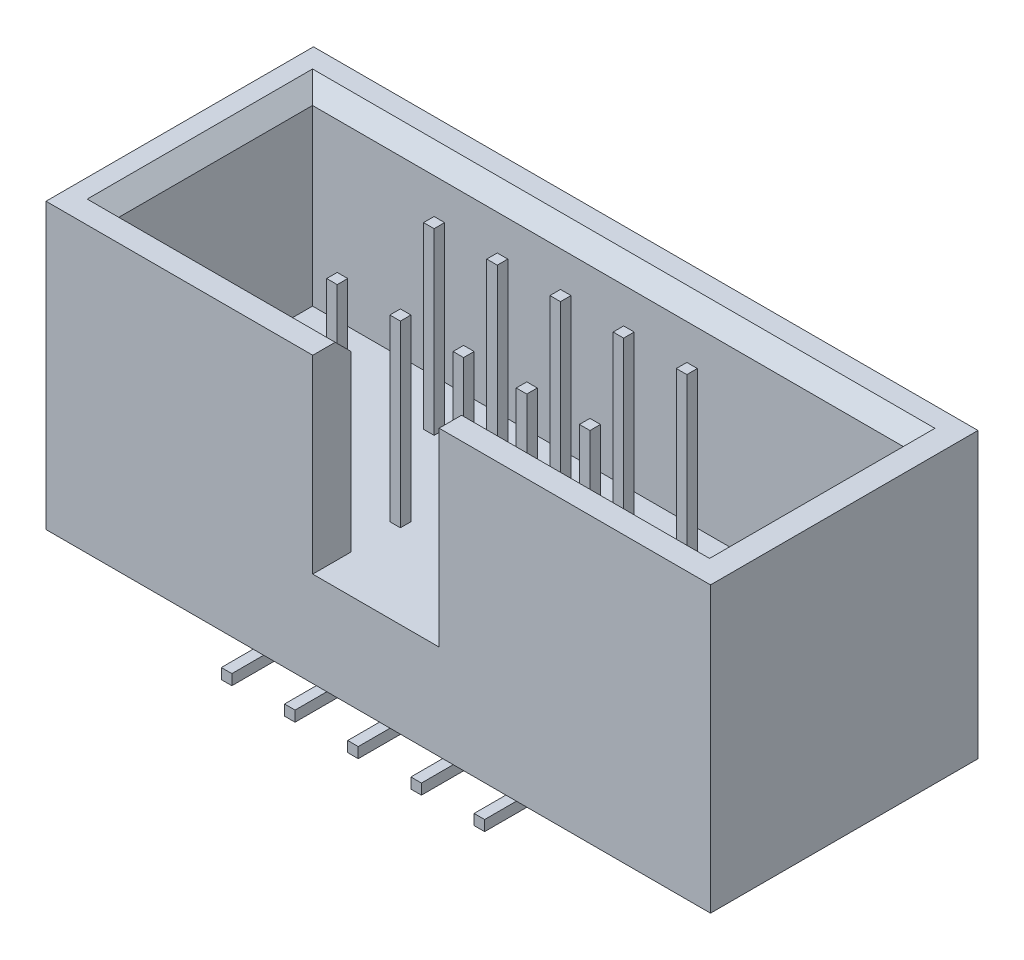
ISO-10303-21;
HEADER;
FILE_DESCRIPTION(('STEP AP214'),'2;1');
FILE_NAME('part.step','',(''),(''),'','','');
FILE_SCHEMA(('AUTOMOTIVE_DESIGN { 1 0 10303 214 1 1 1 1 }'));
ENDSEC;
DATA;
#1=APPLICATION_CONTEXT('core data for automotive mechanical design processes');
#2=APPLICATION_PROTOCOL_DEFINITION('international standard','automotive_design',2000,#1);
#3=PRODUCT_CONTEXT('',#1,'mechanical');
#4=PRODUCT('Part','Part','',(#3));
#5=PRODUCT_RELATED_PRODUCT_CATEGORY('part','',(#4));
#6=PRODUCT_DEFINITION_FORMATION('','',#4);
#7=PRODUCT_DEFINITION_CONTEXT('part definition',#1,'design');
#8=PRODUCT_DEFINITION('design','',#6,#7);
#9=PRODUCT_DEFINITION_SHAPE('','',#8);
#10=(LENGTH_UNIT() NAMED_UNIT(*) SI_UNIT(.MILLI.,.METRE.));
#11=(NAMED_UNIT(*) PLANE_ANGLE_UNIT() SI_UNIT($,.RADIAN.));
#12=(NAMED_UNIT(*) SI_UNIT($,.STERADIAN.) SOLID_ANGLE_UNIT());
#13=UNCERTAINTY_MEASURE_WITH_UNIT(LENGTH_MEASURE(1.E-05),#10,'distance_accuracy_value','');
#14=(GEOMETRIC_REPRESENTATION_CONTEXT(3) GLOBAL_UNCERTAINTY_ASSIGNED_CONTEXT((#13)) GLOBAL_UNIT_ASSIGNED_CONTEXT((#10,
#11,#12)) REPRESENTATION_CONTEXT('',''));
#15=CARTESIAN_POINT('',(0.,0.,0.));
#16=DIRECTION('',(0.,0.,1.));
#17=DIRECTION('',(1.,0.,0.));
#18=AXIS2_PLACEMENT_3D('',#15,#16,#17);
#19=CARTESIAN_POINT('',(-2.57364086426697,5.2,-1.09409593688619));
#20=DIRECTION('',(1.,0.,0.));
#21=DIRECTION('',(0.,0.,-1.));
#22=AXIS2_PLACEMENT_3D('',#19,#20,#21);
#23=PLANE('',#22);
#24=DIRECTION('',(0.,1.,0.));
#25=VECTOR('',#24,1.);
#26=CARTESIAN_POINT('',(-2.57364086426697,5.2,-0.894095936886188));
#27=LINE('',#26,#25);
#28=CARTESIAN_POINT('',(-2.57364086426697,1.8,-0.894095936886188));
#29=VERTEX_POINT('',#28);
#30=CARTESIAN_POINT('',(-2.57364086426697,5.2,-0.894095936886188));
#31=VERTEX_POINT('',#30);
#32=EDGE_CURVE('E1408',#29,#31,#27,.T.);
#33=ORIENTED_EDGE('',*,*,#32,.T.);
#34=DIRECTION('',(0.,0.,-1.));
#35=VECTOR('',#34,1.);
#36=CARTESIAN_POINT('',(-2.57364086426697,5.2,0.));
#37=LINE('',#36,#35);
#38=CARTESIAN_POINT('',(-2.57364086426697,5.2,-1.09409593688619));
#39=VERTEX_POINT('',#38);
#40=EDGE_CURVE('E1397',#31,#39,#37,.T.);
#41=ORIENTED_EDGE('',*,*,#40,.T.);
#42=DIRECTION('',(0.,1.,0.));
#43=VECTOR('',#42,1.);
#44=CARTESIAN_POINT('',(-2.57364086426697,5.2,-1.09409593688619));
#45=LINE('',#44,#43);
#46=CARTESIAN_POINT('',(-2.57364086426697,1.8,-1.09409593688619));
#47=VERTEX_POINT('',#46);
#48=EDGE_CURVE('E1389',#39,#47,#45,.F.);
#49=ORIENTED_EDGE('',*,*,#48,.T.);
#50=DIRECTION('',(0.,0.,-1.));
#51=VECTOR('',#50,1.);
#52=CARTESIAN_POINT('',(-2.57364086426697,1.8,-1.09409593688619));
#53=LINE('',#52,#51);
#54=EDGE_CURVE('E1505',#29,#47,#53,.T.);
#55=ORIENTED_EDGE('',*,*,#54,.F.);
#56=EDGE_LOOP('',(#33,#41,#49,#55));
#57=FACE_BOUND('',#56,.T.);
#58=ADVANCED_FACE('F19',(#57),#23,.F.);
#59=CARTESIAN_POINT('',(-0.173640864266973,5.2,-1.09409593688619));
#60=DIRECTION('',(1.,0.,0.));
#61=DIRECTION('',(0.,0.,-1.));
#62=AXIS2_PLACEMENT_3D('',#59,#60,#61);
#63=PLANE('',#62);
#64=DIRECTION('',(0.,1.,0.));
#65=VECTOR('',#64,1.);
#66=CARTESIAN_POINT('',(-0.173640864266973,5.2,-0.894095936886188));
#67=LINE('',#66,#65);
#68=CARTESIAN_POINT('',(-0.173640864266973,1.8,-0.894095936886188));
#69=VERTEX_POINT('',#68);
#70=CARTESIAN_POINT('',(-0.173640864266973,5.2,-0.894095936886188));
#71=VERTEX_POINT('',#70);
#72=EDGE_CURVE('E1383',#69,#71,#67,.T.);
#73=ORIENTED_EDGE('',*,*,#72,.T.);
#74=DIRECTION('',(0.,0.,-1.));
#75=VECTOR('',#74,1.);
#76=CARTESIAN_POINT('',(-0.173640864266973,5.2,0.));
#77=LINE('',#76,#75);
#78=CARTESIAN_POINT('',(-0.173640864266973,5.2,-1.09409593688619));
#79=VERTEX_POINT('',#78);
#80=EDGE_CURVE('E1372',#71,#79,#77,.T.);
#81=ORIENTED_EDGE('',*,*,#80,.T.);
#82=DIRECTION('',(0.,1.,0.));
#83=VECTOR('',#82,1.);
#84=CARTESIAN_POINT('',(-0.173640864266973,5.2,-1.09409593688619));
#85=LINE('',#84,#83);
#86=CARTESIAN_POINT('',(-0.173640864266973,1.8,-1.09409593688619));
#87=VERTEX_POINT('',#86);
#88=EDGE_CURVE('E1364',#79,#87,#85,.F.);
#89=ORIENTED_EDGE('',*,*,#88,.T.);
#90=DIRECTION('',(0.,0.,-1.));
#91=VECTOR('',#90,1.);
#92=CARTESIAN_POINT('',(-0.173640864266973,1.8,-1.09409593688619));
#93=LINE('',#92,#91);
#94=EDGE_CURVE('E1502',#69,#87,#93,.T.);
#95=ORIENTED_EDGE('',*,*,#94,.F.);
#96=EDGE_LOOP('',(#73,#81,#89,#95));
#97=FACE_BOUND('',#96,.T.);
#98=ADVANCED_FACE('F3496',(#97),#63,.F.);
#99=CARTESIAN_POINT('',(2.22635913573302,5.2,-1.09409593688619));
#100=DIRECTION('',(1.,0.,0.));
#101=DIRECTION('',(0.,0.,-1.));
#102=AXIS2_PLACEMENT_3D('',#99,#100,#101);
#103=PLANE('',#102);
#104=DIRECTION('',(0.,1.,0.));
#105=VECTOR('',#104,1.);
#106=CARTESIAN_POINT('',(2.22635913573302,5.2,-0.894095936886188));
#107=LINE('',#106,#105);
#108=CARTESIAN_POINT('',(2.22635913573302,1.8,-0.894095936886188));
#109=VERTEX_POINT('',#108);
#110=CARTESIAN_POINT('',(2.22635913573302,5.2,-0.894095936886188));
#111=VERTEX_POINT('',#110);
#112=EDGE_CURVE('E1358',#109,#111,#107,.T.);
#113=ORIENTED_EDGE('',*,*,#112,.T.);
#114=DIRECTION('',(0.,0.,-1.));
#115=VECTOR('',#114,1.);
#116=CARTESIAN_POINT('',(2.22635913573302,5.2,0.));
#117=LINE('',#116,#115);
#118=CARTESIAN_POINT('',(2.22635913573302,5.2,-1.09409593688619));
#119=VERTEX_POINT('',#118);
#120=EDGE_CURVE('E1347',#111,#119,#117,.T.);
#121=ORIENTED_EDGE('',*,*,#120,.T.);
#122=DIRECTION('',(0.,1.,0.));
#123=VECTOR('',#122,1.);
#124=CARTESIAN_POINT('',(2.22635913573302,5.2,-1.09409593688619));
#125=LINE('',#124,#123);
#126=CARTESIAN_POINT('',(2.22635913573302,1.8,-1.09409593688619));
#127=VERTEX_POINT('',#126);
#128=EDGE_CURVE('E1339',#119,#127,#125,.F.);
#129=ORIENTED_EDGE('',*,*,#128,.T.);
#130=DIRECTION('',(0.,0.,-1.));
#131=VECTOR('',#130,1.);
#132=CARTESIAN_POINT('',(2.22635913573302,1.8,-1.09409593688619));
#133=LINE('',#132,#131);
#134=EDGE_CURVE('E1499',#109,#127,#133,.T.);
#135=ORIENTED_EDGE('',*,*,#134,.F.);
#136=EDGE_LOOP('',(#113,#121,#129,#135));
#137=FACE_BOUND('',#136,.T.);
#138=ADVANCED_FACE('F3493',(#137),#103,.F.);
#139=CARTESIAN_POINT('',(1.02635913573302,5.2,0.745904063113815));
#140=DIRECTION('',(1.,0.,0.));
#141=DIRECTION('',(0.,0.,-1.));
#142=AXIS2_PLACEMENT_3D('',#139,#140,#141);
#143=PLANE('',#142);
#144=DIRECTION('',(0.,1.,0.));
#145=VECTOR('',#144,1.);
#146=CARTESIAN_POINT('',(1.02635913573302,5.2,0.945904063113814));
#147=LINE('',#146,#145);
#148=CARTESIAN_POINT('',(1.02635913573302,1.8,0.945904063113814));
#149=VERTEX_POINT('',#148);
#150=CARTESIAN_POINT('',(1.02635913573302,5.2,0.945904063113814));
#151=VERTEX_POINT('',#150);
#152=EDGE_CURVE('E1333',#149,#151,#147,.T.);
#153=ORIENTED_EDGE('',*,*,#152,.T.);
#154=DIRECTION('',(0.,0.,-1.));
#155=VECTOR('',#154,1.);
#156=CARTESIAN_POINT('',(1.02635913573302,5.2,0.));
#157=LINE('',#156,#155);
#158=CARTESIAN_POINT('',(1.02635913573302,5.2,0.745904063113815));
#159=VERTEX_POINT('',#158);
#160=EDGE_CURVE('E1322',#151,#159,#157,.T.);
#161=ORIENTED_EDGE('',*,*,#160,.T.);
#162=DIRECTION('',(0.,1.,0.));
#163=VECTOR('',#162,1.);
#164=CARTESIAN_POINT('',(1.02635913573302,5.2,0.745904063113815));
#165=LINE('',#164,#163);
#166=CARTESIAN_POINT('',(1.02635913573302,1.8,0.745904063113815));
#167=VERTEX_POINT('',#166);
#168=EDGE_CURVE('E1314',#159,#167,#165,.F.);
#169=ORIENTED_EDGE('',*,*,#168,.T.);
#170=DIRECTION('',(0.,0.,-1.));
#171=VECTOR('',#170,1.);
#172=CARTESIAN_POINT('',(1.02635913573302,1.8,0.745904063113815));
#173=LINE('',#172,#171);
#174=EDGE_CURVE('E1496',#149,#167,#173,.T.);
#175=ORIENTED_EDGE('',*,*,#174,.F.);
#176=EDGE_LOOP('',(#153,#161,#169,#175));
#177=FACE_BOUND('',#176,.T.);
#178=ADVANCED_FACE('F3489',(#177),#143,.F.);
#179=CARTESIAN_POINT('',(-1.37364086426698,5.2,0.745904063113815));
#180=DIRECTION('',(1.,0.,0.));
#181=DIRECTION('',(0.,0.,-1.));
#182=AXIS2_PLACEMENT_3D('',#179,#180,#181);
#183=PLANE('',#182);
#184=DIRECTION('',(0.,1.,0.));
#185=VECTOR('',#184,1.);
#186=CARTESIAN_POINT('',(-1.37364086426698,5.2,0.945904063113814));
#187=LINE('',#186,#185);
#188=CARTESIAN_POINT('',(-1.37364086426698,1.8,0.945904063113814));
#189=VERTEX_POINT('',#188);
#190=CARTESIAN_POINT('',(-1.37364086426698,5.2,0.945904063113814));
#191=VERTEX_POINT('',#190);
#192=EDGE_CURVE('E1308',#189,#191,#187,.T.);
#193=ORIENTED_EDGE('',*,*,#192,.T.);
#194=DIRECTION('',(0.,0.,-1.));
#195=VECTOR('',#194,1.);
#196=CARTESIAN_POINT('',(-1.37364086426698,5.2,0.));
#197=LINE('',#196,#195);
#198=CARTESIAN_POINT('',(-1.37364086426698,5.2,0.745904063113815));
#199=VERTEX_POINT('',#198);
#200=EDGE_CURVE('E1297',#191,#199,#197,.T.);
#201=ORIENTED_EDGE('',*,*,#200,.T.);
#202=DIRECTION('',(0.,1.,0.));
#203=VECTOR('',#202,1.);
#204=CARTESIAN_POINT('',(-1.37364086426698,5.2,0.745904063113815));
#205=LINE('',#204,#203);
#206=CARTESIAN_POINT('',(-1.37364086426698,1.8,0.745904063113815));
#207=VERTEX_POINT('',#206);
#208=EDGE_CURVE('E1289',#199,#207,#205,.F.);
#209=ORIENTED_EDGE('',*,*,#208,.T.);
#210=DIRECTION('',(0.,0.,-1.));
#211=VECTOR('',#210,1.);
#212=CARTESIAN_POINT('',(-1.37364086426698,1.8,0.745904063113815));
#213=LINE('',#212,#211);
#214=EDGE_CURVE('E1493',#189,#207,#213,.T.);
#215=ORIENTED_EDGE('',*,*,#214,.F.);
#216=EDGE_LOOP('',(#193,#201,#209,#215));
#217=FACE_BOUND('',#216,.T.);
#218=ADVANCED_FACE('F3485',(#217),#183,.F.);
#219=CARTESIAN_POINT('',(-0.173640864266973,5.2,0.745904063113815));
#220=DIRECTION('',(1.,0.,0.));
#221=DIRECTION('',(0.,0.,-1.));
#222=AXIS2_PLACEMENT_3D('',#219,#220,#221);
#223=PLANE('',#222);
#224=DIRECTION('',(0.,1.,0.));
#225=VECTOR('',#224,1.);
#226=CARTESIAN_POINT('',(-0.173640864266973,5.2,0.945904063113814));
#227=LINE('',#226,#225);
#228=CARTESIAN_POINT('',(-0.173640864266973,1.8,0.945904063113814));
#229=VERTEX_POINT('',#228);
#230=CARTESIAN_POINT('',(-0.173640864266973,5.2,0.945904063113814));
#231=VERTEX_POINT('',#230);
#232=EDGE_CURVE('E1283',#229,#231,#227,.T.);
#233=ORIENTED_EDGE('',*,*,#232,.T.);
#234=DIRECTION('',(0.,0.,-1.));
#235=VECTOR('',#234,1.);
#236=CARTESIAN_POINT('',(-0.173640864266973,5.2,0.));
#237=LINE('',#236,#235);
#238=CARTESIAN_POINT('',(-0.173640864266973,5.2,0.745904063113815));
#239=VERTEX_POINT('',#238);
#240=EDGE_CURVE('E1272',#231,#239,#237,.T.);
#241=ORIENTED_EDGE('',*,*,#240,.T.);
#242=DIRECTION('',(0.,1.,0.));
#243=VECTOR('',#242,1.);
#244=CARTESIAN_POINT('',(-0.173640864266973,5.2,0.745904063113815));
#245=LINE('',#244,#243);
#246=CARTESIAN_POINT('',(-0.173640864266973,1.8,0.745904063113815));
#247=VERTEX_POINT('',#246);
#248=EDGE_CURVE('E1264',#239,#247,#245,.F.);
#249=ORIENTED_EDGE('',*,*,#248,.T.);
#250=DIRECTION('',(0.,0.,-1.));
#251=VECTOR('',#250,1.);
#252=CARTESIAN_POINT('',(-0.173640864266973,1.8,0.745904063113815));
#253=LINE('',#252,#251);
#254=EDGE_CURVE('E1490',#229,#247,#253,.T.);
#255=ORIENTED_EDGE('',*,*,#254,.F.);
#256=EDGE_LOOP('',(#233,#241,#249,#255));
#257=FACE_BOUND('',#256,.T.);
#258=ADVANCED_FACE('F3481',(#257),#223,.F.);
#259=CARTESIAN_POINT('',(2.22635913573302,5.2,0.745904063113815));
#260=DIRECTION('',(1.,0.,0.));
#261=DIRECTION('',(0.,0.,-1.));
#262=AXIS2_PLACEMENT_3D('',#259,#260,#261);
#263=PLANE('',#262);
#264=DIRECTION('',(0.,1.,0.));
#265=VECTOR('',#264,1.);
#266=CARTESIAN_POINT('',(2.22635913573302,5.2,0.945904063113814));
#267=LINE('',#266,#265);
#268=CARTESIAN_POINT('',(2.22635913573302,1.8,0.945904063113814));
#269=VERTEX_POINT('',#268);
#270=CARTESIAN_POINT('',(2.22635913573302,5.2,0.945904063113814));
#271=VERTEX_POINT('',#270);
#272=EDGE_CURVE('E1258',#269,#271,#267,.T.);
#273=ORIENTED_EDGE('',*,*,#272,.T.);
#274=DIRECTION('',(0.,0.,-1.));
#275=VECTOR('',#274,1.);
#276=CARTESIAN_POINT('',(2.22635913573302,5.2,0.));
#277=LINE('',#276,#275);
#278=CARTESIAN_POINT('',(2.22635913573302,5.2,0.745904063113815));
#279=VERTEX_POINT('',#278);
#280=EDGE_CURVE('E1247',#271,#279,#277,.T.);
#281=ORIENTED_EDGE('',*,*,#280,.T.);
#282=DIRECTION('',(0.,1.,0.));
#283=VECTOR('',#282,1.);
#284=CARTESIAN_POINT('',(2.22635913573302,5.2,0.745904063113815));
#285=LINE('',#284,#283);
#286=CARTESIAN_POINT('',(2.22635913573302,1.8,0.745904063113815));
#287=VERTEX_POINT('',#286);
#288=EDGE_CURVE('E1239',#279,#287,#285,.F.);
#289=ORIENTED_EDGE('',*,*,#288,.T.);
#290=DIRECTION('',(0.,0.,-1.));
#291=VECTOR('',#290,1.);
#292=CARTESIAN_POINT('',(2.22635913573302,1.8,0.745904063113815));
#293=LINE('',#292,#291);
#294=EDGE_CURVE('E1487',#269,#287,#293,.T.);
#295=ORIENTED_EDGE('',*,*,#294,.F.);
#296=EDGE_LOOP('',(#273,#281,#289,#295));
#297=FACE_BOUND('',#296,.T.);
#298=ADVANCED_FACE('F3477',(#297),#263,.F.);
#299=CARTESIAN_POINT('',(1.02635913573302,5.2,-1.09409593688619));
#300=DIRECTION('',(1.,0.,0.));
#301=DIRECTION('',(0.,0.,-1.));
#302=AXIS2_PLACEMENT_3D('',#299,#300,#301);
#303=PLANE('',#302);
#304=DIRECTION('',(0.,1.,0.));
#305=VECTOR('',#304,1.);
#306=CARTESIAN_POINT('',(1.02635913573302,5.2,-0.894095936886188));
#307=LINE('',#306,#305);
#308=CARTESIAN_POINT('',(1.02635913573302,1.8,-0.894095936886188));
#309=VERTEX_POINT('',#308);
#310=CARTESIAN_POINT('',(1.02635913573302,5.2,-0.894095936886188));
#311=VERTEX_POINT('',#310);
#312=EDGE_CURVE('E1233',#309,#311,#307,.T.);
#313=ORIENTED_EDGE('',*,*,#312,.T.);
#314=DIRECTION('',(0.,0.,-1.));
#315=VECTOR('',#314,1.);
#316=CARTESIAN_POINT('',(1.02635913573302,5.2,0.));
#317=LINE('',#316,#315);
#318=CARTESIAN_POINT('',(1.02635913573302,5.2,-1.09409593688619));
#319=VERTEX_POINT('',#318);
#320=EDGE_CURVE('E1222',#311,#319,#317,.T.);
#321=ORIENTED_EDGE('',*,*,#320,.T.);
#322=DIRECTION('',(0.,1.,0.));
#323=VECTOR('',#322,1.);
#324=CARTESIAN_POINT('',(1.02635913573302,5.2,-1.09409593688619));
#325=LINE('',#324,#323);
#326=CARTESIAN_POINT('',(1.02635913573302,1.8,-1.09409593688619));
#327=VERTEX_POINT('',#326);
#328=EDGE_CURVE('E1214',#319,#327,#325,.F.);
#329=ORIENTED_EDGE('',*,*,#328,.T.);
#330=DIRECTION('',(0.,0.,-1.));
#331=VECTOR('',#330,1.);
#332=CARTESIAN_POINT('',(1.02635913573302,1.8,-1.09409593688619));
#333=LINE('',#332,#331);
#334=EDGE_CURVE('E1484',#309,#327,#333,.T.);
#335=ORIENTED_EDGE('',*,*,#334,.F.);
#336=EDGE_LOOP('',(#313,#321,#329,#335));
#337=FACE_BOUND('',#336,.T.);
#338=ADVANCED_FACE('F3473',(#337),#303,.F.);
#339=CARTESIAN_POINT('',(-1.37364086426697,5.2,-1.09409593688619));
#340=DIRECTION('',(1.,0.,0.));
#341=DIRECTION('',(0.,0.,-1.));
#342=AXIS2_PLACEMENT_3D('',#339,#340,#341);
#343=PLANE('',#342);
#344=DIRECTION('',(0.,1.,0.));
#345=VECTOR('',#344,1.);
#346=CARTESIAN_POINT('',(-1.37364086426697,5.2,-0.894095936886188));
#347=LINE('',#346,#345);
#348=CARTESIAN_POINT('',(-1.37364086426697,1.8,-0.894095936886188));
#349=VERTEX_POINT('',#348);
#350=CARTESIAN_POINT('',(-1.37364086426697,5.2,-0.894095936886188));
#351=VERTEX_POINT('',#350);
#352=EDGE_CURVE('E1208',#349,#351,#347,.T.);
#353=ORIENTED_EDGE('',*,*,#352,.T.);
#354=DIRECTION('',(0.,0.,-1.));
#355=VECTOR('',#354,1.);
#356=CARTESIAN_POINT('',(-1.37364086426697,5.2,0.));
#357=LINE('',#356,#355);
#358=CARTESIAN_POINT('',(-1.37364086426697,5.2,-1.09409593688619));
#359=VERTEX_POINT('',#358);
#360=EDGE_CURVE('E1197',#351,#359,#357,.T.);
#361=ORIENTED_EDGE('',*,*,#360,.T.);
#362=DIRECTION('',(0.,1.,0.));
#363=VECTOR('',#362,1.);
#364=CARTESIAN_POINT('',(-1.37364086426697,5.2,-1.09409593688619));
#365=LINE('',#364,#363);
#366=CARTESIAN_POINT('',(-1.37364086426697,1.8,-1.09409593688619));
#367=VERTEX_POINT('',#366);
#368=EDGE_CURVE('E1189',#359,#367,#365,.F.);
#369=ORIENTED_EDGE('',*,*,#368,.T.);
#370=DIRECTION('',(0.,0.,-1.));
#371=VECTOR('',#370,1.);
#372=CARTESIAN_POINT('',(-1.37364086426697,1.8,-1.09409593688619));
#373=LINE('',#372,#371);
#374=EDGE_CURVE('E1481',#349,#367,#373,.T.);
#375=ORIENTED_EDGE('',*,*,#374,.F.);
#376=EDGE_LOOP('',(#353,#361,#369,#375));
#377=FACE_BOUND('',#376,.T.);
#378=ADVANCED_FACE('F3469',(#377),#343,.F.);
#379=CARTESIAN_POINT('',(-2.37364086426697,5.2,0.945904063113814));
#380=DIRECTION('',(0.,0.,-1.));
#381=DIRECTION('',(-1.,0.,0.));
#382=AXIS2_PLACEMENT_3D('',#379,#380,#381);
#383=PLANE('',#382);
#384=DIRECTION('',(0.,1.,0.));
#385=VECTOR('',#384,1.);
#386=CARTESIAN_POINT('',(-2.37364086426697,5.2,0.945904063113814));
#387=LINE('',#386,#385);
#388=CARTESIAN_POINT('',(-2.37364086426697,1.8,0.945904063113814));
#389=VERTEX_POINT('',#388);
#390=CARTESIAN_POINT('',(-2.37364086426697,5.2,0.945904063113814));
#391=VERTEX_POINT('',#390);
#392=EDGE_CURVE('E1182',#389,#391,#387,.T.);
#393=ORIENTED_EDGE('',*,*,#392,.T.);
#394=DIRECTION('',(1.,0.,0.));
#395=VECTOR('',#394,1.);
#396=CARTESIAN_POINT('',(0.,5.2,0.945904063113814));
#397=LINE('',#396,#395);
#398=CARTESIAN_POINT('',(-2.57364086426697,5.2,0.945904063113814));
#399=VERTEX_POINT('',#398);
#400=EDGE_CURVE('E1175',#399,#391,#397,.T.);
#401=ORIENTED_EDGE('',*,*,#400,.F.);
#402=DIRECTION('',(0.,1.,0.));
#403=VECTOR('',#402,1.);
#404=CARTESIAN_POINT('',(-2.57364086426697,5.2,0.945904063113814));
#405=LINE('',#404,#403);
#406=CARTESIAN_POINT('',(-2.57364086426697,1.8,0.945904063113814));
#407=VERTEX_POINT('',#406);
#408=EDGE_CURVE('E1164',#399,#407,#405,.F.);
#409=ORIENTED_EDGE('',*,*,#408,.T.);
#410=DIRECTION('',(-1.,0.,0.));
#411=VECTOR('',#410,1.);
#412=CARTESIAN_POINT('',(-2.37364086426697,1.8,0.945904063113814));
#413=LINE('',#412,#411);
#414=EDGE_CURVE('E1411',#389,#407,#413,.T.);
#415=ORIENTED_EDGE('',*,*,#414,.F.);
#416=EDGE_LOOP('',(#393,#401,#409,#415));
#417=FACE_BOUND('',#416,.T.);
#418=ADVANCED_FACE('F3465',(#417),#383,.F.);
#419=CARTESIAN_POINT('',(-2.37364086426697,5.2,-0.894095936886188));
#420=DIRECTION('',(0.,0.,-1.));
#421=DIRECTION('',(-1.,0.,0.));
#422=AXIS2_PLACEMENT_3D('',#419,#420,#421);
#423=PLANE('',#422);
#424=DIRECTION('',(0.,1.,0.));
#425=VECTOR('',#424,1.);
#426=CARTESIAN_POINT('',(-2.37364086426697,5.2,-0.894095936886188));
#427=LINE('',#426,#425);
#428=CARTESIAN_POINT('',(-2.37364086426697,1.8,-0.894095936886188));
#429=VERTEX_POINT('',#428);
#430=CARTESIAN_POINT('',(-2.37364086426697,5.2,-0.894095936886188));
#431=VERTEX_POINT('',#430);
#432=EDGE_CURVE('E1661',#429,#431,#427,.T.);
#433=ORIENTED_EDGE('',*,*,#432,.T.);
#434=DIRECTION('',(1.,0.,0.));
#435=VECTOR('',#434,1.);
#436=CARTESIAN_POINT('',(0.,5.2,-0.894095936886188));
#437=LINE('',#436,#435);
#438=EDGE_CURVE('E1400',#431,#31,#437,.F.);
#439=ORIENTED_EDGE('',*,*,#438,.T.);
#440=ORIENTED_EDGE('',*,*,#32,.F.);
#441=DIRECTION('',(-1.,0.,0.));
#442=VECTOR('',#441,1.);
#443=CARTESIAN_POINT('',(-2.37364086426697,1.8,-0.894095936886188));
#444=LINE('',#443,#442);
#445=EDGE_CURVE('E1404',#429,#29,#444,.T.);
#446=ORIENTED_EDGE('',*,*,#445,.F.);
#447=EDGE_LOOP('',(#433,#439,#440,#446));
#448=FACE_BOUND('',#447,.T.);
#449=ADVANCED_FACE('F3461',(#448),#423,.F.);
#450=CARTESIAN_POINT('',(0.,5.2,0.));
#451=DIRECTION('',(0.,-1.,0.));
#452=DIRECTION('',(0.,0.,-1.));
#453=AXIS2_PLACEMENT_3D('',#450,#451,#452);
#454=PLANE('',#453);
#455=DIRECTION('',(1.,0.,0.));
#456=VECTOR('',#455,1.);
#457=CARTESIAN_POINT('',(-2.37364086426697,5.2,-1.09409593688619));
#458=LINE('',#457,#456);
#459=CARTESIAN_POINT('',(-2.37364086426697,5.2,-1.09409593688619));
#460=VERTEX_POINT('',#459);
#461=EDGE_CURVE('E1393',#460,#39,#458,.F.);
#462=ORIENTED_EDGE('',*,*,#461,.T.);
#463=ORIENTED_EDGE('',*,*,#40,.F.);
#464=ORIENTED_EDGE('',*,*,#438,.F.);
#465=DIRECTION('',(0.,0.,1.));
#466=VECTOR('',#465,1.);
#467=CARTESIAN_POINT('',(-2.37364086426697,5.2,-1.09409593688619));
#468=LINE('',#467,#466);
#469=EDGE_CURVE('E1884',#431,#460,#468,.F.);
#470=ORIENTED_EDGE('',*,*,#469,.T.);
#471=EDGE_LOOP('',(#462,#463,#464,#470));
#472=FACE_BOUND('',#471,.T.);
#473=ADVANCED_FACE('F3457',(#472),#454,.F.);
#474=CARTESIAN_POINT('',(-2.37364086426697,5.2,-1.09409593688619));
#475=DIRECTION('',(0.,0.,1.));
#476=DIRECTION('',(1.,0.,0.));
#477=AXIS2_PLACEMENT_3D('',#474,#475,#476);
#478=PLANE('',#477);
#479=ORIENTED_EDGE('',*,*,#48,.F.);
#480=ORIENTED_EDGE('',*,*,#461,.F.);
#481=DIRECTION('',(0.,1.,0.));
#482=VECTOR('',#481,1.);
#483=CARTESIAN_POINT('',(-2.37364086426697,5.2,-1.09409593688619));
#484=LINE('',#483,#482);
#485=CARTESIAN_POINT('',(-2.37364086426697,1.8,-1.09409593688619));
#486=VERTEX_POINT('',#485);
#487=EDGE_CURVE('E1880',#460,#486,#484,.F.);
#488=ORIENTED_EDGE('',*,*,#487,.T.);
#489=DIRECTION('',(1.,0.,0.));
#490=VECTOR('',#489,1.);
#491=CARTESIAN_POINT('',(-2.37364086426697,1.8,-1.09409593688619));
#492=LINE('',#491,#490);
#493=EDGE_CURVE('E1386',#47,#486,#492,.T.);
#494=ORIENTED_EDGE('',*,*,#493,.F.);
#495=EDGE_LOOP('',(#479,#480,#488,#494));
#496=FACE_BOUND('',#495,.T.);
#497=ADVANCED_FACE('F3453',(#496),#478,.F.);
#498=CARTESIAN_POINT('',(0.0263591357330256,5.2,-0.894095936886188));
#499=DIRECTION('',(0.,0.,-1.));
#500=DIRECTION('',(-1.,0.,0.));
#501=AXIS2_PLACEMENT_3D('',#498,#499,#500);
#502=PLANE('',#501);
#503=DIRECTION('',(0.,1.,0.));
#504=VECTOR('',#503,1.);
#505=CARTESIAN_POINT('',(0.0263591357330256,5.2,-0.894095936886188));
#506=LINE('',#505,#504);
#507=CARTESIAN_POINT('',(0.0263591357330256,1.8,-0.894095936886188));
#508=VERTEX_POINT('',#507);
#509=CARTESIAN_POINT('',(0.0263591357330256,5.2,-0.894095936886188));
#510=VERTEX_POINT('',#509);
#511=EDGE_CURVE('E1876',#508,#510,#506,.T.);
#512=ORIENTED_EDGE('',*,*,#511,.T.);
#513=DIRECTION('',(1.,0.,0.));
#514=VECTOR('',#513,1.);
#515=CARTESIAN_POINT('',(0.,5.2,-0.894095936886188));
#516=LINE('',#515,#514);
#517=EDGE_CURVE('E1375',#510,#71,#516,.F.);
#518=ORIENTED_EDGE('',*,*,#517,.T.);
#519=ORIENTED_EDGE('',*,*,#72,.F.);
#520=DIRECTION('',(-1.,0.,0.));
#521=VECTOR('',#520,1.);
#522=CARTESIAN_POINT('',(0.0263591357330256,1.8,-0.894095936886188));
#523=LINE('',#522,#521);
#524=EDGE_CURVE('E1379',#508,#69,#523,.T.);
#525=ORIENTED_EDGE('',*,*,#524,.F.);
#526=EDGE_LOOP('',(#512,#518,#519,#525));
#527=FACE_BOUND('',#526,.T.);
#528=ADVANCED_FACE('F3449',(#527),#502,.F.);
#529=CARTESIAN_POINT('',(0.,5.2,0.));
#530=DIRECTION('',(0.,-1.,0.));
#531=DIRECTION('',(0.,0.,-1.));
#532=AXIS2_PLACEMENT_3D('',#529,#530,#531);
#533=PLANE('',#532);
#534=DIRECTION('',(1.,0.,0.));
#535=VECTOR('',#534,1.);
#536=CARTESIAN_POINT('',(0.0263591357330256,5.2,-1.09409593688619));
#537=LINE('',#536,#535);
#538=CARTESIAN_POINT('',(0.0263591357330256,5.2,-1.09409593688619));
#539=VERTEX_POINT('',#538);
#540=EDGE_CURVE('E1368',#539,#79,#537,.F.);
#541=ORIENTED_EDGE('',*,*,#540,.T.);
#542=ORIENTED_EDGE('',*,*,#80,.F.);
#543=ORIENTED_EDGE('',*,*,#517,.F.);
#544=DIRECTION('',(0.,0.,1.));
#545=VECTOR('',#544,1.);
#546=CARTESIAN_POINT('',(0.0263591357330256,5.2,-1.09409593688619));
#547=LINE('',#546,#545);
#548=EDGE_CURVE('E1872',#510,#539,#547,.F.);
#549=ORIENTED_EDGE('',*,*,#548,.T.);
#550=EDGE_LOOP('',(#541,#542,#543,#549));
#551=FACE_BOUND('',#550,.T.);
#552=ADVANCED_FACE('F3445',(#551),#533,.F.);
#553=CARTESIAN_POINT('',(0.0263591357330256,5.2,-1.09409593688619));
#554=DIRECTION('',(0.,0.,1.));
#555=DIRECTION('',(1.,0.,0.));
#556=AXIS2_PLACEMENT_3D('',#553,#554,#555);
#557=PLANE('',#556);
#558=ORIENTED_EDGE('',*,*,#88,.F.);
#559=ORIENTED_EDGE('',*,*,#540,.F.);
#560=DIRECTION('',(0.,1.,0.));
#561=VECTOR('',#560,1.);
#562=CARTESIAN_POINT('',(0.0263591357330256,5.2,-1.09409593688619));
#563=LINE('',#562,#561);
#564=CARTESIAN_POINT('',(0.0263591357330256,1.8,-1.09409593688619));
#565=VERTEX_POINT('',#564);
#566=EDGE_CURVE('E1868',#539,#565,#563,.F.);
#567=ORIENTED_EDGE('',*,*,#566,.T.);
#568=DIRECTION('',(1.,0.,0.));
#569=VECTOR('',#568,1.);
#570=CARTESIAN_POINT('',(0.0263591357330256,1.8,-1.09409593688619));
#571=LINE('',#570,#569);
#572=EDGE_CURVE('E1361',#87,#565,#571,.T.);
#573=ORIENTED_EDGE('',*,*,#572,.F.);
#574=EDGE_LOOP('',(#558,#559,#567,#573));
#575=FACE_BOUND('',#574,.T.);
#576=ADVANCED_FACE('F3441',(#575),#557,.F.);
#577=CARTESIAN_POINT('',(2.42635913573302,5.2,-0.894095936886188));
#578=DIRECTION('',(0.,0.,-1.));
#579=DIRECTION('',(-1.,0.,0.));
#580=AXIS2_PLACEMENT_3D('',#577,#578,#579);
#581=PLANE('',#580);
#582=DIRECTION('',(0.,1.,0.));
#583=VECTOR('',#582,1.);
#584=CARTESIAN_POINT('',(2.42635913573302,5.2,-0.894095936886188));
#585=LINE('',#584,#583);
#586=CARTESIAN_POINT('',(2.42635913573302,1.8,-0.894095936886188));
#587=VERTEX_POINT('',#586);
#588=CARTESIAN_POINT('',(2.42635913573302,5.2,-0.894095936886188));
#589=VERTEX_POINT('',#588);
#590=EDGE_CURVE('E1864',#587,#589,#585,.T.);
#591=ORIENTED_EDGE('',*,*,#590,.T.);
#592=DIRECTION('',(1.,0.,0.));
#593=VECTOR('',#592,1.);
#594=CARTESIAN_POINT('',(0.,5.2,-0.894095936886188));
#595=LINE('',#594,#593);
#596=EDGE_CURVE('E1350',#589,#111,#595,.F.);
#597=ORIENTED_EDGE('',*,*,#596,.T.);
#598=ORIENTED_EDGE('',*,*,#112,.F.);
#599=DIRECTION('',(-1.,0.,0.));
#600=VECTOR('',#599,1.);
#601=CARTESIAN_POINT('',(2.42635913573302,1.8,-0.894095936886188));
#602=LINE('',#601,#600);
#603=EDGE_CURVE('E1354',#587,#109,#602,.T.);
#604=ORIENTED_EDGE('',*,*,#603,.F.);
#605=EDGE_LOOP('',(#591,#597,#598,#604));
#606=FACE_BOUND('',#605,.T.);
#607=ADVANCED_FACE('F3437',(#606),#581,.F.);
#608=CARTESIAN_POINT('',(0.,5.2,0.));
#609=DIRECTION('',(0.,-1.,0.));
#610=DIRECTION('',(0.,0.,-1.));
#611=AXIS2_PLACEMENT_3D('',#608,#609,#610);
#612=PLANE('',#611);
#613=DIRECTION('',(1.,0.,0.));
#614=VECTOR('',#613,1.);
#615=CARTESIAN_POINT('',(2.42635913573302,5.2,-1.09409593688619));
#616=LINE('',#615,#614);
#617=CARTESIAN_POINT('',(2.42635913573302,5.2,-1.09409593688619));
#618=VERTEX_POINT('',#617);
#619=EDGE_CURVE('E1343',#618,#119,#616,.F.);
#620=ORIENTED_EDGE('',*,*,#619,.T.);
#621=ORIENTED_EDGE('',*,*,#120,.F.);
#622=ORIENTED_EDGE('',*,*,#596,.F.);
#623=DIRECTION('',(0.,0.,1.));
#624=VECTOR('',#623,1.);
#625=CARTESIAN_POINT('',(2.42635913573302,5.2,-1.09409593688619));
#626=LINE('',#625,#624);
#627=EDGE_CURVE('E1860',#589,#618,#626,.F.);
#628=ORIENTED_EDGE('',*,*,#627,.T.);
#629=EDGE_LOOP('',(#620,#621,#622,#628));
#630=FACE_BOUND('',#629,.T.);
#631=ADVANCED_FACE('F3433',(#630),#612,.F.);
#632=CARTESIAN_POINT('',(2.42635913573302,5.2,-1.09409593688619));
#633=DIRECTION('',(0.,0.,1.));
#634=DIRECTION('',(1.,0.,0.));
#635=AXIS2_PLACEMENT_3D('',#632,#633,#634);
#636=PLANE('',#635);
#637=ORIENTED_EDGE('',*,*,#128,.F.);
#638=ORIENTED_EDGE('',*,*,#619,.F.);
#639=DIRECTION('',(0.,1.,0.));
#640=VECTOR('',#639,1.);
#641=CARTESIAN_POINT('',(2.42635913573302,5.2,-1.09409593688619));
#642=LINE('',#641,#640);
#643=CARTESIAN_POINT('',(2.42635913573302,1.8,-1.09409593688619));
#644=VERTEX_POINT('',#643);
#645=EDGE_CURVE('E1856',#618,#644,#642,.F.);
#646=ORIENTED_EDGE('',*,*,#645,.T.);
#647=DIRECTION('',(1.,0.,0.));
#648=VECTOR('',#647,1.);
#649=CARTESIAN_POINT('',(2.42635913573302,1.8,-1.09409593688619));
#650=LINE('',#649,#648);
#651=EDGE_CURVE('E1336',#127,#644,#650,.T.);
#652=ORIENTED_EDGE('',*,*,#651,.F.);
#653=EDGE_LOOP('',(#637,#638,#646,#652));
#654=FACE_BOUND('',#653,.T.);
#655=ADVANCED_FACE('F3429',(#654),#636,.F.);
#656=CARTESIAN_POINT('',(1.22635913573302,5.2,0.945904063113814));
#657=DIRECTION('',(0.,0.,-1.));
#658=DIRECTION('',(-1.,0.,0.));
#659=AXIS2_PLACEMENT_3D('',#656,#657,#658);
#660=PLANE('',#659);
#661=DIRECTION('',(0.,1.,0.));
#662=VECTOR('',#661,1.);
#663=CARTESIAN_POINT('',(1.22635913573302,5.2,0.945904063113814));
#664=LINE('',#663,#662);
#665=CARTESIAN_POINT('',(1.22635913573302,1.8,0.945904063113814));
#666=VERTEX_POINT('',#665);
#667=CARTESIAN_POINT('',(1.22635913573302,5.2,0.945904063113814));
#668=VERTEX_POINT('',#667);
#669=EDGE_CURVE('E1852',#666,#668,#664,.T.);
#670=ORIENTED_EDGE('',*,*,#669,.T.);
#671=DIRECTION('',(1.,0.,0.));
#672=VECTOR('',#671,1.);
#673=CARTESIAN_POINT('',(0.,5.2,0.945904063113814));
#674=LINE('',#673,#672);
#675=EDGE_CURVE('E1325',#668,#151,#674,.F.);
#676=ORIENTED_EDGE('',*,*,#675,.T.);
#677=ORIENTED_EDGE('',*,*,#152,.F.);
#678=DIRECTION('',(-1.,0.,0.));
#679=VECTOR('',#678,1.);
#680=CARTESIAN_POINT('',(1.22635913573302,1.8,0.945904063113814));
#681=LINE('',#680,#679);
#682=EDGE_CURVE('E1329',#666,#149,#681,.T.);
#683=ORIENTED_EDGE('',*,*,#682,.F.);
#684=EDGE_LOOP('',(#670,#676,#677,#683));
#685=FACE_BOUND('',#684,.T.);
#686=ADVANCED_FACE('F3425',(#685),#660,.F.);
#687=CARTESIAN_POINT('',(0.,5.2,0.));
#688=DIRECTION('',(0.,-1.,0.));
#689=DIRECTION('',(0.,0.,-1.));
#690=AXIS2_PLACEMENT_3D('',#687,#688,#689);
#691=PLANE('',#690);
#692=DIRECTION('',(1.,0.,0.));
#693=VECTOR('',#692,1.);
#694=CARTESIAN_POINT('',(1.22635913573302,5.2,0.745904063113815));
#695=LINE('',#694,#693);
#696=CARTESIAN_POINT('',(1.22635913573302,5.2,0.745904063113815));
#697=VERTEX_POINT('',#696);
#698=EDGE_CURVE('E1318',#697,#159,#695,.F.);
#699=ORIENTED_EDGE('',*,*,#698,.T.);
#700=ORIENTED_EDGE('',*,*,#160,.F.);
#701=ORIENTED_EDGE('',*,*,#675,.F.);
#702=DIRECTION('',(0.,0.,1.));
#703=VECTOR('',#702,1.);
#704=CARTESIAN_POINT('',(1.22635913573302,5.2,0.745904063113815));
#705=LINE('',#704,#703);
#706=EDGE_CURVE('E1848',#668,#697,#705,.F.);
#707=ORIENTED_EDGE('',*,*,#706,.T.);
#708=EDGE_LOOP('',(#699,#700,#701,#707));
#709=FACE_BOUND('',#708,.T.);
#710=ADVANCED_FACE('F3421',(#709),#691,.F.);
#711=CARTESIAN_POINT('',(1.22635913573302,5.2,0.745904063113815));
#712=DIRECTION('',(0.,0.,1.));
#713=DIRECTION('',(1.,0.,0.));
#714=AXIS2_PLACEMENT_3D('',#711,#712,#713);
#715=PLANE('',#714);
#716=ORIENTED_EDGE('',*,*,#168,.F.);
#717=ORIENTED_EDGE('',*,*,#698,.F.);
#718=DIRECTION('',(0.,1.,0.));
#719=VECTOR('',#718,1.);
#720=CARTESIAN_POINT('',(1.22635913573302,5.2,0.745904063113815));
#721=LINE('',#720,#719);
#722=CARTESIAN_POINT('',(1.22635913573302,1.8,0.745904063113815));
#723=VERTEX_POINT('',#722);
#724=EDGE_CURVE('E1844',#697,#723,#721,.F.);
#725=ORIENTED_EDGE('',*,*,#724,.T.);
#726=DIRECTION('',(1.,0.,0.));
#727=VECTOR('',#726,1.);
#728=CARTESIAN_POINT('',(1.22635913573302,1.8,0.745904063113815));
#729=LINE('',#728,#727);
#730=EDGE_CURVE('E1311',#167,#723,#729,.T.);
#731=ORIENTED_EDGE('',*,*,#730,.F.);
#732=EDGE_LOOP('',(#716,#717,#725,#731));
#733=FACE_BOUND('',#732,.T.);
#734=ADVANCED_FACE('F3417',(#733),#715,.F.);
#735=CARTESIAN_POINT('',(-1.17364086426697,5.2,0.945904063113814));
#736=DIRECTION('',(0.,0.,-1.));
#737=DIRECTION('',(-1.,0.,0.));
#738=AXIS2_PLACEMENT_3D('',#735,#736,#737);
#739=PLANE('',#738);
#740=DIRECTION('',(0.,1.,0.));
#741=VECTOR('',#740,1.);
#742=CARTESIAN_POINT('',(-1.17364086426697,5.2,0.945904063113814));
#743=LINE('',#742,#741);
#744=CARTESIAN_POINT('',(-1.17364086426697,1.8,0.945904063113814));
#745=VERTEX_POINT('',#744);
#746=CARTESIAN_POINT('',(-1.17364086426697,5.2,0.945904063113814));
#747=VERTEX_POINT('',#746);
#748=EDGE_CURVE('E1840',#745,#747,#743,.T.);
#749=ORIENTED_EDGE('',*,*,#748,.T.);
#750=DIRECTION('',(1.,0.,0.));
#751=VECTOR('',#750,1.);
#752=CARTESIAN_POINT('',(0.,5.2,0.945904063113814));
#753=LINE('',#752,#751);
#754=EDGE_CURVE('E1300',#747,#191,#753,.F.);
#755=ORIENTED_EDGE('',*,*,#754,.T.);
#756=ORIENTED_EDGE('',*,*,#192,.F.);
#757=DIRECTION('',(-1.,0.,0.));
#758=VECTOR('',#757,1.);
#759=CARTESIAN_POINT('',(-1.17364086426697,1.8,0.945904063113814));
#760=LINE('',#759,#758);
#761=EDGE_CURVE('E1304',#745,#189,#760,.T.);
#762=ORIENTED_EDGE('',*,*,#761,.F.);
#763=EDGE_LOOP('',(#749,#755,#756,#762));
#764=FACE_BOUND('',#763,.T.);
#765=ADVANCED_FACE('F3413',(#764),#739,.F.);
#766=CARTESIAN_POINT('',(0.,5.2,0.));
#767=DIRECTION('',(0.,-1.,0.));
#768=DIRECTION('',(0.,0.,-1.));
#769=AXIS2_PLACEMENT_3D('',#766,#767,#768);
#770=PLANE('',#769);
#771=DIRECTION('',(1.,0.,0.));
#772=VECTOR('',#771,1.);
#773=CARTESIAN_POINT('',(-1.17364086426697,5.2,0.745904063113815));
#774=LINE('',#773,#772);
#775=CARTESIAN_POINT('',(-1.17364086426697,5.2,0.745904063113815));
#776=VERTEX_POINT('',#775);
#777=EDGE_CURVE('E1293',#776,#199,#774,.F.);
#778=ORIENTED_EDGE('',*,*,#777,.T.);
#779=ORIENTED_EDGE('',*,*,#200,.F.);
#780=ORIENTED_EDGE('',*,*,#754,.F.);
#781=DIRECTION('',(0.,0.,1.));
#782=VECTOR('',#781,1.);
#783=CARTESIAN_POINT('',(-1.17364086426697,5.2,0.745904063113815));
#784=LINE('',#783,#782);
#785=EDGE_CURVE('E1836',#747,#776,#784,.F.);
#786=ORIENTED_EDGE('',*,*,#785,.T.);
#787=EDGE_LOOP('',(#778,#779,#780,#786));
#788=FACE_BOUND('',#787,.T.);
#789=ADVANCED_FACE('F3409',(#788),#770,.F.);
#790=CARTESIAN_POINT('',(-1.17364086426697,5.2,0.745904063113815));
#791=DIRECTION('',(0.,0.,1.));
#792=DIRECTION('',(1.,0.,0.));
#793=AXIS2_PLACEMENT_3D('',#790,#791,#792);
#794=PLANE('',#793);
#795=ORIENTED_EDGE('',*,*,#208,.F.);
#796=ORIENTED_EDGE('',*,*,#777,.F.);
#797=DIRECTION('',(0.,1.,0.));
#798=VECTOR('',#797,1.);
#799=CARTESIAN_POINT('',(-1.17364086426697,5.2,0.745904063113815));
#800=LINE('',#799,#798);
#801=CARTESIAN_POINT('',(-1.17364086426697,1.8,0.745904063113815));
#802=VERTEX_POINT('',#801);
#803=EDGE_CURVE('E1832',#776,#802,#800,.F.);
#804=ORIENTED_EDGE('',*,*,#803,.T.);
#805=DIRECTION('',(1.,0.,0.));
#806=VECTOR('',#805,1.);
#807=CARTESIAN_POINT('',(-1.17364086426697,1.8,0.745904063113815));
#808=LINE('',#807,#806);
#809=EDGE_CURVE('E1286',#207,#802,#808,.T.);
#810=ORIENTED_EDGE('',*,*,#809,.F.);
#811=EDGE_LOOP('',(#795,#796,#804,#810));
#812=FACE_BOUND('',#811,.T.);
#813=ADVANCED_FACE('F3405',(#812),#794,.F.);
#814=CARTESIAN_POINT('',(0.0263591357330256,5.2,0.945904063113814));
#815=DIRECTION('',(0.,0.,-1.));
#816=DIRECTION('',(-1.,0.,0.));
#817=AXIS2_PLACEMENT_3D('',#814,#815,#816);
#818=PLANE('',#817);
#819=DIRECTION('',(0.,1.,0.));
#820=VECTOR('',#819,1.);
#821=CARTESIAN_POINT('',(0.0263591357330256,5.2,0.945904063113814));
#822=LINE('',#821,#820);
#823=CARTESIAN_POINT('',(0.0263591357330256,1.8,0.945904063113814));
#824=VERTEX_POINT('',#823);
#825=CARTESIAN_POINT('',(0.0263591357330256,5.2,0.945904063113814));
#826=VERTEX_POINT('',#825);
#827=EDGE_CURVE('E1828',#824,#826,#822,.T.);
#828=ORIENTED_EDGE('',*,*,#827,.T.);
#829=DIRECTION('',(1.,0.,0.));
#830=VECTOR('',#829,1.);
#831=CARTESIAN_POINT('',(0.,5.2,0.945904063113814));
#832=LINE('',#831,#830);
#833=EDGE_CURVE('E1275',#826,#231,#832,.F.);
#834=ORIENTED_EDGE('',*,*,#833,.T.);
#835=ORIENTED_EDGE('',*,*,#232,.F.);
#836=DIRECTION('',(-1.,0.,0.));
#837=VECTOR('',#836,1.);
#838=CARTESIAN_POINT('',(0.0263591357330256,1.8,0.945904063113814));
#839=LINE('',#838,#837);
#840=EDGE_CURVE('E1279',#824,#229,#839,.T.);
#841=ORIENTED_EDGE('',*,*,#840,.F.);
#842=EDGE_LOOP('',(#828,#834,#835,#841));
#843=FACE_BOUND('',#842,.T.);
#844=ADVANCED_FACE('F3401',(#843),#818,.F.);
#845=CARTESIAN_POINT('',(0.,5.2,0.));
#846=DIRECTION('',(0.,-1.,0.));
#847=DIRECTION('',(0.,0.,-1.));
#848=AXIS2_PLACEMENT_3D('',#845,#846,#847);
#849=PLANE('',#848);
#850=DIRECTION('',(1.,0.,0.));
#851=VECTOR('',#850,1.);
#852=CARTESIAN_POINT('',(0.0263591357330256,5.2,0.745904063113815));
#853=LINE('',#852,#851);
#854=CARTESIAN_POINT('',(0.0263591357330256,5.2,0.745904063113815));
#855=VERTEX_POINT('',#854);
#856=EDGE_CURVE('E1268',#855,#239,#853,.F.);
#857=ORIENTED_EDGE('',*,*,#856,.T.);
#858=ORIENTED_EDGE('',*,*,#240,.F.);
#859=ORIENTED_EDGE('',*,*,#833,.F.);
#860=DIRECTION('',(0.,0.,1.));
#861=VECTOR('',#860,1.);
#862=CARTESIAN_POINT('',(0.0263591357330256,5.2,0.745904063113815));
#863=LINE('',#862,#861);
#864=EDGE_CURVE('E1824',#826,#855,#863,.F.);
#865=ORIENTED_EDGE('',*,*,#864,.T.);
#866=EDGE_LOOP('',(#857,#858,#859,#865));
#867=FACE_BOUND('',#866,.T.);
#868=ADVANCED_FACE('F3397',(#867),#849,.F.);
#869=CARTESIAN_POINT('',(0.0263591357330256,5.2,0.745904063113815));
#870=DIRECTION('',(0.,0.,1.));
#871=DIRECTION('',(1.,0.,0.));
#872=AXIS2_PLACEMENT_3D('',#869,#870,#871);
#873=PLANE('',#872);
#874=ORIENTED_EDGE('',*,*,#248,.F.);
#875=ORIENTED_EDGE('',*,*,#856,.F.);
#876=DIRECTION('',(0.,1.,0.));
#877=VECTOR('',#876,1.);
#878=CARTESIAN_POINT('',(0.0263591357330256,5.2,0.745904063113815));
#879=LINE('',#878,#877);
#880=CARTESIAN_POINT('',(0.0263591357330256,1.8,0.745904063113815));
#881=VERTEX_POINT('',#880);
#882=EDGE_CURVE('E1820',#855,#881,#879,.F.);
#883=ORIENTED_EDGE('',*,*,#882,.T.);
#884=DIRECTION('',(1.,0.,0.));
#885=VECTOR('',#884,1.);
#886=CARTESIAN_POINT('',(0.0263591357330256,1.8,0.745904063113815));
#887=LINE('',#886,#885);
#888=EDGE_CURVE('E1261',#247,#881,#887,.T.);
#889=ORIENTED_EDGE('',*,*,#888,.F.);
#890=EDGE_LOOP('',(#874,#875,#883,#889));
#891=FACE_BOUND('',#890,.T.);
#892=ADVANCED_FACE('F3393',(#891),#873,.F.);
#893=CARTESIAN_POINT('',(2.42635913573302,5.2,0.945904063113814));
#894=DIRECTION('',(0.,0.,-1.));
#895=DIRECTION('',(-1.,0.,0.));
#896=AXIS2_PLACEMENT_3D('',#893,#894,#895);
#897=PLANE('',#896);
#898=DIRECTION('',(0.,1.,0.));
#899=VECTOR('',#898,1.);
#900=CARTESIAN_POINT('',(2.42635913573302,5.2,0.945904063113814));
#901=LINE('',#900,#899);
#902=CARTESIAN_POINT('',(2.42635913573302,1.8,0.945904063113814));
#903=VERTEX_POINT('',#902);
#904=CARTESIAN_POINT('',(2.42635913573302,5.2,0.945904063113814));
#905=VERTEX_POINT('',#904);
#906=EDGE_CURVE('E1816',#903,#905,#901,.T.);
#907=ORIENTED_EDGE('',*,*,#906,.T.);
#908=DIRECTION('',(1.,0.,0.));
#909=VECTOR('',#908,1.);
#910=CARTESIAN_POINT('',(0.,5.2,0.945904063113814));
#911=LINE('',#910,#909);
#912=EDGE_CURVE('E1250',#905,#271,#911,.F.);
#913=ORIENTED_EDGE('',*,*,#912,.T.);
#914=ORIENTED_EDGE('',*,*,#272,.F.);
#915=DIRECTION('',(-1.,0.,0.));
#916=VECTOR('',#915,1.);
#917=CARTESIAN_POINT('',(2.42635913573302,1.8,0.945904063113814));
#918=LINE('',#917,#916);
#919=EDGE_CURVE('E1254',#903,#269,#918,.T.);
#920=ORIENTED_EDGE('',*,*,#919,.F.);
#921=EDGE_LOOP('',(#907,#913,#914,#920));
#922=FACE_BOUND('',#921,.T.);
#923=ADVANCED_FACE('F3389',(#922),#897,.F.);
#924=CARTESIAN_POINT('',(0.,5.2,0.));
#925=DIRECTION('',(0.,-1.,0.));
#926=DIRECTION('',(0.,0.,-1.));
#927=AXIS2_PLACEMENT_3D('',#924,#925,#926);
#928=PLANE('',#927);
#929=DIRECTION('',(1.,0.,0.));
#930=VECTOR('',#929,1.);
#931=CARTESIAN_POINT('',(2.42635913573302,5.2,0.745904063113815));
#932=LINE('',#931,#930);
#933=CARTESIAN_POINT('',(2.42635913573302,5.2,0.745904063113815));
#934=VERTEX_POINT('',#933);
#935=EDGE_CURVE('E1243',#934,#279,#932,.F.);
#936=ORIENTED_EDGE('',*,*,#935,.T.);
#937=ORIENTED_EDGE('',*,*,#280,.F.);
#938=ORIENTED_EDGE('',*,*,#912,.F.);
#939=DIRECTION('',(0.,0.,1.));
#940=VECTOR('',#939,1.);
#941=CARTESIAN_POINT('',(2.42635913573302,5.2,0.745904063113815));
#942=LINE('',#941,#940);
#943=EDGE_CURVE('E1812',#905,#934,#942,.F.);
#944=ORIENTED_EDGE('',*,*,#943,.T.);
#945=EDGE_LOOP('',(#936,#937,#938,#944));
#946=FACE_BOUND('',#945,.T.);
#947=ADVANCED_FACE('F3385',(#946),#928,.F.);
#948=CARTESIAN_POINT('',(2.42635913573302,5.2,0.745904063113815));
#949=DIRECTION('',(0.,0.,1.));
#950=DIRECTION('',(1.,0.,0.));
#951=AXIS2_PLACEMENT_3D('',#948,#949,#950);
#952=PLANE('',#951);
#953=ORIENTED_EDGE('',*,*,#288,.F.);
#954=ORIENTED_EDGE('',*,*,#935,.F.);
#955=DIRECTION('',(0.,1.,0.));
#956=VECTOR('',#955,1.);
#957=CARTESIAN_POINT('',(2.42635913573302,5.2,0.745904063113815));
#958=LINE('',#957,#956);
#959=CARTESIAN_POINT('',(2.42635913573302,1.8,0.745904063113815));
#960=VERTEX_POINT('',#959);
#961=EDGE_CURVE('E1808',#934,#960,#958,.F.);
#962=ORIENTED_EDGE('',*,*,#961,.T.);
#963=DIRECTION('',(1.,0.,0.));
#964=VECTOR('',#963,1.);
#965=CARTESIAN_POINT('',(2.42635913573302,1.8,0.745904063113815));
#966=LINE('',#965,#964);
#967=EDGE_CURVE('E1236',#287,#960,#966,.T.);
#968=ORIENTED_EDGE('',*,*,#967,.F.);
#969=EDGE_LOOP('',(#953,#954,#962,#968));
#970=FACE_BOUND('',#969,.T.);
#971=ADVANCED_FACE('F3381',(#970),#952,.F.);
#972=CARTESIAN_POINT('',(1.22635913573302,5.2,-0.894095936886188));
#973=DIRECTION('',(0.,0.,-1.));
#974=DIRECTION('',(-1.,0.,0.));
#975=AXIS2_PLACEMENT_3D('',#972,#973,#974);
#976=PLANE('',#975);
#977=DIRECTION('',(0.,1.,0.));
#978=VECTOR('',#977,1.);
#979=CARTESIAN_POINT('',(1.22635913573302,5.2,-0.894095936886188));
#980=LINE('',#979,#978);
#981=CARTESIAN_POINT('',(1.22635913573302,1.8,-0.894095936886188));
#982=VERTEX_POINT('',#981);
#983=CARTESIAN_POINT('',(1.22635913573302,5.2,-0.894095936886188));
#984=VERTEX_POINT('',#983);
#985=EDGE_CURVE('E1804',#982,#984,#980,.T.);
#986=ORIENTED_EDGE('',*,*,#985,.T.);
#987=DIRECTION('',(1.,0.,0.));
#988=VECTOR('',#987,1.);
#989=CARTESIAN_POINT('',(0.,5.2,-0.894095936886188));
#990=LINE('',#989,#988);
#991=EDGE_CURVE('E1225',#984,#311,#990,.F.);
#992=ORIENTED_EDGE('',*,*,#991,.T.);
#993=ORIENTED_EDGE('',*,*,#312,.F.);
#994=DIRECTION('',(-1.,0.,0.));
#995=VECTOR('',#994,1.);
#996=CARTESIAN_POINT('',(1.22635913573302,1.8,-0.894095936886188));
#997=LINE('',#996,#995);
#998=EDGE_CURVE('E1229',#982,#309,#997,.T.);
#999=ORIENTED_EDGE('',*,*,#998,.F.);
#1000=EDGE_LOOP('',(#986,#992,#993,#999));
#1001=FACE_BOUND('',#1000,.T.);
#1002=ADVANCED_FACE('F3377',(#1001),#976,.F.);
#1003=CARTESIAN_POINT('',(0.,5.2,0.));
#1004=DIRECTION('',(0.,-1.,0.));
#1005=DIRECTION('',(0.,0.,-1.));
#1006=AXIS2_PLACEMENT_3D('',#1003,#1004,#1005);
#1007=PLANE('',#1006);
#1008=DIRECTION('',(1.,0.,0.));
#1009=VECTOR('',#1008,1.);
#1010=CARTESIAN_POINT('',(1.22635913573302,5.2,-1.09409593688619));
#1011=LINE('',#1010,#1009);
#1012=CARTESIAN_POINT('',(1.22635913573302,5.2,-1.09409593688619));
#1013=VERTEX_POINT('',#1012);
#1014=EDGE_CURVE('E1218',#1013,#319,#1011,.F.);
#1015=ORIENTED_EDGE('',*,*,#1014,.T.);
#1016=ORIENTED_EDGE('',*,*,#320,.F.);
#1017=ORIENTED_EDGE('',*,*,#991,.F.);
#1018=DIRECTION('',(0.,0.,1.));
#1019=VECTOR('',#1018,1.);
#1020=CARTESIAN_POINT('',(1.22635913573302,5.2,-1.09409593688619));
#1021=LINE('',#1020,#1019);
#1022=EDGE_CURVE('E1800',#984,#1013,#1021,.F.);
#1023=ORIENTED_EDGE('',*,*,#1022,.T.);
#1024=EDGE_LOOP('',(#1015,#1016,#1017,#1023));
#1025=FACE_BOUND('',#1024,.T.);
#1026=ADVANCED_FACE('F3373',(#1025),#1007,.F.);
#1027=CARTESIAN_POINT('',(1.22635913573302,5.2,-1.09409593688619));
#1028=DIRECTION('',(0.,0.,1.));
#1029=DIRECTION('',(1.,0.,0.));
#1030=AXIS2_PLACEMENT_3D('',#1027,#1028,#1029);
#1031=PLANE('',#1030);
#1032=ORIENTED_EDGE('',*,*,#328,.F.);
#1033=ORIENTED_EDGE('',*,*,#1014,.F.);
#1034=DIRECTION('',(0.,1.,0.));
#1035=VECTOR('',#1034,1.);
#1036=CARTESIAN_POINT('',(1.22635913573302,5.2,-1.09409593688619));
#1037=LINE('',#1036,#1035);
#1038=CARTESIAN_POINT('',(1.22635913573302,1.8,-1.09409593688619));
#1039=VERTEX_POINT('',#1038);
#1040=EDGE_CURVE('E1796',#1013,#1039,#1037,.F.);
#1041=ORIENTED_EDGE('',*,*,#1040,.T.);
#1042=DIRECTION('',(1.,0.,0.));
#1043=VECTOR('',#1042,1.);
#1044=CARTESIAN_POINT('',(1.22635913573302,1.8,-1.09409593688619));
#1045=LINE('',#1044,#1043);
#1046=EDGE_CURVE('E1211',#327,#1039,#1045,.T.);
#1047=ORIENTED_EDGE('',*,*,#1046,.F.);
#1048=EDGE_LOOP('',(#1032,#1033,#1041,#1047));
#1049=FACE_BOUND('',#1048,.T.);
#1050=ADVANCED_FACE('F3369',(#1049),#1031,.F.);
#1051=CARTESIAN_POINT('',(-1.17364086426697,5.2,-0.894095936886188));
#1052=DIRECTION('',(0.,0.,-1.));
#1053=DIRECTION('',(-1.,0.,0.));
#1054=AXIS2_PLACEMENT_3D('',#1051,#1052,#1053);
#1055=PLANE('',#1054);
#1056=DIRECTION('',(0.,1.,0.));
#1057=VECTOR('',#1056,1.);
#1058=CARTESIAN_POINT('',(-1.17364086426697,5.2,-0.894095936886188));
#1059=LINE('',#1058,#1057);
#1060=CARTESIAN_POINT('',(-1.17364086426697,1.8,-0.894095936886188));
#1061=VERTEX_POINT('',#1060);
#1062=CARTESIAN_POINT('',(-1.17364086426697,5.2,-0.894095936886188));
#1063=VERTEX_POINT('',#1062);
#1064=EDGE_CURVE('E1792',#1061,#1063,#1059,.T.);
#1065=ORIENTED_EDGE('',*,*,#1064,.T.);
#1066=DIRECTION('',(1.,0.,0.));
#1067=VECTOR('',#1066,1.);
#1068=CARTESIAN_POINT('',(0.,5.2,-0.894095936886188));
#1069=LINE('',#1068,#1067);
#1070=EDGE_CURVE('E1200',#1063,#351,#1069,.F.);
#1071=ORIENTED_EDGE('',*,*,#1070,.T.);
#1072=ORIENTED_EDGE('',*,*,#352,.F.);
#1073=DIRECTION('',(-1.,0.,0.));
#1074=VECTOR('',#1073,1.);
#1075=CARTESIAN_POINT('',(-1.17364086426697,1.8,-0.894095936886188));
#1076=LINE('',#1075,#1074);
#1077=EDGE_CURVE('E1204',#1061,#349,#1076,.T.);
#1078=ORIENTED_EDGE('',*,*,#1077,.F.);
#1079=EDGE_LOOP('',(#1065,#1071,#1072,#1078));
#1080=FACE_BOUND('',#1079,.T.);
#1081=ADVANCED_FACE('F3365',(#1080),#1055,.F.);
#1082=CARTESIAN_POINT('',(0.,5.2,0.));
#1083=DIRECTION('',(0.,-1.,0.));
#1084=DIRECTION('',(0.,0.,-1.));
#1085=AXIS2_PLACEMENT_3D('',#1082,#1083,#1084);
#1086=PLANE('',#1085);
#1087=DIRECTION('',(1.,0.,0.));
#1088=VECTOR('',#1087,1.);
#1089=CARTESIAN_POINT('',(-1.17364086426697,5.2,-1.09409593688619));
#1090=LINE('',#1089,#1088);
#1091=CARTESIAN_POINT('',(-1.17364086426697,5.2,-1.09409593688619));
#1092=VERTEX_POINT('',#1091);
#1093=EDGE_CURVE('E1193',#1092,#359,#1090,.F.);
#1094=ORIENTED_EDGE('',*,*,#1093,.T.);
#1095=ORIENTED_EDGE('',*,*,#360,.F.);
#1096=ORIENTED_EDGE('',*,*,#1070,.F.);
#1097=DIRECTION('',(0.,0.,1.));
#1098=VECTOR('',#1097,1.);
#1099=CARTESIAN_POINT('',(-1.17364086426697,5.2,-1.09409593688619));
#1100=LINE('',#1099,#1098);
#1101=EDGE_CURVE('E1788',#1063,#1092,#1100,.F.);
#1102=ORIENTED_EDGE('',*,*,#1101,.T.);
#1103=EDGE_LOOP('',(#1094,#1095,#1096,#1102));
#1104=FACE_BOUND('',#1103,.T.);
#1105=ADVANCED_FACE('F3361',(#1104),#1086,.F.);
#1106=CARTESIAN_POINT('',(-1.17364086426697,5.2,-1.09409593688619));
#1107=DIRECTION('',(0.,0.,1.));
#1108=DIRECTION('',(1.,0.,0.));
#1109=AXIS2_PLACEMENT_3D('',#1106,#1107,#1108);
#1110=PLANE('',#1109);
#1111=ORIENTED_EDGE('',*,*,#368,.F.);
#1112=ORIENTED_EDGE('',*,*,#1093,.F.);
#1113=DIRECTION('',(0.,1.,0.));
#1114=VECTOR('',#1113,1.);
#1115=CARTESIAN_POINT('',(-1.17364086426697,5.2,-1.09409593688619));
#1116=LINE('',#1115,#1114);
#1117=CARTESIAN_POINT('',(-1.17364086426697,1.8,-1.09409593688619));
#1118=VERTEX_POINT('',#1117);
#1119=EDGE_CURVE('E1784',#1092,#1118,#1116,.F.);
#1120=ORIENTED_EDGE('',*,*,#1119,.T.);
#1121=DIRECTION('',(1.,0.,0.));
#1122=VECTOR('',#1121,1.);
#1123=CARTESIAN_POINT('',(-1.17364086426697,1.8,-1.09409593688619));
#1124=LINE('',#1123,#1122);
#1125=EDGE_CURVE('E1186',#367,#1118,#1124,.T.);
#1126=ORIENTED_EDGE('',*,*,#1125,.F.);
#1127=EDGE_LOOP('',(#1111,#1112,#1120,#1126));
#1128=FACE_BOUND('',#1127,.T.);
#1129=ADVANCED_FACE('F3357',(#1128),#1110,.F.);
#1130=CARTESIAN_POINT('',(-2.37364086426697,5.2,0.745904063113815));
#1131=DIRECTION('',(-1.,0.,0.));
#1132=DIRECTION('',(0.,0.,1.));
#1133=AXIS2_PLACEMENT_3D('',#1130,#1131,#1132);
#1134=PLANE('',#1133);
#1135=DIRECTION('',(0.,1.,0.));
#1136=VECTOR('',#1135,1.);
#1137=CARTESIAN_POINT('',(-2.37364086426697,5.2,0.745904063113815));
#1138=LINE('',#1137,#1136);
#1139=CARTESIAN_POINT('',(-2.37364086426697,1.8,0.745904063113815));
#1140=VERTEX_POINT('',#1139);
#1141=CARTESIAN_POINT('',(-2.37364086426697,5.2,0.745904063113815));
#1142=VERTEX_POINT('',#1141);
#1143=EDGE_CURVE('E1780',#1140,#1142,#1138,.T.);
#1144=ORIENTED_EDGE('',*,*,#1143,.T.);
#1145=DIRECTION('',(0.,0.,1.));
#1146=VECTOR('',#1145,1.);
#1147=CARTESIAN_POINT('',(-2.37364086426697,5.2,0.));
#1148=LINE('',#1147,#1146);
#1149=EDGE_CURVE('E1172',#391,#1142,#1148,.F.);
#1150=ORIENTED_EDGE('',*,*,#1149,.F.);
#1151=ORIENTED_EDGE('',*,*,#392,.F.);
#1152=DIRECTION('',(0.,0.,1.));
#1153=VECTOR('',#1152,1.);
#1154=CARTESIAN_POINT('',(-2.37364086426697,1.8,0.745904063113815));
#1155=LINE('',#1154,#1153);
#1156=EDGE_CURVE('E1178',#1140,#389,#1155,.T.);
#1157=ORIENTED_EDGE('',*,*,#1156,.F.);
#1158=EDGE_LOOP('',(#1144,#1150,#1151,#1157));
#1159=FACE_BOUND('',#1158,.T.);
#1160=ADVANCED_FACE('F3353',(#1159),#1134,.F.);
#1161=CARTESIAN_POINT('',(0.,5.2,0.));
#1162=DIRECTION('',(0.,1.,0.));
#1163=DIRECTION('',(0.,0.,1.));
#1164=AXIS2_PLACEMENT_3D('',#1161,#1162,#1163);
#1165=PLANE('',#1164);
#1166=ORIENTED_EDGE('',*,*,#400,.T.);
#1167=ORIENTED_EDGE('',*,*,#1149,.T.);
#1168=DIRECTION('',(1.,0.,0.));
#1169=VECTOR('',#1168,1.);
#1170=CARTESIAN_POINT('',(-2.37364086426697,5.2,0.745904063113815));
#1171=LINE('',#1170,#1169);
#1172=CARTESIAN_POINT('',(-2.57364086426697,5.2,0.745904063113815));
#1173=VERTEX_POINT('',#1172);
#1174=EDGE_CURVE('E1776',#1142,#1173,#1171,.F.);
#1175=ORIENTED_EDGE('',*,*,#1174,.T.);
#1176=DIRECTION('',(0.,0.,-1.));
#1177=VECTOR('',#1176,1.);
#1178=CARTESIAN_POINT('',(-2.57364086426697,5.2,0.745904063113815));
#1179=LINE('',#1178,#1177);
#1180=EDGE_CURVE('E1168',#1173,#399,#1179,.F.);
#1181=ORIENTED_EDGE('',*,*,#1180,.T.);
#1182=EDGE_LOOP('',(#1166,#1167,#1175,#1181));
#1183=FACE_BOUND('',#1182,.T.);
#1184=ADVANCED_FACE('F3349',(#1183),#1165,.T.);
#1185=CARTESIAN_POINT('',(-2.57364086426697,5.2,0.745904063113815));
#1186=DIRECTION('',(1.,0.,0.));
#1187=DIRECTION('',(0.,0.,-1.));
#1188=AXIS2_PLACEMENT_3D('',#1185,#1186,#1187);
#1189=PLANE('',#1188);
#1190=ORIENTED_EDGE('',*,*,#408,.F.);
#1191=ORIENTED_EDGE('',*,*,#1180,.F.);
#1192=DIRECTION('',(0.,1.,0.));
#1193=VECTOR('',#1192,1.);
#1194=CARTESIAN_POINT('',(-2.57364086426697,5.2,0.745904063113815));
#1195=LINE('',#1194,#1193);
#1196=CARTESIAN_POINT('',(-2.57364086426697,1.8,0.745904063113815));
#1197=VERTEX_POINT('',#1196);
#1198=EDGE_CURVE('E1772',#1173,#1197,#1195,.F.);
#1199=ORIENTED_EDGE('',*,*,#1198,.T.);
#1200=DIRECTION('',(0.,0.,-1.));
#1201=VECTOR('',#1200,1.);
#1202=CARTESIAN_POINT('',(-2.57364086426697,1.8,0.745904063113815));
#1203=LINE('',#1202,#1201);
#1204=EDGE_CURVE('E1126',#407,#1197,#1203,.T.);
#1205=ORIENTED_EDGE('',*,*,#1204,.F.);
#1206=EDGE_LOOP('',(#1190,#1191,#1199,#1205));
#1207=FACE_BOUND('',#1206,.T.);
#1208=ADVANCED_FACE('F3346',(#1207),#1189,.F.);
#1209=CARTESIAN_POINT('',(-2.57598650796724,-0.4,0.744193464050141));
#1210=DIRECTION('',(-1.,0.,0.));
#1211=DIRECTION('',(0.,0.,1.));
#1212=AXIS2_PLACEMENT_3D('',#1209,#1210,#1211);
#1213=PLANE('',#1212);
#1214=DIRECTION('',(0.,1.,0.));
#1215=VECTOR('',#1214,1.);
#1216=CARTESIAN_POINT('',(-2.57598650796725,-0.4,0.944193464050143));
#1217=LINE('',#1216,#1215);
#1218=CARTESIAN_POINT('',(-2.57598650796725,-0.0999999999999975,0.944193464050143));
#1219=VERTEX_POINT('',#1218);
#1220=CARTESIAN_POINT('',(-2.57598650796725,0.,0.944193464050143));
#1221=VERTEX_POINT('',#1220);
#1222=EDGE_CURVE('E1149',#1219,#1221,#1217,.T.);
#1223=ORIENTED_EDGE('',*,*,#1222,.T.);
#1224=DIRECTION('',(0.,0.,1.));
#1225=VECTOR('',#1224,1.);
#1226=CARTESIAN_POINT('',(-2.57598650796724,0.,0.744193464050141));
#1227=LINE('',#1226,#1225);
#1228=CARTESIAN_POINT('',(-2.57598650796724,0.,0.744193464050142));
#1229=VERTEX_POINT('',#1228);
#1230=EDGE_CURVE('E1121',#1221,#1229,#1227,.F.);
#1231=ORIENTED_EDGE('',*,*,#1230,.T.);
#1232=DIRECTION('',(0.,1.,0.));
#1233=VECTOR('',#1232,1.);
#1234=CARTESIAN_POINT('',(-2.57598650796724,-0.4,0.744193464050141));
#1235=LINE('',#1234,#1233);
#1236=CARTESIAN_POINT('',(-2.57598650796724,-0.3,0.744193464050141));
#1237=VERTEX_POINT('',#1236);
#1238=EDGE_CURVE('E1114',#1229,#1237,#1235,.F.);
#1239=ORIENTED_EDGE('',*,*,#1238,.T.);
#1240=CARTESIAN_POINT('',(-2.57598650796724,-0.3,0.844193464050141));
#1241=DIRECTION('',(1.,0.,0.));
#1242=DIRECTION('',(0.,0.,-1.));
#1243=AXIS2_PLACEMENT_3D('',#1240,#1241,#1242);
#1244=CIRCLE('',#1243,0.1);
#1245=CARTESIAN_POINT('',(-2.57598650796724,-0.4,0.844193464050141));
#1246=VERTEX_POINT('',#1245);
#1247=EDGE_CURVE('E22',#1237,#1246,#1244,.F.);
#1248=ORIENTED_EDGE('',*,*,#1247,.T.);
#1249=DIRECTION('',(0.,0.,1.));
#1250=VECTOR('',#1249,1.);
#1251=CARTESIAN_POINT('',(-2.57598650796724,-0.4,0.));
#1252=LINE('',#1251,#1250);
#1253=CARTESIAN_POINT('',(-2.57598650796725,-0.4,2.94419346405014));
#1254=VERTEX_POINT('',#1253);
#1255=EDGE_CURVE('E1657',#1246,#1254,#1252,.T.);
#1256=ORIENTED_EDGE('',*,*,#1255,.T.);
#1257=DIRECTION('',(0.,1.,0.));
#1258=VECTOR('',#1257,1.);
#1259=CARTESIAN_POINT('',(-2.57598650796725,-0.4,2.94419346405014));
#1260=LINE('',#1259,#1258);
#1261=CARTESIAN_POINT('',(-2.57598650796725,-0.199999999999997,2.94419346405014));
#1262=VERTEX_POINT('',#1261);
#1263=EDGE_CURVE('E1144',#1254,#1262,#1260,.T.);
#1264=ORIENTED_EDGE('',*,*,#1263,.T.);
#1265=DIRECTION('',(0.,0.,1.));
#1266=VECTOR('',#1265,1.);
#1267=CARTESIAN_POINT('',(-2.57598650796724,-0.199999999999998,2.94419346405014));
#1268=LINE('',#1267,#1266);
#1269=CARTESIAN_POINT('',(-2.57598650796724,-0.199999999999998,1.04419346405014));
#1270=VERTEX_POINT('',#1269);
#1271=EDGE_CURVE('E1656',#1262,#1270,#1268,.F.);
#1272=ORIENTED_EDGE('',*,*,#1271,.T.);
#1273=CARTESIAN_POINT('',(-2.57598650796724,-0.0999999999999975,1.04419346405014));
#1274=DIRECTION('',(-1.,0.,0.));
#1275=DIRECTION('',(0.,-1.,0.));
#1276=AXIS2_PLACEMENT_3D('',#1273,#1274,#1275);
#1277=CIRCLE('',#1276,0.1);
#1278=EDGE_CURVE('E1652',#1270,#1219,#1277,.F.);
#1279=ORIENTED_EDGE('',*,*,#1278,.T.);
#1280=EDGE_LOOP('',(#1223,#1231,#1239,#1248,#1256,#1264,#1272,#1279));
#1281=FACE_BOUND('',#1280,.T.);
#1282=ADVANCED_FACE('F1116',(#1281),#1213,.T.);
#1283=CARTESIAN_POINT('',(-1.37598650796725,-0.4,0.744193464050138));
#1284=DIRECTION('',(-1.,0.,0.));
#1285=DIRECTION('',(0.,0.,1.));
#1286=AXIS2_PLACEMENT_3D('',#1283,#1284,#1285);
#1287=PLANE('',#1286);
#1288=DIRECTION('',(0.,1.,0.));
#1289=VECTOR('',#1288,1.);
#1290=CARTESIAN_POINT('',(-1.37598650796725,-0.4,0.944193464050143));
#1291=LINE('',#1290,#1289);
#1292=CARTESIAN_POINT('',(-1.37598650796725,-0.0999999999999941,0.944193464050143));
#1293=VERTEX_POINT('',#1292);
#1294=CARTESIAN_POINT('',(-1.37598650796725,0.,0.944193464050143));
#1295=VERTEX_POINT('',#1294);
#1296=EDGE_CURVE('E1471',#1293,#1295,#1291,.T.);
#1297=ORIENTED_EDGE('',*,*,#1296,.T.);
#1298=DIRECTION('',(0.,0.,1.));
#1299=VECTOR('',#1298,1.);
#1300=CARTESIAN_POINT('',(-1.37598650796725,0.,0.744193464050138));
#1301=LINE('',#1300,#1299);
#1302=CARTESIAN_POINT('',(-1.37598650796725,0.,0.74419346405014));
#1303=VERTEX_POINT('',#1302);
#1304=EDGE_CURVE('E1467',#1295,#1303,#1301,.F.);
#1305=ORIENTED_EDGE('',*,*,#1304,.T.);
#1306=DIRECTION('',(0.,1.,0.));
#1307=VECTOR('',#1306,1.);
#1308=CARTESIAN_POINT('',(-1.37598650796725,-0.4,0.744193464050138));
#1309=LINE('',#1308,#1307);
#1310=CARTESIAN_POINT('',(-1.37598650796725,-0.3,0.744193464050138));
#1311=VERTEX_POINT('',#1310);
#1312=EDGE_CURVE('E1476',#1303,#1311,#1309,.F.);
#1313=ORIENTED_EDGE('',*,*,#1312,.T.);
#1314=CARTESIAN_POINT('',(-1.37598650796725,-0.3,0.844193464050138));
#1315=DIRECTION('',(1.,0.,0.));
#1316=DIRECTION('',(0.,0.,-1.));
#1317=AXIS2_PLACEMENT_3D('',#1314,#1315,#1316);
#1318=CIRCLE('',#1317,0.1);
#1319=CARTESIAN_POINT('',(-1.37598650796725,-0.4,0.844193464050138));
#1320=VERTEX_POINT('',#1319);
#1321=EDGE_CURVE('E1685',#1311,#1320,#1318,.F.);
#1322=ORIENTED_EDGE('',*,*,#1321,.T.);
#1323=DIRECTION('',(0.,0.,1.));
#1324=VECTOR('',#1323,1.);
#1325=CARTESIAN_POINT('',(-1.37598650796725,-0.4,0.));
#1326=LINE('',#1325,#1324);
#1327=CARTESIAN_POINT('',(-1.37598650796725,-0.4,2.94419346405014));
#1328=VERTEX_POINT('',#1327);
#1329=EDGE_CURVE('E1651',#1320,#1328,#1326,.T.);
#1330=ORIENTED_EDGE('',*,*,#1329,.T.);
#1331=DIRECTION('',(0.,1.,0.));
#1332=VECTOR('',#1331,1.);
#1333=CARTESIAN_POINT('',(-1.37598650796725,-0.4,2.94419346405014));
#1334=LINE('',#1333,#1332);
#1335=CARTESIAN_POINT('',(-1.37598650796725,-0.199999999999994,2.94419346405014));
#1336=VERTEX_POINT('',#1335);
#1337=EDGE_CURVE('E1687',#1328,#1336,#1334,.T.);
#1338=ORIENTED_EDGE('',*,*,#1337,.T.);
#1339=DIRECTION('',(0.,0.,1.));
#1340=VECTOR('',#1339,1.);
#1341=CARTESIAN_POINT('',(-1.37598650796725,-0.199999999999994,2.94419346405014));
#1342=LINE('',#1341,#1340);
#1343=CARTESIAN_POINT('',(-1.37598650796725,-0.199999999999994,1.04419346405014));
#1344=VERTEX_POINT('',#1343);
#1345=EDGE_CURVE('E1650',#1336,#1344,#1342,.F.);
#1346=ORIENTED_EDGE('',*,*,#1345,.T.);
#1347=CARTESIAN_POINT('',(-1.37598650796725,-0.099999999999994,1.04419346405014));
#1348=DIRECTION('',(-1.,0.,0.));
#1349=DIRECTION('',(0.,-1.,0.));
#1350=AXIS2_PLACEMENT_3D('',#1347,#1348,#1349);
#1351=CIRCLE('',#1350,0.1);
#1352=EDGE_CURVE('E1646',#1344,#1293,#1351,.F.);
#1353=ORIENTED_EDGE('',*,*,#1352,.T.);
#1354=EDGE_LOOP('',(#1297,#1305,#1313,#1322,#1330,#1338,#1346,#1353));
#1355=FACE_BOUND('',#1354,.T.);
#1356=ADVANCED_FACE('F2109',(#1355),#1287,.T.);
#1357=CARTESIAN_POINT('',(-0.175986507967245,-0.4,0.744193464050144));
#1358=DIRECTION('',(-1.,0.,0.));
#1359=DIRECTION('',(0.,0.,1.));
#1360=AXIS2_PLACEMENT_3D('',#1357,#1358,#1359);
#1361=PLANE('',#1360);
#1362=DIRECTION('',(0.,1.,0.));
#1363=VECTOR('',#1362,1.);
#1364=CARTESIAN_POINT('',(-0.175986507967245,-0.4,0.944193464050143));
#1365=LINE('',#1364,#1363);
#1366=CARTESIAN_POINT('',(-0.175986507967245,-0.100000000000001,0.944193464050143));
#1367=VERTEX_POINT('',#1366);
#1368=CARTESIAN_POINT('',(-0.175986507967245,0.,0.944193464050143));
#1369=VERTEX_POINT('',#1368);
#1370=EDGE_CURVE('E1464',#1367,#1369,#1365,.T.);
#1371=ORIENTED_EDGE('',*,*,#1370,.T.);
#1372=DIRECTION('',(0.,0.,1.));
#1373=VECTOR('',#1372,1.);
#1374=CARTESIAN_POINT('',(-0.175986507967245,0.,0.744193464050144));
#1375=LINE('',#1374,#1373);
#1376=CARTESIAN_POINT('',(-0.175986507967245,0.,0.744193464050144));
#1377=VERTEX_POINT('',#1376);
#1378=EDGE_CURVE('E1460',#1369,#1377,#1375,.F.);
#1379=ORIENTED_EDGE('',*,*,#1378,.T.);
#1380=DIRECTION('',(0.,1.,0.));
#1381=VECTOR('',#1380,1.);
#1382=CARTESIAN_POINT('',(-0.175986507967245,-0.4,0.744193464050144));
#1383=LINE('',#1382,#1381);
#1384=CARTESIAN_POINT('',(-0.175986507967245,-0.3,0.744193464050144));
#1385=VERTEX_POINT('',#1384);
#1386=EDGE_CURVE('E1470',#1377,#1385,#1383,.F.);
#1387=ORIENTED_EDGE('',*,*,#1386,.T.);
#1388=CARTESIAN_POINT('',(-0.175986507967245,-0.3,0.844193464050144));
#1389=DIRECTION('',(1.,0.,0.));
#1390=DIRECTION('',(0.,0.,-1.));
#1391=AXIS2_PLACEMENT_3D('',#1388,#1389,#1390);
#1392=CIRCLE('',#1391,0.1);
#1393=CARTESIAN_POINT('',(-0.175986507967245,-0.4,0.844193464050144));
#1394=VERTEX_POINT('',#1393);
#1395=EDGE_CURVE('E1682',#1385,#1394,#1392,.F.);
#1396=ORIENTED_EDGE('',*,*,#1395,.T.);
#1397=DIRECTION('',(0.,0.,1.));
#1398=VECTOR('',#1397,1.);
#1399=CARTESIAN_POINT('',(-0.175986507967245,-0.4,0.));
#1400=LINE('',#1399,#1398);
#1401=CARTESIAN_POINT('',(-0.175986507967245,-0.4,2.94419346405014));
#1402=VERTEX_POINT('',#1401);
#1403=EDGE_CURVE('E1645',#1394,#1402,#1400,.T.);
#1404=ORIENTED_EDGE('',*,*,#1403,.T.);
#1405=DIRECTION('',(0.,1.,0.));
#1406=VECTOR('',#1405,1.);
#1407=CARTESIAN_POINT('',(-0.175986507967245,-0.4,2.94419346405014));
#1408=LINE('',#1407,#1406);
#1409=CARTESIAN_POINT('',(-0.175986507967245,-0.200000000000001,2.94419346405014));
#1410=VERTEX_POINT('',#1409);
#1411=EDGE_CURVE('E1684',#1402,#1410,#1408,.T.);
#1412=ORIENTED_EDGE('',*,*,#1411,.T.);
#1413=DIRECTION('',(0.,0.,1.));
#1414=VECTOR('',#1413,1.);
#1415=CARTESIAN_POINT('',(-0.175986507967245,-0.200000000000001,2.94419346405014));
#1416=LINE('',#1415,#1414);
#1417=CARTESIAN_POINT('',(-0.175986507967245,-0.200000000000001,1.04419346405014));
#1418=VERTEX_POINT('',#1417);
#1419=EDGE_CURVE('E1644',#1410,#1418,#1416,.F.);
#1420=ORIENTED_EDGE('',*,*,#1419,.T.);
#1421=CARTESIAN_POINT('',(-0.175986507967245,-0.100000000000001,1.04419346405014));
#1422=DIRECTION('',(-1.,0.,0.));
#1423=DIRECTION('',(0.,-1.,0.));
#1424=AXIS2_PLACEMENT_3D('',#1421,#1422,#1423);
#1425=CIRCLE('',#1424,0.1);
#1426=EDGE_CURVE('E1640',#1418,#1367,#1425,.F.);
#1427=ORIENTED_EDGE('',*,*,#1426,.T.);
#1428=EDGE_LOOP('',(#1371,#1379,#1387,#1396,#1404,#1412,#1420,#1427));
#1429=FACE_BOUND('',#1428,.T.);
#1430=ADVANCED_FACE('F2984',(#1429),#1361,.T.);
#1431=CARTESIAN_POINT('',(1.02401349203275,-0.4,0.744193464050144));
#1432=DIRECTION('',(-1.,0.,0.));
#1433=DIRECTION('',(0.,0.,1.));
#1434=AXIS2_PLACEMENT_3D('',#1431,#1432,#1433);
#1435=PLANE('',#1434);
#1436=DIRECTION('',(0.,1.,0.));
#1437=VECTOR('',#1436,1.);
#1438=CARTESIAN_POINT('',(1.02401349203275,-0.4,0.944193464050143));
#1439=LINE('',#1438,#1437);
#1440=CARTESIAN_POINT('',(1.02401349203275,-0.100000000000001,0.944193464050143));
#1441=VERTEX_POINT('',#1440);
#1442=CARTESIAN_POINT('',(1.02401349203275,0.,0.944193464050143));
#1443=VERTEX_POINT('',#1442);
#1444=EDGE_CURVE('E1457',#1441,#1443,#1439,.T.);
#1445=ORIENTED_EDGE('',*,*,#1444,.T.);
#1446=DIRECTION('',(0.,0.,1.));
#1447=VECTOR('',#1446,1.);
#1448=CARTESIAN_POINT('',(1.02401349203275,0.,0.744193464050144));
#1449=LINE('',#1448,#1447);
#1450=CARTESIAN_POINT('',(1.02401349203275,0.,0.744193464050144));
#1451=VERTEX_POINT('',#1450);
#1452=EDGE_CURVE('E1453',#1443,#1451,#1449,.F.);
#1453=ORIENTED_EDGE('',*,*,#1452,.T.);
#1454=DIRECTION('',(0.,1.,0.));
#1455=VECTOR('',#1454,1.);
#1456=CARTESIAN_POINT('',(1.02401349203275,-0.4,0.744193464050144));
#1457=LINE('',#1456,#1455);
#1458=CARTESIAN_POINT('',(1.02401349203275,-0.3,0.744193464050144));
#1459=VERTEX_POINT('',#1458);
#1460=EDGE_CURVE('E1463',#1451,#1459,#1457,.F.);
#1461=ORIENTED_EDGE('',*,*,#1460,.T.);
#1462=CARTESIAN_POINT('',(1.02401349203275,-0.3,0.844193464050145));
#1463=DIRECTION('',(1.,0.,0.));
#1464=DIRECTION('',(0.,0.,-1.));
#1465=AXIS2_PLACEMENT_3D('',#1462,#1463,#1464);
#1466=CIRCLE('',#1465,0.1);
#1467=CARTESIAN_POINT('',(1.02401349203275,-0.4,0.844193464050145));
#1468=VERTEX_POINT('',#1467);
#1469=EDGE_CURVE('E1678',#1459,#1468,#1466,.F.);
#1470=ORIENTED_EDGE('',*,*,#1469,.T.);
#1471=DIRECTION('',(0.,0.,1.));
#1472=VECTOR('',#1471,1.);
#1473=CARTESIAN_POINT('',(1.02401349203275,-0.4,0.));
#1474=LINE('',#1473,#1472);
#1475=CARTESIAN_POINT('',(1.02401349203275,-0.4,2.94419346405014));
#1476=VERTEX_POINT('',#1475);
#1477=EDGE_CURVE('E1639',#1468,#1476,#1474,.T.);
#1478=ORIENTED_EDGE('',*,*,#1477,.T.);
#1479=DIRECTION('',(0.,1.,0.));
#1480=VECTOR('',#1479,1.);
#1481=CARTESIAN_POINT('',(1.02401349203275,-0.4,2.94419346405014));
#1482=LINE('',#1481,#1480);
#1483=CARTESIAN_POINT('',(1.02401349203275,-0.200000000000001,2.94419346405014));
#1484=VERTEX_POINT('',#1483);
#1485=EDGE_CURVE('E1681',#1476,#1484,#1482,.T.);
#1486=ORIENTED_EDGE('',*,*,#1485,.T.);
#1487=DIRECTION('',(0.,0.,1.));
#1488=VECTOR('',#1487,1.);
#1489=CARTESIAN_POINT('',(1.02401349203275,-0.200000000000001,2.94419346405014));
#1490=LINE('',#1489,#1488);
#1491=CARTESIAN_POINT('',(1.02401349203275,-0.200000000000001,1.04419346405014));
#1492=VERTEX_POINT('',#1491);
#1493=EDGE_CURVE('E1638',#1484,#1492,#1490,.F.);
#1494=ORIENTED_EDGE('',*,*,#1493,.T.);
#1495=CARTESIAN_POINT('',(1.02401349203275,-0.100000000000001,1.04419346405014));
#1496=DIRECTION('',(-1.,0.,0.));
#1497=DIRECTION('',(0.,-1.,0.));
#1498=AXIS2_PLACEMENT_3D('',#1495,#1496,#1497);
#1499=CIRCLE('',#1498,0.1);
#1500=EDGE_CURVE('E1634',#1492,#1441,#1499,.F.);
#1501=ORIENTED_EDGE('',*,*,#1500,.T.);
#1502=EDGE_LOOP('',(#1445,#1453,#1461,#1470,#1478,#1486,#1494,#1501));
#1503=FACE_BOUND('',#1502,.T.);
#1504=ADVANCED_FACE('F3319',(#1503),#1435,.T.);
#1505=CARTESIAN_POINT('',(2.22401349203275,-0.4,0.744193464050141));
#1506=DIRECTION('',(-1.,0.,0.));
#1507=DIRECTION('',(0.,0.,1.));
#1508=AXIS2_PLACEMENT_3D('',#1505,#1506,#1507);
#1509=PLANE('',#1508);
#1510=DIRECTION('',(0.,1.,0.));
#1511=VECTOR('',#1510,1.);
#1512=CARTESIAN_POINT('',(2.22401349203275,-0.4,0.944193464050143));
#1513=LINE('',#1512,#1511);
#1514=CARTESIAN_POINT('',(2.22401349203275,-0.0999999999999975,0.944193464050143));
#1515=VERTEX_POINT('',#1514);
#1516=CARTESIAN_POINT('',(2.22401349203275,0.,0.944193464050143));
#1517=VERTEX_POINT('',#1516);
#1518=EDGE_CURVE('E1450',#1515,#1517,#1513,.T.);
#1519=ORIENTED_EDGE('',*,*,#1518,.T.);
#1520=DIRECTION('',(0.,0.,1.));
#1521=VECTOR('',#1520,1.);
#1522=CARTESIAN_POINT('',(2.22401349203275,0.,0.744193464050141));
#1523=LINE('',#1522,#1521);
#1524=CARTESIAN_POINT('',(2.22401349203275,0.,0.744193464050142));
#1525=VERTEX_POINT('',#1524);
#1526=EDGE_CURVE('E1447',#1517,#1525,#1523,.F.);
#1527=ORIENTED_EDGE('',*,*,#1526,.T.);
#1528=DIRECTION('',(0.,1.,0.));
#1529=VECTOR('',#1528,1.);
#1530=CARTESIAN_POINT('',(2.22401349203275,-0.4,0.744193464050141));
#1531=LINE('',#1530,#1529);
#1532=CARTESIAN_POINT('',(2.22401349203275,-0.3,0.744193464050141));
#1533=VERTEX_POINT('',#1532);
#1534=EDGE_CURVE('E1456',#1525,#1533,#1531,.F.);
#1535=ORIENTED_EDGE('',*,*,#1534,.T.);
#1536=CARTESIAN_POINT('',(2.22401349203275,-0.3,0.844193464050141));
#1537=DIRECTION('',(1.,0.,0.));
#1538=DIRECTION('',(0.,0.,-1.));
#1539=AXIS2_PLACEMENT_3D('',#1536,#1537,#1538);
#1540=CIRCLE('',#1539,0.1);
#1541=CARTESIAN_POINT('',(2.22401349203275,-0.4,0.844193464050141));
#1542=VERTEX_POINT('',#1541);
#1543=EDGE_CURVE('E1674',#1533,#1542,#1540,.F.);
#1544=ORIENTED_EDGE('',*,*,#1543,.T.);
#1545=DIRECTION('',(0.,0.,1.));
#1546=VECTOR('',#1545,1.);
#1547=CARTESIAN_POINT('',(2.22401349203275,-0.4,0.));
#1548=LINE('',#1547,#1546);
#1549=CARTESIAN_POINT('',(2.22401349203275,-0.4,2.94419346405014));
#1550=VERTEX_POINT('',#1549);
#1551=EDGE_CURVE('E1633',#1542,#1550,#1548,.T.);
#1552=ORIENTED_EDGE('',*,*,#1551,.T.);
#1553=DIRECTION('',(0.,1.,0.));
#1554=VECTOR('',#1553,1.);
#1555=CARTESIAN_POINT('',(2.22401349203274,-0.4,2.94419346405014));
#1556=LINE('',#1555,#1554);
#1557=CARTESIAN_POINT('',(2.22401349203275,-0.199999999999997,2.94419346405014));
#1558=VERTEX_POINT('',#1557);
#1559=EDGE_CURVE('E1677',#1550,#1558,#1556,.T.);
#1560=ORIENTED_EDGE('',*,*,#1559,.T.);
#1561=DIRECTION('',(0.,0.,1.));
#1562=VECTOR('',#1561,1.);
#1563=CARTESIAN_POINT('',(2.22401349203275,-0.199999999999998,2.94419346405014));
#1564=LINE('',#1563,#1562);
#1565=CARTESIAN_POINT('',(2.22401349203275,-0.199999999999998,1.04419346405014));
#1566=VERTEX_POINT('',#1565);
#1567=EDGE_CURVE('E1632',#1558,#1566,#1564,.F.);
#1568=ORIENTED_EDGE('',*,*,#1567,.T.);
#1569=CARTESIAN_POINT('',(2.22401349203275,-0.0999999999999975,1.04419346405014));
#1570=DIRECTION('',(-1.,0.,0.));
#1571=DIRECTION('',(0.,-1.,0.));
#1572=AXIS2_PLACEMENT_3D('',#1569,#1570,#1571);
#1573=CIRCLE('',#1572,0.1);
#1574=EDGE_CURVE('E1628',#1566,#1515,#1573,.F.);
#1575=ORIENTED_EDGE('',*,*,#1574,.T.);
#1576=EDGE_LOOP('',(#1519,#1527,#1535,#1544,#1552,#1560,#1568,#1575));
#1577=FACE_BOUND('',#1576,.T.);
#1578=ADVANCED_FACE('F3330',(#1577),#1509,.T.);
#1579=CARTESIAN_POINT('',(2.22401349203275,-0.4,-1.09580653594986));
#1580=DIRECTION('',(-1.,0.,0.));
#1581=DIRECTION('',(0.,0.,1.));
#1582=AXIS2_PLACEMENT_3D('',#1579,#1580,#1581);
#1583=PLANE('',#1582);
#1584=DIRECTION('',(0.,0.,1.));
#1585=VECTOR('',#1584,1.);
#1586=CARTESIAN_POINT('',(2.22401349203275,-0.199999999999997,-3.09580653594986));
#1587=LINE('',#1586,#1585);
#1588=CARTESIAN_POINT('',(2.22401349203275,-0.199999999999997,-1.19580653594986));
#1589=VERTEX_POINT('',#1588);
#1590=CARTESIAN_POINT('',(2.22401349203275,-0.199999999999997,-3.09580653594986));
#1591=VERTEX_POINT('',#1590);
#1592=EDGE_CURVE('E2000',#1589,#1591,#1587,.F.);
#1593=ORIENTED_EDGE('',*,*,#1592,.T.);
#1594=DIRECTION('',(0.,1.,0.));
#1595=VECTOR('',#1594,1.);
#1596=CARTESIAN_POINT('',(2.22401349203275,0.,-3.09580653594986));
#1597=LINE('',#1596,#1595);
#1598=CARTESIAN_POINT('',(2.22401349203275,-0.4,-3.09580653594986));
#1599=VERTEX_POINT('',#1598);
#1600=EDGE_CURVE('E2015',#1599,#1591,#1597,.T.);
#1601=ORIENTED_EDGE('',*,*,#1600,.F.);
#1602=DIRECTION('',(0.,0.,1.));
#1603=VECTOR('',#1602,1.);
#1604=CARTESIAN_POINT('',(2.22401349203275,-0.4,0.));
#1605=LINE('',#1604,#1603);
#1606=CARTESIAN_POINT('',(2.22401349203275,-0.4,-0.995806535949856));
#1607=VERTEX_POINT('',#1606);
#1608=EDGE_CURVE('E1626',#1599,#1607,#1605,.T.);
#1609=ORIENTED_EDGE('',*,*,#1608,.T.);
#1610=CARTESIAN_POINT('',(2.22401349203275,-0.3,-0.995806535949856));
#1611=DIRECTION('',(-1.,0.,0.));
#1612=DIRECTION('',(0.,0.,1.));
#1613=AXIS2_PLACEMENT_3D('',#1610,#1611,#1612);
#1614=CIRCLE('',#1613,0.1);
#1615=CARTESIAN_POINT('',(2.22401349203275,-0.3,-0.895806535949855));
#1616=VERTEX_POINT('',#1615);
#1617=EDGE_CURVE('E1623',#1616,#1607,#1614,.F.);
#1618=ORIENTED_EDGE('',*,*,#1617,.F.);
#1619=DIRECTION('',(0.,1.,0.));
#1620=VECTOR('',#1619,1.);
#1621=CARTESIAN_POINT('',(2.22401349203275,-0.4,-0.895806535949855));
#1622=LINE('',#1621,#1620);
#1623=CARTESIAN_POINT('',(2.22401349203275,0.,-0.895806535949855));
#1624=VERTEX_POINT('',#1623);
#1625=EDGE_CURVE('E1444',#1616,#1624,#1622,.T.);
#1626=ORIENTED_EDGE('',*,*,#1625,.T.);
#1627=DIRECTION('',(0.,0.,1.));
#1628=VECTOR('',#1627,1.);
#1629=CARTESIAN_POINT('',(2.22401349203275,0.,-1.09580653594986));
#1630=LINE('',#1629,#1628);
#1631=CARTESIAN_POINT('',(2.22401349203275,0.,-1.09580653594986));
#1632=VERTEX_POINT('',#1631);
#1633=EDGE_CURVE('E1440',#1624,#1632,#1630,.F.);
#1634=ORIENTED_EDGE('',*,*,#1633,.T.);
#1635=DIRECTION('',(0.,1.,0.));
#1636=VECTOR('',#1635,1.);
#1637=CARTESIAN_POINT('',(2.22401349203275,-0.4,-1.09580653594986));
#1638=LINE('',#1637,#1636);
#1639=CARTESIAN_POINT('',(2.22401349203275,-0.0999999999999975,-1.09580653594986));
#1640=VERTEX_POINT('',#1639);
#1641=EDGE_CURVE('E1443',#1632,#1640,#1638,.F.);
#1642=ORIENTED_EDGE('',*,*,#1641,.T.);
#1643=CARTESIAN_POINT('',(2.22401349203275,-0.0999999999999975,-1.19580653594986));
#1644=DIRECTION('',(1.,0.,0.));
#1645=DIRECTION('',(0.,1.,0.));
#1646=AXIS2_PLACEMENT_3D('',#1643,#1644,#1645);
#1647=CIRCLE('',#1646,0.1);
#1648=EDGE_CURVE('E1671',#1640,#1589,#1647,.T.);
#1649=ORIENTED_EDGE('',*,*,#1648,.T.);
#1650=EDGE_LOOP('',(#1593,#1601,#1609,#1618,#1626,#1634,#1642,#1649));
#1651=FACE_BOUND('',#1650,.T.);
#1652=ADVANCED_FACE('F3336',(#1651),#1583,.T.);
#1653=CARTESIAN_POINT('',(1.02401349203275,-0.4,-1.09580653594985));
#1654=DIRECTION('',(-1.,0.,0.));
#1655=DIRECTION('',(0.,0.,1.));
#1656=AXIS2_PLACEMENT_3D('',#1653,#1654,#1655);
#1657=PLANE('',#1656);
#1658=DIRECTION('',(0.,0.,1.));
#1659=VECTOR('',#1658,1.);
#1660=CARTESIAN_POINT('',(1.02401349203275,-0.200000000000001,-3.09580653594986));
#1661=LINE('',#1660,#1659);
#1662=CARTESIAN_POINT('',(1.02401349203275,-0.200000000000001,-1.19580653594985));
#1663=VERTEX_POINT('',#1662);
#1664=CARTESIAN_POINT('',(1.02401349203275,-0.200000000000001,-3.09580653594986));
#1665=VERTEX_POINT('',#1664);
#1666=EDGE_CURVE('E1973',#1663,#1665,#1661,.F.);
#1667=ORIENTED_EDGE('',*,*,#1666,.T.);
#1668=DIRECTION('',(0.,1.,0.));
#1669=VECTOR('',#1668,1.);
#1670=CARTESIAN_POINT('',(1.02401349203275,0.,-3.09580653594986));
#1671=LINE('',#1670,#1669);
#1672=CARTESIAN_POINT('',(1.02401349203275,-0.4,-3.09580653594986));
#1673=VERTEX_POINT('',#1672);
#1674=EDGE_CURVE('E1988',#1673,#1665,#1671,.T.);
#1675=ORIENTED_EDGE('',*,*,#1674,.F.);
#1676=DIRECTION('',(0.,0.,1.));
#1677=VECTOR('',#1676,1.);
#1678=CARTESIAN_POINT('',(1.02401349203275,-0.4,0.));
#1679=LINE('',#1678,#1677);
#1680=CARTESIAN_POINT('',(1.02401349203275,-0.4,-0.995806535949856));
#1681=VERTEX_POINT('',#1680);
#1682=EDGE_CURVE('E1621',#1673,#1681,#1679,.T.);
#1683=ORIENTED_EDGE('',*,*,#1682,.T.);
#1684=CARTESIAN_POINT('',(1.02401349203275,-0.3,-0.995806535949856));
#1685=DIRECTION('',(-1.,0.,0.));
#1686=DIRECTION('',(0.,0.,1.));
#1687=AXIS2_PLACEMENT_3D('',#1684,#1685,#1686);
#1688=CIRCLE('',#1687,0.1);
#1689=CARTESIAN_POINT('',(1.02401349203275,-0.3,-0.895806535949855));
#1690=VERTEX_POINT('',#1689);
#1691=EDGE_CURVE('E1618',#1690,#1681,#1688,.F.);
#1692=ORIENTED_EDGE('',*,*,#1691,.F.);
#1693=DIRECTION('',(0.,1.,0.));
#1694=VECTOR('',#1693,1.);
#1695=CARTESIAN_POINT('',(1.02401349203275,-0.4,-0.895806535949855));
#1696=LINE('',#1695,#1694);
#1697=CARTESIAN_POINT('',(1.02401349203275,0.,-0.895806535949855));
#1698=VERTEX_POINT('',#1697);
#1699=EDGE_CURVE('E1437',#1690,#1698,#1696,.T.);
#1700=ORIENTED_EDGE('',*,*,#1699,.T.);
#1701=DIRECTION('',(0.,0.,1.));
#1702=VECTOR('',#1701,1.);
#1703=CARTESIAN_POINT('',(1.02401349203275,0.,-1.09580653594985));
#1704=LINE('',#1703,#1702);
#1705=CARTESIAN_POINT('',(1.02401349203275,0.,-1.09580653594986));
#1706=VERTEX_POINT('',#1705);
#1707=EDGE_CURVE('E1433',#1698,#1706,#1704,.F.);
#1708=ORIENTED_EDGE('',*,*,#1707,.T.);
#1709=DIRECTION('',(0.,1.,0.));
#1710=VECTOR('',#1709,1.);
#1711=CARTESIAN_POINT('',(1.02401349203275,-0.4,-1.09580653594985));
#1712=LINE('',#1711,#1710);
#1713=CARTESIAN_POINT('',(1.02401349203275,-0.100000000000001,-1.09580653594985));
#1714=VERTEX_POINT('',#1713);
#1715=EDGE_CURVE('E1436',#1706,#1714,#1712,.F.);
#1716=ORIENTED_EDGE('',*,*,#1715,.T.);
#1717=CARTESIAN_POINT('',(1.02401349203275,-0.100000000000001,-1.19580653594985));
#1718=DIRECTION('',(1.,0.,0.));
#1719=DIRECTION('',(0.,0.,-1.));
#1720=AXIS2_PLACEMENT_3D('',#1717,#1718,#1719);
#1721=CIRCLE('',#1720,0.1);
#1722=EDGE_CURVE('E1668',#1714,#1663,#1721,.T.);
#1723=ORIENTED_EDGE('',*,*,#1722,.T.);
#1724=EDGE_LOOP('',(#1667,#1675,#1683,#1692,#1700,#1708,#1716,#1723));
#1725=FACE_BOUND('',#1724,.T.);
#1726=ADVANCED_FACE('F3546',(#1725),#1657,.T.);
#1727=CARTESIAN_POINT('',(-0.175986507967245,-0.4,-1.09580653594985));
#1728=DIRECTION('',(-1.,0.,0.));
#1729=DIRECTION('',(0.,0.,1.));
#1730=AXIS2_PLACEMENT_3D('',#1727,#1728,#1729);
#1731=PLANE('',#1730);
#1732=DIRECTION('',(0.,0.,1.));
#1733=VECTOR('',#1732,1.);
#1734=CARTESIAN_POINT('',(-0.175986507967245,-0.200000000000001,-3.09580653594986));
#1735=LINE('',#1734,#1733);
#1736=CARTESIAN_POINT('',(-0.175986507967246,-0.200000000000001,-1.19580653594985));
#1737=VERTEX_POINT('',#1736);
#1738=CARTESIAN_POINT('',(-0.175986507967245,-0.200000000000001,-3.09580653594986));
#1739=VERTEX_POINT('',#1738);
#1740=EDGE_CURVE('E1946',#1737,#1739,#1735,.F.);
#1741=ORIENTED_EDGE('',*,*,#1740,.T.);
#1742=DIRECTION('',(0.,1.,0.));
#1743=VECTOR('',#1742,1.);
#1744=CARTESIAN_POINT('',(-0.175986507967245,0.,-3.09580653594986));
#1745=LINE('',#1744,#1743);
#1746=CARTESIAN_POINT('',(-0.175986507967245,-0.4,-3.09580653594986));
#1747=VERTEX_POINT('',#1746);
#1748=EDGE_CURVE('E1961',#1747,#1739,#1745,.T.);
#1749=ORIENTED_EDGE('',*,*,#1748,.F.);
#1750=DIRECTION('',(0.,0.,1.));
#1751=VECTOR('',#1750,1.);
#1752=CARTESIAN_POINT('',(-0.175986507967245,-0.4,0.));
#1753=LINE('',#1752,#1751);
#1754=CARTESIAN_POINT('',(-0.175986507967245,-0.4,-0.995806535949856));
#1755=VERTEX_POINT('',#1754);
#1756=EDGE_CURVE('E1616',#1747,#1755,#1753,.T.);
#1757=ORIENTED_EDGE('',*,*,#1756,.T.);
#1758=CARTESIAN_POINT('',(-0.175986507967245,-0.3,-0.995806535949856));
#1759=DIRECTION('',(-1.,0.,0.));
#1760=DIRECTION('',(0.,0.,1.));
#1761=AXIS2_PLACEMENT_3D('',#1758,#1759,#1760);
#1762=CIRCLE('',#1761,0.1);
#1763=CARTESIAN_POINT('',(-0.175986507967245,-0.3,-0.895806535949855));
#1764=VERTEX_POINT('',#1763);
#1765=EDGE_CURVE('E1613',#1764,#1755,#1762,.F.);
#1766=ORIENTED_EDGE('',*,*,#1765,.F.);
#1767=DIRECTION('',(0.,1.,0.));
#1768=VECTOR('',#1767,1.);
#1769=CARTESIAN_POINT('',(-0.175986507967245,-0.4,-0.895806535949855));
#1770=LINE('',#1769,#1768);
#1771=CARTESIAN_POINT('',(-0.175986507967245,0.,-0.895806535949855));
#1772=VERTEX_POINT('',#1771);
#1773=EDGE_CURVE('E1430',#1764,#1772,#1770,.T.);
#1774=ORIENTED_EDGE('',*,*,#1773,.T.);
#1775=DIRECTION('',(0.,0.,1.));
#1776=VECTOR('',#1775,1.);
#1777=CARTESIAN_POINT('',(-0.175986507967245,0.,-1.09580653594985));
#1778=LINE('',#1777,#1776);
#1779=CARTESIAN_POINT('',(-0.175986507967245,0.,-1.09580653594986));
#1780=VERTEX_POINT('',#1779);
#1781=EDGE_CURVE('E1426',#1772,#1780,#1778,.F.);
#1782=ORIENTED_EDGE('',*,*,#1781,.T.);
#1783=DIRECTION('',(0.,1.,0.));
#1784=VECTOR('',#1783,1.);
#1785=CARTESIAN_POINT('',(-0.175986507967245,-0.4,-1.09580653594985));
#1786=LINE('',#1785,#1784);
#1787=CARTESIAN_POINT('',(-0.175986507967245,-0.100000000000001,-1.09580653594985));
#1788=VERTEX_POINT('',#1787);
#1789=EDGE_CURVE('E1429',#1780,#1788,#1786,.F.);
#1790=ORIENTED_EDGE('',*,*,#1789,.T.);
#1791=CARTESIAN_POINT('',(-0.175986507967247,-0.100000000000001,-1.19580653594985));
#1792=DIRECTION('',(1.,0.,0.));
#1793=DIRECTION('',(0.,0.,-1.));
#1794=AXIS2_PLACEMENT_3D('',#1791,#1792,#1793);
#1795=CIRCLE('',#1794,0.1);
#1796=EDGE_CURVE('E1665',#1788,#1737,#1795,.T.);
#1797=ORIENTED_EDGE('',*,*,#1796,.T.);
#1798=EDGE_LOOP('',(#1741,#1749,#1757,#1766,#1774,#1782,#1790,#1797));
#1799=FACE_BOUND('',#1798,.T.);
#1800=ADVANCED_FACE('F3542',(#1799),#1731,.T.);
#1801=CARTESIAN_POINT('',(-1.37598650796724,-0.4,-1.09580653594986));
#1802=DIRECTION('',(-1.,0.,0.));
#1803=DIRECTION('',(0.,0.,1.));
#1804=AXIS2_PLACEMENT_3D('',#1801,#1802,#1803);
#1805=PLANE('',#1804);
#1806=DIRECTION('',(0.,0.,1.));
#1807=VECTOR('',#1806,1.);
#1808=CARTESIAN_POINT('',(-1.37598650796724,-0.199999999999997,-3.09580653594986));
#1809=LINE('',#1808,#1807);
#1810=CARTESIAN_POINT('',(-1.37598650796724,-0.199999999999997,-1.19580653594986));
#1811=VERTEX_POINT('',#1810);
#1812=CARTESIAN_POINT('',(-1.37598650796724,-0.199999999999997,-3.09580653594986));
#1813=VERTEX_POINT('',#1812);
#1814=EDGE_CURVE('E1919',#1811,#1813,#1809,.F.);
#1815=ORIENTED_EDGE('',*,*,#1814,.T.);
#1816=DIRECTION('',(0.,1.,0.));
#1817=VECTOR('',#1816,1.);
#1818=CARTESIAN_POINT('',(-1.37598650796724,0.,-3.09580653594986));
#1819=LINE('',#1818,#1817);
#1820=CARTESIAN_POINT('',(-1.37598650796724,-0.4,-3.09580653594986));
#1821=VERTEX_POINT('',#1820);
#1822=EDGE_CURVE('E1934',#1821,#1813,#1819,.T.);
#1823=ORIENTED_EDGE('',*,*,#1822,.F.);
#1824=DIRECTION('',(0.,0.,1.));
#1825=VECTOR('',#1824,1.);
#1826=CARTESIAN_POINT('',(-1.37598650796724,-0.4,0.));
#1827=LINE('',#1826,#1825);
#1828=CARTESIAN_POINT('',(-1.37598650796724,-0.4,-0.995806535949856));
#1829=VERTEX_POINT('',#1828);
#1830=EDGE_CURVE('E1611',#1821,#1829,#1827,.T.);
#1831=ORIENTED_EDGE('',*,*,#1830,.T.);
#1832=CARTESIAN_POINT('',(-1.37598650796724,-0.3,-0.995806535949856));
#1833=DIRECTION('',(-1.,0.,0.));
#1834=DIRECTION('',(0.,0.,1.));
#1835=AXIS2_PLACEMENT_3D('',#1832,#1833,#1834);
#1836=CIRCLE('',#1835,0.1);
#1837=CARTESIAN_POINT('',(-1.37598650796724,-0.3,-0.895806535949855));
#1838=VERTEX_POINT('',#1837);
#1839=EDGE_CURVE('E1608',#1838,#1829,#1836,.F.);
#1840=ORIENTED_EDGE('',*,*,#1839,.F.);
#1841=DIRECTION('',(0.,1.,0.));
#1842=VECTOR('',#1841,1.);
#1843=CARTESIAN_POINT('',(-1.37598650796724,-0.4,-0.895806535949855));
#1844=LINE('',#1843,#1842);
#1845=CARTESIAN_POINT('',(-1.37598650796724,0.,-0.895806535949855));
#1846=VERTEX_POINT('',#1845);
#1847=EDGE_CURVE('E1423',#1838,#1846,#1844,.T.);
#1848=ORIENTED_EDGE('',*,*,#1847,.T.);
#1849=DIRECTION('',(0.,0.,1.));
#1850=VECTOR('',#1849,1.);
#1851=CARTESIAN_POINT('',(-1.37598650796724,0.,-1.09580653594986));
#1852=LINE('',#1851,#1850);
#1853=CARTESIAN_POINT('',(-1.37598650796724,0.,-1.09580653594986));
#1854=VERTEX_POINT('',#1853);
#1855=EDGE_CURVE('E1419',#1846,#1854,#1852,.F.);
#1856=ORIENTED_EDGE('',*,*,#1855,.T.);
#1857=DIRECTION('',(0.,1.,0.));
#1858=VECTOR('',#1857,1.);
#1859=CARTESIAN_POINT('',(-1.37598650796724,-0.4,-1.09580653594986));
#1860=LINE('',#1859,#1858);
#1861=CARTESIAN_POINT('',(-1.37598650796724,-0.0999999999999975,-1.09580653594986));
#1862=VERTEX_POINT('',#1861);
#1863=EDGE_CURVE('E1422',#1854,#1862,#1860,.F.);
#1864=ORIENTED_EDGE('',*,*,#1863,.T.);
#1865=CARTESIAN_POINT('',(-1.37598650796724,-0.0999999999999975,-1.19580653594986));
#1866=DIRECTION('',(1.,0.,0.));
#1867=DIRECTION('',(0.,1.,0.));
#1868=AXIS2_PLACEMENT_3D('',#1865,#1866,#1867);
#1869=CIRCLE('',#1868,0.1);
#1870=EDGE_CURVE('E1662',#1862,#1811,#1869,.T.);
#1871=ORIENTED_EDGE('',*,*,#1870,.T.);
#1872=EDGE_LOOP('',(#1815,#1823,#1831,#1840,#1848,#1856,#1864,#1871));
#1873=FACE_BOUND('',#1872,.T.);
#1874=ADVANCED_FACE('F3535',(#1873),#1805,.T.);
#1875=CARTESIAN_POINT('',(-2.57598650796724,-0.4,-1.09580653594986));
#1876=DIRECTION('',(-1.,0.,0.));
#1877=DIRECTION('',(0.,0.,1.));
#1878=AXIS2_PLACEMENT_3D('',#1875,#1876,#1877);
#1879=PLANE('',#1878);
#1880=DIRECTION('',(0.,0.,1.));
#1881=VECTOR('',#1880,1.);
#1882=CARTESIAN_POINT('',(-2.57598650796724,-0.199999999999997,-3.09580653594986));
#1883=LINE('',#1882,#1881);
#1884=CARTESIAN_POINT('',(-2.57598650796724,-0.199999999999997,-1.19580653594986));
#1885=VERTEX_POINT('',#1884);
#1886=CARTESIAN_POINT('',(-2.57598650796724,-0.199999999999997,-3.09580653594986));
#1887=VERTEX_POINT('',#1886);
#1888=EDGE_CURVE('E1891',#1885,#1887,#1883,.F.);
#1889=ORIENTED_EDGE('',*,*,#1888,.T.);
#1890=DIRECTION('',(0.,1.,0.));
#1891=VECTOR('',#1890,1.);
#1892=CARTESIAN_POINT('',(-2.57598650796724,0.,-3.09580653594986));
#1893=LINE('',#1892,#1891);
#1894=CARTESIAN_POINT('',(-2.57598650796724,-0.4,-3.09580653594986));
#1895=VERTEX_POINT('',#1894);
#1896=EDGE_CURVE('E1907',#1895,#1887,#1893,.T.);
#1897=ORIENTED_EDGE('',*,*,#1896,.F.);
#1898=DIRECTION('',(0.,0.,1.));
#1899=VECTOR('',#1898,1.);
#1900=CARTESIAN_POINT('',(-2.57598650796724,-0.4,0.));
#1901=LINE('',#1900,#1899);
#1902=CARTESIAN_POINT('',(-2.57598650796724,-0.4,-0.995806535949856));
#1903=VERTEX_POINT('',#1902);
#1904=EDGE_CURVE('E1606',#1895,#1903,#1901,.T.);
#1905=ORIENTED_EDGE('',*,*,#1904,.T.);
#1906=CARTESIAN_POINT('',(-2.57598650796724,-0.3,-0.995806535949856));
#1907=DIRECTION('',(-1.,0.,0.));
#1908=DIRECTION('',(0.,0.,1.));
#1909=AXIS2_PLACEMENT_3D('',#1906,#1907,#1908);
#1910=CIRCLE('',#1909,0.1);
#1911=CARTESIAN_POINT('',(-2.57598650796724,-0.3,-0.895806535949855));
#1912=VERTEX_POINT('',#1911);
#1913=EDGE_CURVE('E1603',#1912,#1903,#1910,.F.);
#1914=ORIENTED_EDGE('',*,*,#1913,.F.);
#1915=DIRECTION('',(0.,1.,0.));
#1916=VECTOR('',#1915,1.);
#1917=CARTESIAN_POINT('',(-2.57598650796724,-0.4,-0.895806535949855));
#1918=LINE('',#1917,#1916);
#1919=CARTESIAN_POINT('',(-2.57598650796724,0.,-0.895806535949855));
#1920=VERTEX_POINT('',#1919);
#1921=EDGE_CURVE('E1416',#1912,#1920,#1918,.T.);
#1922=ORIENTED_EDGE('',*,*,#1921,.T.);
#1923=DIRECTION('',(0.,0.,1.));
#1924=VECTOR('',#1923,1.);
#1925=CARTESIAN_POINT('',(-2.57598650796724,0.,-1.09580653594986));
#1926=LINE('',#1925,#1924);
#1927=CARTESIAN_POINT('',(-2.57598650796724,0.,-1.09580653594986));
#1928=VERTEX_POINT('',#1927);
#1929=EDGE_CURVE('E1412',#1920,#1928,#1926,.F.);
#1930=ORIENTED_EDGE('',*,*,#1929,.T.);
#1931=DIRECTION('',(0.,1.,0.));
#1932=VECTOR('',#1931,1.);
#1933=CARTESIAN_POINT('',(-2.57598650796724,-0.4,-1.09580653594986));
#1934=LINE('',#1933,#1932);
#1935=CARTESIAN_POINT('',(-2.57598650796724,-0.0999999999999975,-1.09580653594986));
#1936=VERTEX_POINT('',#1935);
#1937=EDGE_CURVE('E1415',#1928,#1936,#1934,.F.);
#1938=ORIENTED_EDGE('',*,*,#1937,.T.);
#1939=CARTESIAN_POINT('',(-2.57598650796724,-0.0999999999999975,-1.19580653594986));
#1940=DIRECTION('',(1.,0.,0.));
#1941=DIRECTION('',(0.,1.,0.));
#1942=AXIS2_PLACEMENT_3D('',#1939,#1940,#1941);
#1943=CIRCLE('',#1942,0.1);
#1944=EDGE_CURVE('E1658',#1936,#1885,#1943,.T.);
#1945=ORIENTED_EDGE('',*,*,#1944,.T.);
#1946=EDGE_LOOP('',(#1889,#1897,#1905,#1914,#1922,#1930,#1938,#1945));
#1947=FACE_BOUND('',#1946,.T.);
#1948=ADVANCED_FACE('F3527',(#1947),#1879,.T.);
#1949=CARTESIAN_POINT('',(-2.37364086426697,5.2,-1.09409593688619));
#1950=DIRECTION('',(-1.,0.,0.));
#1951=DIRECTION('',(0.,0.,1.));
#1952=AXIS2_PLACEMENT_3D('',#1949,#1950,#1951);
#1953=PLANE('',#1952);
#1954=ORIENTED_EDGE('',*,*,#487,.F.);
#1955=ORIENTED_EDGE('',*,*,#469,.F.);
#1956=ORIENTED_EDGE('',*,*,#432,.F.);
#1957=DIRECTION('',(0.,0.,-1.));
#1958=VECTOR('',#1957,1.);
#1959=CARTESIAN_POINT('',(-2.37364086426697,1.8,0.));
#1960=LINE('',#1959,#1958);
#1961=EDGE_CURVE('E2312',#429,#486,#1960,.T.);
#1962=ORIENTED_EDGE('',*,*,#1961,.T.);
#1963=EDGE_LOOP('',(#1954,#1955,#1956,#1962));
#1964=FACE_BOUND('',#1963,.T.);
#1965=ADVANCED_FACE('F3523',(#1964),#1953,.F.);
#1966=CARTESIAN_POINT('',(0.0263591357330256,5.2,-1.09409593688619));
#1967=DIRECTION('',(-1.,0.,0.));
#1968=DIRECTION('',(0.,0.,1.));
#1969=AXIS2_PLACEMENT_3D('',#1966,#1967,#1968);
#1970=PLANE('',#1969);
#1971=ORIENTED_EDGE('',*,*,#566,.F.);
#1972=ORIENTED_EDGE('',*,*,#548,.F.);
#1973=ORIENTED_EDGE('',*,*,#511,.F.);
#1974=DIRECTION('',(0.,0.,-1.));
#1975=VECTOR('',#1974,1.);
#1976=CARTESIAN_POINT('',(0.0263591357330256,1.8,0.));
#1977=LINE('',#1976,#1975);
#1978=EDGE_CURVE('E2308',#508,#565,#1977,.T.);
#1979=ORIENTED_EDGE('',*,*,#1978,.T.);
#1980=EDGE_LOOP('',(#1971,#1972,#1973,#1979));
#1981=FACE_BOUND('',#1980,.T.);
#1982=ADVANCED_FACE('F3512',(#1981),#1970,.F.);
#1983=CARTESIAN_POINT('',(2.42635913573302,5.2,-1.09409593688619));
#1984=DIRECTION('',(-1.,0.,0.));
#1985=DIRECTION('',(0.,0.,1.));
#1986=AXIS2_PLACEMENT_3D('',#1983,#1984,#1985);
#1987=PLANE('',#1986);
#1988=ORIENTED_EDGE('',*,*,#645,.F.);
#1989=ORIENTED_EDGE('',*,*,#627,.F.);
#1990=ORIENTED_EDGE('',*,*,#590,.F.);
#1991=DIRECTION('',(0.,0.,-1.));
#1992=VECTOR('',#1991,1.);
#1993=CARTESIAN_POINT('',(2.42635913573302,1.8,0.));
#1994=LINE('',#1993,#1992);
#1995=EDGE_CURVE('E2304',#587,#644,#1994,.T.);
#1996=ORIENTED_EDGE('',*,*,#1995,.T.);
#1997=EDGE_LOOP('',(#1988,#1989,#1990,#1996));
#1998=FACE_BOUND('',#1997,.T.);
#1999=ADVANCED_FACE('F3533',(#1998),#1987,.F.);
#2000=CARTESIAN_POINT('',(1.22635913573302,5.2,0.745904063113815));
#2001=DIRECTION('',(-1.,0.,0.));
#2002=DIRECTION('',(0.,0.,1.));
#2003=AXIS2_PLACEMENT_3D('',#2000,#2001,#2002);
#2004=PLANE('',#2003);
#2005=ORIENTED_EDGE('',*,*,#724,.F.);
#2006=ORIENTED_EDGE('',*,*,#706,.F.);
#2007=ORIENTED_EDGE('',*,*,#669,.F.);
#2008=DIRECTION('',(0.,0.,-1.));
#2009=VECTOR('',#2008,1.);
#2010=CARTESIAN_POINT('',(1.22635913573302,1.8,0.));
#2011=LINE('',#2010,#2009);
#2012=EDGE_CURVE('E2300',#666,#723,#2011,.T.);
#2013=ORIENTED_EDGE('',*,*,#2012,.T.);
#2014=EDGE_LOOP('',(#2005,#2006,#2007,#2013));
#2015=FACE_BOUND('',#2014,.T.);
#2016=ADVANCED_FACE('F3616',(#2015),#2004,.F.);
#2017=CARTESIAN_POINT('',(-1.17364086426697,5.2,0.745904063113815));
#2018=DIRECTION('',(-1.,0.,0.));
#2019=DIRECTION('',(0.,0.,1.));
#2020=AXIS2_PLACEMENT_3D('',#2017,#2018,#2019);
#2021=PLANE('',#2020);
#2022=ORIENTED_EDGE('',*,*,#803,.F.);
#2023=ORIENTED_EDGE('',*,*,#785,.F.);
#2024=ORIENTED_EDGE('',*,*,#748,.F.);
#2025=DIRECTION('',(0.,0.,-1.));
#2026=VECTOR('',#2025,1.);
#2027=CARTESIAN_POINT('',(-1.17364086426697,1.8,0.));
#2028=LINE('',#2027,#2026);
#2029=EDGE_CURVE('E2296',#745,#802,#2028,.T.);
#2030=ORIENTED_EDGE('',*,*,#2029,.T.);
#2031=EDGE_LOOP('',(#2022,#2023,#2024,#2030));
#2032=FACE_BOUND('',#2031,.T.);
#2033=ADVANCED_FACE('F3625',(#2032),#2021,.F.);
#2034=CARTESIAN_POINT('',(0.0263591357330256,5.2,0.745904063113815));
#2035=DIRECTION('',(-1.,0.,0.));
#2036=DIRECTION('',(0.,0.,1.));
#2037=AXIS2_PLACEMENT_3D('',#2034,#2035,#2036);
#2038=PLANE('',#2037);
#2039=ORIENTED_EDGE('',*,*,#882,.F.);
#2040=ORIENTED_EDGE('',*,*,#864,.F.);
#2041=ORIENTED_EDGE('',*,*,#827,.F.);
#2042=DIRECTION('',(0.,0.,-1.));
#2043=VECTOR('',#2042,1.);
#2044=CARTESIAN_POINT('',(0.0263591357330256,1.8,0.));
#2045=LINE('',#2044,#2043);
#2046=EDGE_CURVE('E2269',#824,#881,#2045,.T.);
#2047=ORIENTED_EDGE('',*,*,#2046,.T.);
#2048=EDGE_LOOP('',(#2039,#2040,#2041,#2047));
#2049=FACE_BOUND('',#2048,.T.);
#2050=ADVANCED_FACE('F3635',(#2049),#2038,.F.);
#2051=CARTESIAN_POINT('',(2.42635913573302,5.2,0.745904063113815));
#2052=DIRECTION('',(-1.,0.,0.));
#2053=DIRECTION('',(0.,0.,1.));
#2054=AXIS2_PLACEMENT_3D('',#2051,#2052,#2053);
#2055=PLANE('',#2054);
#2056=ORIENTED_EDGE('',*,*,#961,.F.);
#2057=ORIENTED_EDGE('',*,*,#943,.F.);
#2058=ORIENTED_EDGE('',*,*,#906,.F.);
#2059=DIRECTION('',(0.,0.,-1.));
#2060=VECTOR('',#2059,1.);
#2061=CARTESIAN_POINT('',(2.42635913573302,1.8,0.));
#2062=LINE('',#2061,#2060);
#2063=EDGE_CURVE('E2265',#903,#960,#2062,.T.);
#2064=ORIENTED_EDGE('',*,*,#2063,.T.);
#2065=EDGE_LOOP('',(#2056,#2057,#2058,#2064));
#2066=FACE_BOUND('',#2065,.T.);
#2067=ADVANCED_FACE('F3645',(#2066),#2055,.F.);
#2068=CARTESIAN_POINT('',(1.22635913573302,5.2,-1.09409593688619));
#2069=DIRECTION('',(-1.,0.,0.));
#2070=DIRECTION('',(0.,0.,1.));
#2071=AXIS2_PLACEMENT_3D('',#2068,#2069,#2070);
#2072=PLANE('',#2071);
#2073=ORIENTED_EDGE('',*,*,#1040,.F.);
#2074=ORIENTED_EDGE('',*,*,#1022,.F.);
#2075=ORIENTED_EDGE('',*,*,#985,.F.);
#2076=DIRECTION('',(0.,0.,-1.));
#2077=VECTOR('',#2076,1.);
#2078=CARTESIAN_POINT('',(1.22635913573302,1.8,0.));
#2079=LINE('',#2078,#2077);
#2080=EDGE_CURVE('E2261',#982,#1039,#2079,.T.);
#2081=ORIENTED_EDGE('',*,*,#2080,.T.);
#2082=EDGE_LOOP('',(#2073,#2074,#2075,#2081));
#2083=FACE_BOUND('',#2082,.T.);
#2084=ADVANCED_FACE('F3655',(#2083),#2072,.F.);
#2085=CARTESIAN_POINT('',(-1.17364086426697,5.2,-1.09409593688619));
#2086=DIRECTION('',(-1.,0.,0.));
#2087=DIRECTION('',(0.,0.,1.));
#2088=AXIS2_PLACEMENT_3D('',#2085,#2086,#2087);
#2089=PLANE('',#2088);
#2090=ORIENTED_EDGE('',*,*,#1119,.F.);
#2091=ORIENTED_EDGE('',*,*,#1101,.F.);
#2092=ORIENTED_EDGE('',*,*,#1064,.F.);
#2093=DIRECTION('',(0.,0.,-1.));
#2094=VECTOR('',#2093,1.);
#2095=CARTESIAN_POINT('',(-1.17364086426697,1.8,0.));
#2096=LINE('',#2095,#2094);
#2097=EDGE_CURVE('E2257',#1061,#1118,#2096,.T.);
#2098=ORIENTED_EDGE('',*,*,#2097,.T.);
#2099=EDGE_LOOP('',(#2090,#2091,#2092,#2098));
#2100=FACE_BOUND('',#2099,.T.);
#2101=ADVANCED_FACE('F3665',(#2100),#2089,.F.);
#2102=CARTESIAN_POINT('',(-2.37364086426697,5.2,0.745904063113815));
#2103=DIRECTION('',(0.,0.,1.));
#2104=DIRECTION('',(1.,0.,0.));
#2105=AXIS2_PLACEMENT_3D('',#2102,#2103,#2104);
#2106=PLANE('',#2105);
#2107=ORIENTED_EDGE('',*,*,#1198,.F.);
#2108=ORIENTED_EDGE('',*,*,#1174,.F.);
#2109=ORIENTED_EDGE('',*,*,#1143,.F.);
#2110=DIRECTION('',(1.,0.,0.));
#2111=VECTOR('',#2110,1.);
#2112=CARTESIAN_POINT('',(0.,1.8,0.745904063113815));
#2113=LINE('',#2112,#2111);
#2114=EDGE_CURVE('E2253',#1140,#1197,#2113,.F.);
#2115=ORIENTED_EDGE('',*,*,#2114,.T.);
#2116=EDGE_LOOP('',(#2107,#2108,#2109,#2115));
#2117=FACE_BOUND('',#2116,.T.);
#2118=ADVANCED_FACE('F3675',(#2117),#2106,.F.);
#2119=CARTESIAN_POINT('',(5.565847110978,5.4,-1.86617365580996));
#2120=DIRECTION('',(0.,0.,-1.));
#2121=DIRECTION('',(-1.,0.,0.));
#2122=AXIS2_PLACEMENT_3D('',#2119,#2120,#2121);
#2123=PLANE('',#2122);
#2124=DIRECTION('',(1.,0.,0.));
#2125=VECTOR('',#2124,1.);
#2126=CARTESIAN_POINT('',(0.,5.1,-1.86617365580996));
#2127=LINE('',#2126,#2125);
#2128=CARTESIAN_POINT('',(5.565847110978,5.1,-1.86617365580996));
#2129=VERTEX_POINT('',#2128);
#2130=CARTESIAN_POINT('',(-5.654152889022,5.1,-1.86617365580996));
#2131=VERTEX_POINT('',#2130);
#2132=EDGE_CURVE('E2239',#2129,#2131,#2127,.F.);
#2133=ORIENTED_EDGE('',*,*,#2132,.T.);
#2134=DIRECTION('',(0.,1.,0.));
#2135=VECTOR('',#2134,1.);
#2136=CARTESIAN_POINT('',(-5.654152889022,5.4,-1.86617365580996));
#2137=LINE('',#2136,#2135);
#2138=CARTESIAN_POINT('',(-5.654152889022,1.8,-1.86617365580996));
#2139=VERTEX_POINT('',#2138);
#2140=EDGE_CURVE('E1769',#2131,#2139,#2137,.F.);
#2141=ORIENTED_EDGE('',*,*,#2140,.T.);
#2142=DIRECTION('',(1.,0.,0.));
#2143=VECTOR('',#2142,1.);
#2144=CARTESIAN_POINT('',(0.,1.8,-1.86617365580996));
#2145=LINE('',#2144,#2143);
#2146=CARTESIAN_POINT('',(5.565847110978,1.8,-1.86617365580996));
#2147=VERTEX_POINT('',#2146);
#2148=EDGE_CURVE('E2280',#2139,#2147,#2145,.T.);
#2149=ORIENTED_EDGE('',*,*,#2148,.T.);
#2150=DIRECTION('',(0.,1.,0.));
#2151=VECTOR('',#2150,1.);
#2152=CARTESIAN_POINT('',(5.565847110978,5.4,-1.86617365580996));
#2153=LINE('',#2152,#2151);
#2154=EDGE_CURVE('E1762',#2147,#2129,#2153,.T.);
#2155=ORIENTED_EDGE('',*,*,#2154,.T.);
#2156=EDGE_LOOP('',(#2133,#2141,#2149,#2155));
#2157=FACE_BOUND('',#2156,.T.);
#2158=ADVANCED_FACE('F3685',(#2157),#2123,.F.);
#2159=CARTESIAN_POINT('',(-5.654152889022,5.4,-1.86617365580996));
#2160=DIRECTION('',(-1.,0.,0.));
#2161=DIRECTION('',(0.,0.,1.));
#2162=AXIS2_PLACEMENT_3D('',#2159,#2160,#2161);
#2163=PLANE('',#2162);
#2164=DIRECTION('',(0.,0.,1.));
#2165=VECTOR('',#2164,1.);
#2166=CARTESIAN_POINT('',(-5.654152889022,5.1,0.));
#2167=LINE('',#2166,#2165);
#2168=CARTESIAN_POINT('',(-5.654152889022,5.1,1.81382634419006));
#2169=VERTEX_POINT('',#2168);
#2170=EDGE_CURVE('E2231',#2131,#2169,#2167,.T.);
#2171=ORIENTED_EDGE('',*,*,#2170,.T.);
#2172=DIRECTION('',(0.,1.,0.));
#2173=VECTOR('',#2172,1.);
#2174=CARTESIAN_POINT('',(-5.654152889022,5.4,1.81382634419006));
#2175=LINE('',#2174,#2173);
#2176=CARTESIAN_POINT('',(-5.654152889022,1.8,1.81382634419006));
#2177=VERTEX_POINT('',#2176);
#2178=EDGE_CURVE('E1766',#2169,#2177,#2175,.F.);
#2179=ORIENTED_EDGE('',*,*,#2178,.T.);
#2180=DIRECTION('',(0.,0.,-1.));
#2181=VECTOR('',#2180,1.);
#2182=CARTESIAN_POINT('',(-5.654152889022,1.8,0.));
#2183=LINE('',#2182,#2181);
#2184=EDGE_CURVE('E2284',#2177,#2139,#2183,.T.);
#2185=ORIENTED_EDGE('',*,*,#2184,.T.);
#2186=ORIENTED_EDGE('',*,*,#2140,.F.);
#2187=EDGE_LOOP('',(#2171,#2179,#2185,#2186));
#2188=FACE_BOUND('',#2187,.T.);
#2189=ADVANCED_FACE('F3695',(#2188),#2163,.F.);
#2190=CARTESIAN_POINT('',(-5.654152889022,5.4,1.81382634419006));
#2191=DIRECTION('',(0.,0.,1.));
#2192=DIRECTION('',(1.,0.,0.));
#2193=AXIS2_PLACEMENT_3D('',#2190,#2191,#2192);
#2194=PLANE('',#2193);
#2195=DIRECTION('',(1.,0.,0.));
#2196=VECTOR('',#2195,1.);
#2197=CARTESIAN_POINT('',(0.,5.1,1.81382634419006));
#2198=LINE('',#2197,#2196);
#2199=CARTESIAN_POINT('',(-1.244152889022,5.1,1.81382634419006));
#2200=VERTEX_POINT('',#2199);
#2201=EDGE_CURVE('E2223',#2169,#2200,#2198,.T.);
#2202=ORIENTED_EDGE('',*,*,#2201,.T.);
#2203=DIRECTION('',(0.,1.,0.));
#2204=VECTOR('',#2203,1.);
#2205=CARTESIAN_POINT('',(-1.244152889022,5.4,1.81382634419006));
#2206=LINE('',#2205,#2204);
#2207=CARTESIAN_POINT('',(-1.244152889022,1.8,1.81382634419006));
#2208=VERTEX_POINT('',#2207);
#2209=EDGE_CURVE('E2316',#2200,#2208,#2206,.F.);
#2210=ORIENTED_EDGE('',*,*,#2209,.T.);
#2211=DIRECTION('',(1.,0.,0.));
#2212=VECTOR('',#2211,1.);
#2213=CARTESIAN_POINT('',(0.,1.8,1.81382634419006));
#2214=LINE('',#2213,#2212);
#2215=EDGE_CURVE('E2288',#2208,#2177,#2214,.F.);
#2216=ORIENTED_EDGE('',*,*,#2215,.T.);
#2217=ORIENTED_EDGE('',*,*,#2178,.F.);
#2218=EDGE_LOOP('',(#2202,#2210,#2216,#2217));
#2219=FACE_BOUND('',#2218,.T.);
#2220=ADVANCED_FACE('F3705',(#2219),#2194,.F.);
#2221=CARTESIAN_POINT('',(1.155847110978,5.4,1.81382634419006));
#2222=DIRECTION('',(0.,0.,1.));
#2223=DIRECTION('',(1.,0.,0.));
#2224=AXIS2_PLACEMENT_3D('',#2221,#2222,#2223);
#2225=PLANE('',#2224);
#2226=DIRECTION('',(1.,0.,0.));
#2227=VECTOR('',#2226,1.);
#2228=CARTESIAN_POINT('',(0.,5.1,1.81382634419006));
#2229=LINE('',#2228,#2227);
#2230=CARTESIAN_POINT('',(1.155847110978,5.1,1.81382634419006));
#2231=VERTEX_POINT('',#2230);
#2232=CARTESIAN_POINT('',(5.565847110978,5.1,1.81382634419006));
#2233=VERTEX_POINT('',#2232);
#2234=EDGE_CURVE('E2211',#2231,#2233,#2229,.T.);
#2235=ORIENTED_EDGE('',*,*,#2234,.T.);
#2236=DIRECTION('',(0.,1.,0.));
#2237=VECTOR('',#2236,1.);
#2238=CARTESIAN_POINT('',(5.565847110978,5.4,1.81382634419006));
#2239=LINE('',#2238,#2237);
#2240=CARTESIAN_POINT('',(5.565847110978,1.8,1.81382634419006));
#2241=VERTEX_POINT('',#2240);
#2242=EDGE_CURVE('E1710',#2233,#2241,#2239,.F.);
#2243=ORIENTED_EDGE('',*,*,#2242,.T.);
#2244=DIRECTION('',(1.,0.,0.));
#2245=VECTOR('',#2244,1.);
#2246=CARTESIAN_POINT('',(0.,1.8,1.81382634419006));
#2247=LINE('',#2246,#2245);
#2248=CARTESIAN_POINT('',(1.155847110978,1.8,1.81382634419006));
#2249=VERTEX_POINT('',#2248);
#2250=EDGE_CURVE('E2273',#2241,#2249,#2247,.F.);
#2251=ORIENTED_EDGE('',*,*,#2250,.T.);
#2252=DIRECTION('',(0.,1.,0.));
#2253=VECTOR('',#2252,1.);
#2254=CARTESIAN_POINT('',(1.155847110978,5.4,1.81382634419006));
#2255=LINE('',#2254,#2253);
#2256=EDGE_CURVE('E2246',#2249,#2231,#2255,.T.);
#2257=ORIENTED_EDGE('',*,*,#2256,.T.);
#2258=EDGE_LOOP('',(#2235,#2243,#2251,#2257));
#2259=FACE_BOUND('',#2258,.T.);
#2260=ADVANCED_FACE('F3715',(#2259),#2225,.F.);
#2261=CARTESIAN_POINT('',(5.565847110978,5.4,1.81382634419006));
#2262=DIRECTION('',(1.,0.,0.));
#2263=DIRECTION('',(0.,0.,-1.));
#2264=AXIS2_PLACEMENT_3D('',#2261,#2262,#2263);
#2265=PLANE('',#2264);
#2266=DIRECTION('',(0.,0.,1.));
#2267=VECTOR('',#2266,1.);
#2268=CARTESIAN_POINT('',(5.565847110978,5.1,0.));
#2269=LINE('',#2268,#2267);
#2270=EDGE_CURVE('E2203',#2233,#2129,#2269,.F.);
#2271=ORIENTED_EDGE('',*,*,#2270,.T.);
#2272=ORIENTED_EDGE('',*,*,#2154,.F.);
#2273=DIRECTION('',(0.,0.,-1.));
#2274=VECTOR('',#2273,1.);
#2275=CARTESIAN_POINT('',(5.565847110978,1.8,0.));
#2276=LINE('',#2275,#2274);
#2277=EDGE_CURVE('E2276',#2147,#2241,#2276,.F.);
#2278=ORIENTED_EDGE('',*,*,#2277,.T.);
#2279=ORIENTED_EDGE('',*,*,#2242,.F.);
#2280=EDGE_LOOP('',(#2271,#2272,#2278,#2279));
#2281=FACE_BOUND('',#2280,.T.);
#2282=ADVANCED_FACE('F3725',(#2281),#2265,.F.);
#2283=CARTESIAN_POINT('',(0.,-0.4,0.));
#2284=DIRECTION('',(0.,1.,0.));
#2285=DIRECTION('',(0.,0.,1.));
#2286=AXIS2_PLACEMENT_3D('',#2283,#2284,#2285);
#2287=PLANE('',#2286);
#2288=DIRECTION('',(1.,0.,0.));
#2289=VECTOR('',#2288,1.);
#2290=CARTESIAN_POINT('',(-2.57598650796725,-0.4,0.844193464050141));
#2291=LINE('',#2290,#2289);
#2292=CARTESIAN_POINT('',(-2.37598650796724,-0.4,0.844193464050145));
#2293=VERTEX_POINT('',#2292);
#2294=EDGE_CURVE('E1142',#2293,#1246,#2291,.F.);
#2295=ORIENTED_EDGE('',*,*,#2294,.F.);
#2296=DIRECTION('',(0.,0.,-1.));
#2297=VECTOR('',#2296,1.);
#2298=CARTESIAN_POINT('',(-2.37598650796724,-0.4,0.744193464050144));
#2299=LINE('',#2298,#2297);
#2300=CARTESIAN_POINT('',(-2.37598650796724,-0.4,2.94419346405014));
#2301=VERTEX_POINT('',#2300);
#2302=EDGE_CURVE('E1602',#2301,#2293,#2299,.T.);
#2303=ORIENTED_EDGE('',*,*,#2302,.F.);
#2304=DIRECTION('',(1.,0.,0.));
#2305=VECTOR('',#2304,1.);
#2306=CARTESIAN_POINT('',(0.,-0.4,2.94419346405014));
#2307=LINE('',#2306,#2305);
#2308=EDGE_CURVE('E1730',#1254,#2301,#2307,.T.);
#2309=ORIENTED_EDGE('',*,*,#2308,.F.);
#2310=ORIENTED_EDGE('',*,*,#1255,.F.);
#2311=EDGE_LOOP('',(#2295,#2303,#2309,#2310));
#2312=FACE_BOUND('',#2311,.T.);
#2313=ADVANCED_FACE('F2178',(#2312),#2287,.F.);
#2314=CARTESIAN_POINT('',(-2.37598650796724,-0.0999999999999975,1.04419346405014));
#2315=DIRECTION('',(-1.,0.,0.));
#2316=DIRECTION('',(0.,-1.,0.));
#2317=AXIS2_PLACEMENT_3D('',#2314,#2315,#2316);
#2318=CYLINDRICAL_SURFACE('',#2317,0.1);
#2319=DIRECTION('',(1.,0.,0.));
#2320=VECTOR('',#2319,1.);
#2321=CARTESIAN_POINT('',(-2.57598650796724,-0.0999999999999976,0.944193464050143));
#2322=LINE('',#2321,#2320);
#2323=CARTESIAN_POINT('',(-2.37598650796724,-0.0999999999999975,0.944193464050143));
#2324=VERTEX_POINT('',#2323);
#2325=EDGE_CURVE('E1744',#1219,#2324,#2322,.T.);
#2326=ORIENTED_EDGE('',*,*,#2325,.F.);
#2327=ORIENTED_EDGE('',*,*,#1278,.F.);
#2328=DIRECTION('',(1.,0.,0.));
#2329=VECTOR('',#2328,1.);
#2330=CARTESIAN_POINT('',(-2.37598650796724,-0.199999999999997,1.04419346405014));
#2331=LINE('',#2330,#2329);
#2332=CARTESIAN_POINT('',(-2.37598650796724,-0.199999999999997,1.04419346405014));
#2333=VERTEX_POINT('',#2332);
#2334=EDGE_CURVE('E1715',#1270,#2333,#2331,.T.);
#2335=ORIENTED_EDGE('',*,*,#2334,.T.);
#2336=CARTESIAN_POINT('',(-2.37598650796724,-0.0999999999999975,1.04419346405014));
#2337=DIRECTION('',(-1.,0.,0.));
#2338=DIRECTION('',(0.,-1.,0.));
#2339=AXIS2_PLACEMENT_3D('',#2336,#2337,#2338);
#2340=CIRCLE('',#2339,0.1);
#2341=EDGE_CURVE('E1594',#2324,#2333,#2340,.T.);
#2342=ORIENTED_EDGE('',*,*,#2341,.F.);
#2343=EDGE_LOOP('',(#2326,#2327,#2335,#2342));
#2344=FACE_BOUND('',#2343,.T.);
#2345=ADVANCED_FACE('F3746',(#2344),#2318,.F.);
#2346=CARTESIAN_POINT('',(-2.37598650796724,-0.199999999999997,2.94419346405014));
#2347=DIRECTION('',(0.,-1.,0.));
#2348=DIRECTION('',(1.,0.,0.));
#2349=AXIS2_PLACEMENT_3D('',#2346,#2347,#2348);
#2350=PLANE('',#2349);
#2351=ORIENTED_EDGE('',*,*,#2334,.F.);
#2352=ORIENTED_EDGE('',*,*,#1271,.F.);
#2353=DIRECTION('',(1.,0.,0.));
#2354=VECTOR('',#2353,1.);
#2355=CARTESIAN_POINT('',(0.,-0.199999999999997,2.94419346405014));
#2356=LINE('',#2355,#2354);
#2357=CARTESIAN_POINT('',(-2.37598650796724,-0.199999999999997,2.94419346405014));
#2358=VERTEX_POINT('',#2357);
#2359=EDGE_CURVE('E1721',#2358,#1262,#2356,.F.);
#2360=ORIENTED_EDGE('',*,*,#2359,.F.);
#2361=DIRECTION('',(0.,0.,-1.));
#2362=VECTOR('',#2361,1.);
#2363=CARTESIAN_POINT('',(-2.37598650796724,-0.199999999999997,0.744193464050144));
#2364=LINE('',#2363,#2362);
#2365=EDGE_CURVE('E1597',#2333,#2358,#2364,.F.);
#2366=ORIENTED_EDGE('',*,*,#2365,.F.);
#2367=EDGE_LOOP('',(#2351,#2352,#2360,#2366));
#2368=FACE_BOUND('',#2367,.T.);
#2369=ADVANCED_FACE('F2186',(#2368),#2350,.F.);
#2370=CARTESIAN_POINT('',(0.,0.,2.94419346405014));
#2371=DIRECTION('',(0.,0.,1.));
#2372=DIRECTION('',(1.,0.,0.));
#2373=AXIS2_PLACEMENT_3D('',#2370,#2371,#2372);
#2374=PLANE('',#2373);
#2375=ORIENTED_EDGE('',*,*,#1263,.F.);
#2376=ORIENTED_EDGE('',*,*,#2308,.T.);
#2377=DIRECTION('',(0.,1.,0.));
#2378=VECTOR('',#2377,1.);
#2379=CARTESIAN_POINT('',(-2.37598650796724,-0.4,2.94419346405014));
#2380=LINE('',#2379,#2378);
#2381=EDGE_CURVE('E1738',#2358,#2301,#2380,.F.);
#2382=ORIENTED_EDGE('',*,*,#2381,.F.);
#2383=ORIENTED_EDGE('',*,*,#2359,.T.);
#2384=EDGE_LOOP('',(#2375,#2376,#2382,#2383));
#2385=FACE_BOUND('',#2384,.T.);
#2386=ADVANCED_FACE('F2183',(#2385),#2374,.T.);
#2387=CARTESIAN_POINT('',(-2.57598650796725,-0.3,0.844193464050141));
#2388=DIRECTION('',(1.,0.,0.));
#2389=DIRECTION('',(0.,0.,-1.));
#2390=AXIS2_PLACEMENT_3D('',#2387,#2388,#2389);
#2391=CYLINDRICAL_SURFACE('',#2390,0.1);
#2392=ORIENTED_EDGE('',*,*,#1247,.F.);
#2393=DIRECTION('',(-1.,0.,0.));
#2394=VECTOR('',#2393,1.);
#2395=CARTESIAN_POINT('',(-2.57598650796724,-0.3,0.744193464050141));
#2396=LINE('',#2395,#2394);
#2397=CARTESIAN_POINT('',(-2.37598650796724,-0.3,0.744193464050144));
#2398=VERTEX_POINT('',#2397);
#2399=EDGE_CURVE('E1130',#2398,#1237,#2396,.T.);
#2400=ORIENTED_EDGE('',*,*,#2399,.F.);
#2401=CARTESIAN_POINT('',(-2.37598650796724,-0.3,0.844193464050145));
#2402=DIRECTION('',(1.,0.,0.));
#2403=DIRECTION('',(0.,0.,-1.));
#2404=AXIS2_PLACEMENT_3D('',#2401,#2402,#2403);
#2405=CIRCLE('',#2404,0.1);
#2406=EDGE_CURVE('E1599',#2293,#2398,#2405,.T.);
#2407=ORIENTED_EDGE('',*,*,#2406,.F.);
#2408=ORIENTED_EDGE('',*,*,#2294,.T.);
#2409=EDGE_LOOP('',(#2392,#2400,#2407,#2408));
#2410=FACE_BOUND('',#2409,.T.);
#2411=ADVANCED_FACE('F1140',(#2410),#2391,.T.);
#2412=CARTESIAN_POINT('',(0.,-0.4,0.));
#2413=DIRECTION('',(0.,1.,0.));
#2414=DIRECTION('',(0.,0.,1.));
#2415=AXIS2_PLACEMENT_3D('',#2412,#2413,#2414);
#2416=PLANE('',#2415);
#2417=DIRECTION('',(1.,0.,0.));
#2418=VECTOR('',#2417,1.);
#2419=CARTESIAN_POINT('',(-1.37598650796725,-0.4,0.844193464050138));
#2420=LINE('',#2419,#2418);
#2421=CARTESIAN_POINT('',(-1.17598650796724,-0.4,0.844193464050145));
#2422=VERTEX_POINT('',#2421);
#2423=EDGE_CURVE('E2078',#2422,#1320,#2420,.F.);
#2424=ORIENTED_EDGE('',*,*,#2423,.F.);
#2425=DIRECTION('',(0.,0.,-1.));
#2426=VECTOR('',#2425,1.);
#2427=CARTESIAN_POINT('',(-1.17598650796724,-0.4,0.744193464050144));
#2428=LINE('',#2427,#2426);
#2429=CARTESIAN_POINT('',(-1.17598650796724,-0.4,2.94419346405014));
#2430=VERTEX_POINT('',#2429);
#2431=EDGE_CURVE('E1593',#2430,#2422,#2428,.T.);
#2432=ORIENTED_EDGE('',*,*,#2431,.F.);
#2433=DIRECTION('',(1.,0.,0.));
#2434=VECTOR('',#2433,1.);
#2435=CARTESIAN_POINT('',(0.,-0.4,2.94419346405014));
#2436=LINE('',#2435,#2434);
#2437=EDGE_CURVE('E2149',#1328,#2430,#2436,.T.);
#2438=ORIENTED_EDGE('',*,*,#2437,.F.);
#2439=ORIENTED_EDGE('',*,*,#1329,.F.);
#2440=EDGE_LOOP('',(#2424,#2432,#2438,#2439));
#2441=FACE_BOUND('',#2440,.T.);
#2442=ADVANCED_FACE('F3779',(#2441),#2416,.F.);
#2443=CARTESIAN_POINT('',(-1.17598650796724,-0.099999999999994,1.04419346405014));
#2444=DIRECTION('',(-1.,0.,0.));
#2445=DIRECTION('',(0.,-1.,0.));
#2446=AXIS2_PLACEMENT_3D('',#2443,#2444,#2445);
#2447=CYLINDRICAL_SURFACE('',#2446,0.1);
#2448=DIRECTION('',(1.,0.,0.));
#2449=VECTOR('',#2448,1.);
#2450=CARTESIAN_POINT('',(-1.37598650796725,-0.0999999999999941,0.944193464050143));
#2451=LINE('',#2450,#2449);
#2452=CARTESIAN_POINT('',(-1.17598650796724,-0.0999999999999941,0.944193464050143));
#2453=VERTEX_POINT('',#2452);
#2454=EDGE_CURVE('E1137',#1293,#2453,#2451,.T.);
#2455=ORIENTED_EDGE('',*,*,#2454,.F.);
#2456=ORIENTED_EDGE('',*,*,#1352,.F.);
#2457=DIRECTION('',(1.,0.,0.));
#2458=VECTOR('',#2457,1.);
#2459=CARTESIAN_POINT('',(-1.17598650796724,-0.199999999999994,1.04419346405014));
#2460=LINE('',#2459,#2458);
#2461=CARTESIAN_POINT('',(-1.17598650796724,-0.199999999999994,1.04419346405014));
#2462=VERTEX_POINT('',#2461);
#2463=EDGE_CURVE('E2105',#1344,#2462,#2460,.T.);
#2464=ORIENTED_EDGE('',*,*,#2463,.T.);
#2465=CARTESIAN_POINT('',(-1.17598650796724,-0.099999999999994,1.04419346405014));
#2466=DIRECTION('',(-1.,0.,0.));
#2467=DIRECTION('',(0.,-1.,0.));
#2468=AXIS2_PLACEMENT_3D('',#2465,#2466,#2467);
#2469=CIRCLE('',#2468,0.1);
#2470=EDGE_CURVE('E1585',#2453,#2462,#2469,.T.);
#2471=ORIENTED_EDGE('',*,*,#2470,.F.);
#2472=EDGE_LOOP('',(#2455,#2456,#2464,#2471));
#2473=FACE_BOUND('',#2472,.T.);
#2474=ADVANCED_FACE('F3788',(#2473),#2447,.F.);
#2475=CARTESIAN_POINT('',(-1.17598650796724,-0.199999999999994,2.94419346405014));
#2476=DIRECTION('',(0.,-1.,0.));
#2477=DIRECTION('',(1.,0.,0.));
#2478=AXIS2_PLACEMENT_3D('',#2475,#2476,#2477);
#2479=PLANE('',#2478);
#2480=ORIENTED_EDGE('',*,*,#2463,.F.);
#2481=ORIENTED_EDGE('',*,*,#1345,.F.);
#2482=DIRECTION('',(1.,0.,0.));
#2483=VECTOR('',#2482,1.);
#2484=CARTESIAN_POINT('',(0.,-0.199999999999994,2.94419346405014));
#2485=LINE('',#2484,#2483);
#2486=CARTESIAN_POINT('',(-1.17598650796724,-0.199999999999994,2.94419346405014));
#2487=VERTEX_POINT('',#2486);
#2488=EDGE_CURVE('E2152',#2487,#1336,#2485,.F.);
#2489=ORIENTED_EDGE('',*,*,#2488,.F.);
#2490=DIRECTION('',(0.,0.,-1.));
#2491=VECTOR('',#2490,1.);
#2492=CARTESIAN_POINT('',(-1.17598650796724,-0.199999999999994,0.744193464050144));
#2493=LINE('',#2492,#2491);
#2494=EDGE_CURVE('E1588',#2462,#2487,#2493,.F.);
#2495=ORIENTED_EDGE('',*,*,#2494,.F.);
#2496=EDGE_LOOP('',(#2480,#2481,#2489,#2495));
#2497=FACE_BOUND('',#2496,.T.);
#2498=ADVANCED_FACE('F3797',(#2497),#2479,.F.);
#2499=CARTESIAN_POINT('',(0.,0.,2.94419346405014));
#2500=DIRECTION('',(0.,0.,1.));
#2501=DIRECTION('',(1.,0.,0.));
#2502=AXIS2_PLACEMENT_3D('',#2499,#2500,#2501);
#2503=PLANE('',#2502);
#2504=ORIENTED_EDGE('',*,*,#1337,.F.);
#2505=ORIENTED_EDGE('',*,*,#2437,.T.);
#2506=DIRECTION('',(0.,1.,0.));
#2507=VECTOR('',#2506,1.);
#2508=CARTESIAN_POINT('',(-1.17598650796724,-0.4,2.94419346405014));
#2509=LINE('',#2508,#2507);
#2510=EDGE_CURVE('E2721',#2487,#2430,#2509,.F.);
#2511=ORIENTED_EDGE('',*,*,#2510,.F.);
#2512=ORIENTED_EDGE('',*,*,#2488,.T.);
#2513=EDGE_LOOP('',(#2504,#2505,#2511,#2512));
#2514=FACE_BOUND('',#2513,.T.);
#2515=ADVANCED_FACE('F3807',(#2514),#2503,.T.);
#2516=CARTESIAN_POINT('',(-1.37598650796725,-0.3,0.844193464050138));
#2517=DIRECTION('',(1.,0.,0.));
#2518=DIRECTION('',(0.,0.,-1.));
#2519=AXIS2_PLACEMENT_3D('',#2516,#2517,#2518);
#2520=CYLINDRICAL_SURFACE('',#2519,0.1);
#2521=ORIENTED_EDGE('',*,*,#1321,.F.);
#2522=DIRECTION('',(-1.,0.,0.));
#2523=VECTOR('',#2522,1.);
#2524=CARTESIAN_POINT('',(-1.37598650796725,-0.3,0.744193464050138));
#2525=LINE('',#2524,#2523);
#2526=CARTESIAN_POINT('',(-1.17598650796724,-0.3,0.744193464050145));
#2527=VERTEX_POINT('',#2526);
#2528=EDGE_CURVE('E2136',#2527,#1311,#2525,.T.);
#2529=ORIENTED_EDGE('',*,*,#2528,.F.);
#2530=CARTESIAN_POINT('',(-1.17598650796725,-0.3,0.844193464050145));
#2531=DIRECTION('',(1.,0.,0.));
#2532=DIRECTION('',(0.,0.,-1.));
#2533=AXIS2_PLACEMENT_3D('',#2530,#2531,#2532);
#2534=CIRCLE('',#2533,0.1);
#2535=EDGE_CURVE('E1590',#2422,#2527,#2534,.T.);
#2536=ORIENTED_EDGE('',*,*,#2535,.F.);
#2537=ORIENTED_EDGE('',*,*,#2423,.T.);
#2538=EDGE_LOOP('',(#2521,#2529,#2536,#2537));
#2539=FACE_BOUND('',#2538,.T.);
#2540=ADVANCED_FACE('F2144',(#2539),#2520,.T.);
#2541=CARTESIAN_POINT('',(0.,-0.4,0.));
#2542=DIRECTION('',(0.,1.,0.));
#2543=DIRECTION('',(0.,0.,1.));
#2544=AXIS2_PLACEMENT_3D('',#2541,#2542,#2543);
#2545=PLANE('',#2544);
#2546=DIRECTION('',(1.,0.,0.));
#2547=VECTOR('',#2546,1.);
#2548=CARTESIAN_POINT('',(-0.175986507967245,-0.4,0.844193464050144));
#2549=LINE('',#2548,#2547);
#2550=CARTESIAN_POINT('',(0.0240134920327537,-0.4,0.844193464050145));
#2551=VERTEX_POINT('',#2550);
#2552=EDGE_CURVE('E2054',#2551,#1394,#2549,.F.);
#2553=ORIENTED_EDGE('',*,*,#2552,.F.);
#2554=DIRECTION('',(0.,0.,-1.));
#2555=VECTOR('',#2554,1.);
#2556=CARTESIAN_POINT('',(0.0240134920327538,-0.4,0.744193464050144));
#2557=LINE('',#2556,#2555);
#2558=CARTESIAN_POINT('',(0.0240134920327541,-0.4,2.94419346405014));
#2559=VERTEX_POINT('',#2558);
#2560=EDGE_CURVE('E1584',#2559,#2551,#2557,.T.);
#2561=ORIENTED_EDGE('',*,*,#2560,.F.);
#2562=DIRECTION('',(1.,0.,0.));
#2563=VECTOR('',#2562,1.);
#2564=CARTESIAN_POINT('',(0.,-0.4,2.94419346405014));
#2565=LINE('',#2564,#2563);
#2566=EDGE_CURVE('E2698',#1402,#2559,#2565,.T.);
#2567=ORIENTED_EDGE('',*,*,#2566,.F.);
#2568=ORIENTED_EDGE('',*,*,#1403,.F.);
#2569=EDGE_LOOP('',(#2553,#2561,#2567,#2568));
#2570=FACE_BOUND('',#2569,.T.);
#2571=ADVANCED_FACE('F3004',(#2570),#2545,.F.);
#2572=CARTESIAN_POINT('',(0.0240134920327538,-0.100000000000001,1.04419346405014));
#2573=DIRECTION('',(-1.,0.,0.));
#2574=DIRECTION('',(0.,-1.,0.));
#2575=AXIS2_PLACEMENT_3D('',#2572,#2573,#2574);
#2576=CYLINDRICAL_SURFACE('',#2575,0.1);
#2577=DIRECTION('',(1.,0.,0.));
#2578=VECTOR('',#2577,1.);
#2579=CARTESIAN_POINT('',(-0.175986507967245,-0.100000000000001,0.944193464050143));
#2580=LINE('',#2579,#2578);
#2581=CARTESIAN_POINT('',(0.0240134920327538,-0.100000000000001,0.944193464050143));
#2582=VERTEX_POINT('',#2581);
#2583=EDGE_CURVE('E2141',#1367,#2582,#2580,.T.);
#2584=ORIENTED_EDGE('',*,*,#2583,.F.);
#2585=ORIENTED_EDGE('',*,*,#1426,.F.);
#2586=DIRECTION('',(1.,0.,0.));
#2587=VECTOR('',#2586,1.);
#2588=CARTESIAN_POINT('',(0.0240134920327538,-0.200000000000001,1.04419346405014));
#2589=LINE('',#2588,#2587);
#2590=CARTESIAN_POINT('',(0.0240134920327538,-0.200000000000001,1.04419346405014));
#2591=VERTEX_POINT('',#2590);
#2592=EDGE_CURVE('E2084',#1418,#2591,#2589,.T.);
#2593=ORIENTED_EDGE('',*,*,#2592,.T.);
#2594=CARTESIAN_POINT('',(0.0240134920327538,-0.100000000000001,1.04419346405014));
#2595=DIRECTION('',(-1.,0.,0.));
#2596=DIRECTION('',(0.,-1.,0.));
#2597=AXIS2_PLACEMENT_3D('',#2594,#2595,#2596);
#2598=CIRCLE('',#2597,0.1);
#2599=EDGE_CURVE('E1576',#2582,#2591,#2598,.T.);
#2600=ORIENTED_EDGE('',*,*,#2599,.F.);
#2601=EDGE_LOOP('',(#2584,#2585,#2593,#2600));
#2602=FACE_BOUND('',#2601,.T.);
#2603=ADVANCED_FACE('F2991',(#2602),#2576,.F.);
#2604=CARTESIAN_POINT('',(0.0240134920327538,-0.200000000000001,2.94419346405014));
#2605=DIRECTION('',(0.,-1.,0.));
#2606=DIRECTION('',(1.,0.,0.));
#2607=AXIS2_PLACEMENT_3D('',#2604,#2605,#2606);
#2608=PLANE('',#2607);
#2609=ORIENTED_EDGE('',*,*,#2592,.F.);
#2610=ORIENTED_EDGE('',*,*,#1419,.F.);
#2611=DIRECTION('',(1.,0.,0.));
#2612=VECTOR('',#2611,1.);
#2613=CARTESIAN_POINT('',(0.,-0.200000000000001,2.94419346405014));
#2614=LINE('',#2613,#2612);
#2615=CARTESIAN_POINT('',(0.0240134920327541,-0.200000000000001,2.94419346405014));
#2616=VERTEX_POINT('',#2615);
#2617=EDGE_CURVE('E2694',#2616,#1410,#2614,.F.);
#2618=ORIENTED_EDGE('',*,*,#2617,.F.);
#2619=DIRECTION('',(0.,0.,-1.));
#2620=VECTOR('',#2619,1.);
#2621=CARTESIAN_POINT('',(0.0240134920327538,-0.200000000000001,0.744193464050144));
#2622=LINE('',#2621,#2620);
#2623=EDGE_CURVE('E1579',#2591,#2616,#2622,.F.);
#2624=ORIENTED_EDGE('',*,*,#2623,.F.);
#2625=EDGE_LOOP('',(#2609,#2610,#2618,#2624));
#2626=FACE_BOUND('',#2625,.T.);
#2627=ADVANCED_FACE('F2997',(#2626),#2608,.F.);
#2628=CARTESIAN_POINT('',(0.,0.,2.94419346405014));
#2629=DIRECTION('',(0.,0.,1.));
#2630=DIRECTION('',(1.,0.,0.));
#2631=AXIS2_PLACEMENT_3D('',#2628,#2629,#2630);
#2632=PLANE('',#2631);
#2633=ORIENTED_EDGE('',*,*,#1411,.F.);
#2634=ORIENTED_EDGE('',*,*,#2566,.T.);
#2635=DIRECTION('',(0.,1.,0.));
#2636=VECTOR('',#2635,1.);
#2637=CARTESIAN_POINT('',(0.0240134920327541,-0.4,2.94419346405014));
#2638=LINE('',#2637,#2636);
#2639=EDGE_CURVE('E2675',#2616,#2559,#2638,.F.);
#2640=ORIENTED_EDGE('',*,*,#2639,.F.);
#2641=ORIENTED_EDGE('',*,*,#2617,.T.);
#2642=EDGE_LOOP('',(#2633,#2634,#2640,#2641));
#2643=FACE_BOUND('',#2642,.T.);
#2644=ADVANCED_FACE('F3009',(#2643),#2632,.T.);
#2645=CARTESIAN_POINT('',(-0.175986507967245,-0.3,0.844193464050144));
#2646=DIRECTION('',(1.,0.,0.));
#2647=DIRECTION('',(0.,0.,-1.));
#2648=AXIS2_PLACEMENT_3D('',#2645,#2646,#2647);
#2649=CYLINDRICAL_SURFACE('',#2648,0.1);
#2650=ORIENTED_EDGE('',*,*,#1395,.F.);
#2651=DIRECTION('',(-1.,0.,0.));
#2652=VECTOR('',#2651,1.);
#2653=CARTESIAN_POINT('',(-0.175986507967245,-0.3,0.744193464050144));
#2654=LINE('',#2653,#2652);
#2655=CARTESIAN_POINT('',(0.0240134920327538,-0.3,0.744193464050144));
#2656=VERTEX_POINT('',#2655);
#2657=EDGE_CURVE('E2658',#2656,#1385,#2654,.T.);
#2658=ORIENTED_EDGE('',*,*,#2657,.F.);
#2659=CARTESIAN_POINT('',(0.0240134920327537,-0.3,0.844193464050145));
#2660=DIRECTION('',(1.,0.,0.));
#2661=DIRECTION('',(0.,0.,-1.));
#2662=AXIS2_PLACEMENT_3D('',#2659,#2660,#2661);
#2663=CIRCLE('',#2662,0.1);
#2664=EDGE_CURVE('E1581',#2551,#2656,#2663,.T.);
#2665=ORIENTED_EDGE('',*,*,#2664,.F.);
#2666=ORIENTED_EDGE('',*,*,#2552,.T.);
#2667=EDGE_LOOP('',(#2650,#2658,#2665,#2666));
#2668=FACE_BOUND('',#2667,.T.);
#2669=ADVANCED_FACE('F3006',(#2668),#2649,.T.);
#2670=CARTESIAN_POINT('',(0.,-0.4,0.));
#2671=DIRECTION('',(0.,1.,0.));
#2672=DIRECTION('',(0.,0.,1.));
#2673=AXIS2_PLACEMENT_3D('',#2670,#2671,#2672);
#2674=PLANE('',#2673);
#2675=DIRECTION('',(1.,0.,0.));
#2676=VECTOR('',#2675,1.);
#2677=CARTESIAN_POINT('',(1.02401349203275,-0.4,0.844193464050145));
#2678=LINE('',#2677,#2676);
#2679=CARTESIAN_POINT('',(1.22401349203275,-0.4,0.844193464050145));
#2680=VERTEX_POINT('',#2679);
#2681=EDGE_CURVE('E2030',#2680,#1468,#2678,.F.);
#2682=ORIENTED_EDGE('',*,*,#2681,.F.);
#2683=DIRECTION('',(0.,0.,-1.));
#2684=VECTOR('',#2683,1.);
#2685=CARTESIAN_POINT('',(1.22401349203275,-0.4,0.744193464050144));
#2686=LINE('',#2685,#2684);
#2687=CARTESIAN_POINT('',(1.22401349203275,-0.4,2.94419346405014));
#2688=VERTEX_POINT('',#2687);
#2689=EDGE_CURVE('E1575',#2688,#2680,#2686,.T.);
#2690=ORIENTED_EDGE('',*,*,#2689,.F.);
#2691=DIRECTION('',(1.,0.,0.));
#2692=VECTOR('',#2691,1.);
#2693=CARTESIAN_POINT('',(0.,-0.4,2.94419346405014));
#2694=LINE('',#2693,#2692);
#2695=EDGE_CURVE('E2647',#1476,#2688,#2694,.T.);
#2696=ORIENTED_EDGE('',*,*,#2695,.F.);
#2697=ORIENTED_EDGE('',*,*,#1477,.F.);
#2698=EDGE_LOOP('',(#2682,#2690,#2696,#2697));
#2699=FACE_BOUND('',#2698,.T.);
#2700=ADVANCED_FACE('F3008',(#2699),#2674,.F.);
#2701=CARTESIAN_POINT('',(1.22401349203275,-0.100000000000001,1.04419346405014));
#2702=DIRECTION('',(-1.,0.,0.));
#2703=DIRECTION('',(0.,-1.,0.));
#2704=AXIS2_PLACEMENT_3D('',#2701,#2702,#2703);
#2705=CYLINDRICAL_SURFACE('',#2704,0.1);
#2706=DIRECTION('',(1.,0.,0.));
#2707=VECTOR('',#2706,1.);
#2708=CARTESIAN_POINT('',(1.02401349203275,-0.100000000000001,0.944193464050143));
#2709=LINE('',#2708,#2707);
#2710=CARTESIAN_POINT('',(1.22401349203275,-0.100000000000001,0.944193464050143));
#2711=VERTEX_POINT('',#2710);
#2712=EDGE_CURVE('E2655',#1441,#2711,#2709,.T.);
#2713=ORIENTED_EDGE('',*,*,#2712,.F.);
#2714=ORIENTED_EDGE('',*,*,#1500,.F.);
#2715=DIRECTION('',(1.,0.,0.));
#2716=VECTOR('',#2715,1.);
#2717=CARTESIAN_POINT('',(1.22401349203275,-0.200000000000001,1.04419346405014));
#2718=LINE('',#2717,#2716);
#2719=CARTESIAN_POINT('',(1.22401349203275,-0.200000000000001,1.04419346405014));
#2720=VERTEX_POINT('',#2719);
#2721=EDGE_CURVE('E2060',#1492,#2720,#2718,.T.);
#2722=ORIENTED_EDGE('',*,*,#2721,.T.);
#2723=CARTESIAN_POINT('',(1.22401349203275,-0.100000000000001,1.04419346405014));
#2724=DIRECTION('',(-1.,0.,0.));
#2725=DIRECTION('',(0.,-1.,0.));
#2726=AXIS2_PLACEMENT_3D('',#2723,#2724,#2725);
#2727=CIRCLE('',#2726,0.1);
#2728=EDGE_CURVE('E1567',#2711,#2720,#2727,.T.);
#2729=ORIENTED_EDGE('',*,*,#2728,.F.);
#2730=EDGE_LOOP('',(#2713,#2714,#2722,#2729));
#2731=FACE_BOUND('',#2730,.T.);
#2732=ADVANCED_FACE('F3016',(#2731),#2705,.F.);
#2733=CARTESIAN_POINT('',(1.22401349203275,-0.200000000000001,2.94419346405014));
#2734=DIRECTION('',(0.,-1.,0.));
#2735=DIRECTION('',(1.,0.,0.));
#2736=AXIS2_PLACEMENT_3D('',#2733,#2734,#2735);
#2737=PLANE('',#2736);
#2738=ORIENTED_EDGE('',*,*,#2721,.F.);
#2739=ORIENTED_EDGE('',*,*,#1493,.F.);
#2740=DIRECTION('',(1.,0.,0.));
#2741=VECTOR('',#2740,1.);
#2742=CARTESIAN_POINT('',(0.,-0.200000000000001,2.94419346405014));
#2743=LINE('',#2742,#2741);
#2744=CARTESIAN_POINT('',(1.22401349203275,-0.200000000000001,2.94419346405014));
#2745=VERTEX_POINT('',#2744);
#2746=EDGE_CURVE('E2643',#2745,#1484,#2743,.F.);
#2747=ORIENTED_EDGE('',*,*,#2746,.F.);
#2748=DIRECTION('',(0.,0.,-1.));
#2749=VECTOR('',#2748,1.);
#2750=CARTESIAN_POINT('',(1.22401349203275,-0.200000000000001,0.744193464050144));
#2751=LINE('',#2750,#2749);
#2752=EDGE_CURVE('E1570',#2720,#2745,#2751,.F.);
#2753=ORIENTED_EDGE('',*,*,#2752,.F.);
#2754=EDGE_LOOP('',(#2738,#2739,#2747,#2753));
#2755=FACE_BOUND('',#2754,.T.);
#2756=ADVANCED_FACE('F3299',(#2755),#2737,.F.);
#2757=CARTESIAN_POINT('',(0.,0.,2.94419346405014));
#2758=DIRECTION('',(0.,0.,1.));
#2759=DIRECTION('',(1.,0.,0.));
#2760=AXIS2_PLACEMENT_3D('',#2757,#2758,#2759);
#2761=PLANE('',#2760);
#2762=ORIENTED_EDGE('',*,*,#1485,.F.);
#2763=ORIENTED_EDGE('',*,*,#2695,.T.);
#2764=DIRECTION('',(0.,1.,0.));
#2765=VECTOR('',#2764,1.);
#2766=CARTESIAN_POINT('',(1.22401349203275,-0.4,2.94419346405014));
#2767=LINE('',#2766,#2765);
#2768=EDGE_CURVE('E2623',#2745,#2688,#2767,.F.);
#2769=ORIENTED_EDGE('',*,*,#2768,.F.);
#2770=ORIENTED_EDGE('',*,*,#2746,.T.);
#2771=EDGE_LOOP('',(#2762,#2763,#2769,#2770));
#2772=FACE_BOUND('',#2771,.T.);
#2773=ADVANCED_FACE('F3295',(#2772),#2761,.T.);
#2774=CARTESIAN_POINT('',(1.02401349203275,-0.3,0.844193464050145));
#2775=DIRECTION('',(1.,0.,0.));
#2776=DIRECTION('',(0.,0.,-1.));
#2777=AXIS2_PLACEMENT_3D('',#2774,#2775,#2776);
#2778=CYLINDRICAL_SURFACE('',#2777,0.1);
#2779=ORIENTED_EDGE('',*,*,#1469,.F.);
#2780=DIRECTION('',(-1.,0.,0.));
#2781=VECTOR('',#2780,1.);
#2782=CARTESIAN_POINT('',(1.02401349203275,-0.3,0.744193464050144));
#2783=LINE('',#2782,#2781);
#2784=CARTESIAN_POINT('',(1.22401349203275,-0.3,0.744193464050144));
#2785=VERTEX_POINT('',#2784);
#2786=EDGE_CURVE('E2606',#2785,#1459,#2783,.T.);
#2787=ORIENTED_EDGE('',*,*,#2786,.F.);
#2788=CARTESIAN_POINT('',(1.22401349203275,-0.3,0.844193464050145));
#2789=DIRECTION('',(1.,0.,0.));
#2790=DIRECTION('',(0.,0.,-1.));
#2791=AXIS2_PLACEMENT_3D('',#2788,#2789,#2790);
#2792=CIRCLE('',#2791,0.1);
#2793=EDGE_CURVE('E1572',#2680,#2785,#2792,.T.);
#2794=ORIENTED_EDGE('',*,*,#2793,.F.);
#2795=ORIENTED_EDGE('',*,*,#2681,.T.);
#2796=EDGE_LOOP('',(#2779,#2787,#2794,#2795));
#2797=FACE_BOUND('',#2796,.T.);
#2798=ADVANCED_FACE('F3291',(#2797),#2778,.T.);
#2799=CARTESIAN_POINT('',(0.,-0.4,0.));
#2800=DIRECTION('',(0.,1.,0.));
#2801=DIRECTION('',(0.,0.,1.));
#2802=AXIS2_PLACEMENT_3D('',#2799,#2800,#2801);
#2803=PLANE('',#2802);
#2804=DIRECTION('',(1.,0.,0.));
#2805=VECTOR('',#2804,1.);
#2806=CARTESIAN_POINT('',(2.22401349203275,-0.4,0.844193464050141));
#2807=LINE('',#2806,#2805);
#2808=CARTESIAN_POINT('',(2.42401349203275,-0.4,0.844193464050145));
#2809=VERTEX_POINT('',#2808);
#2810=EDGE_CURVE('E1627',#2809,#1542,#2807,.F.);
#2811=ORIENTED_EDGE('',*,*,#2810,.F.);
#2812=DIRECTION('',(0.,0.,-1.));
#2813=VECTOR('',#2812,1.);
#2814=CARTESIAN_POINT('',(2.42401349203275,-0.4,0.744193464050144));
#2815=LINE('',#2814,#2813);
#2816=CARTESIAN_POINT('',(2.42401349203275,-0.4,2.94419346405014));
#2817=VERTEX_POINT('',#2816);
#2818=EDGE_CURVE('E1566',#2817,#2809,#2815,.T.);
#2819=ORIENTED_EDGE('',*,*,#2818,.F.);
#2820=DIRECTION('',(1.,0.,0.));
#2821=VECTOR('',#2820,1.);
#2822=CARTESIAN_POINT('',(0.,-0.4,2.94419346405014));
#2823=LINE('',#2822,#2821);
#2824=EDGE_CURVE('E2595',#1550,#2817,#2823,.T.);
#2825=ORIENTED_EDGE('',*,*,#2824,.F.);
#2826=ORIENTED_EDGE('',*,*,#1551,.F.);
#2827=EDGE_LOOP('',(#2811,#2819,#2825,#2826));
#2828=FACE_BOUND('',#2827,.T.);
#2829=ADVANCED_FACE('F3287',(#2828),#2803,.F.);
#2830=CARTESIAN_POINT('',(2.42401349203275,-0.0999999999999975,1.04419346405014));
#2831=DIRECTION('',(-1.,0.,0.));
#2832=DIRECTION('',(0.,-1.,0.));
#2833=AXIS2_PLACEMENT_3D('',#2830,#2831,#2832);
#2834=CYLINDRICAL_SURFACE('',#2833,0.1);
#2835=DIRECTION('',(1.,0.,0.));
#2836=VECTOR('',#2835,1.);
#2837=CARTESIAN_POINT('',(2.22401349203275,-0.0999999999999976,0.944193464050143));
#2838=LINE('',#2837,#2836);
#2839=CARTESIAN_POINT('',(2.42401349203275,-0.0999999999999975,0.944193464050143));
#2840=VERTEX_POINT('',#2839);
#2841=EDGE_CURVE('E2603',#1515,#2840,#2838,.T.);
#2842=ORIENTED_EDGE('',*,*,#2841,.F.);
#2843=ORIENTED_EDGE('',*,*,#1574,.F.);
#2844=DIRECTION('',(1.,0.,0.));
#2845=VECTOR('',#2844,1.);
#2846=CARTESIAN_POINT('',(2.42401349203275,-0.199999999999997,1.04419346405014));
#2847=LINE('',#2846,#2845);
#2848=CARTESIAN_POINT('',(2.42401349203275,-0.199999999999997,1.04419346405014));
#2849=VERTEX_POINT('',#2848);
#2850=EDGE_CURVE('E2036',#1566,#2849,#2847,.T.);
#2851=ORIENTED_EDGE('',*,*,#2850,.T.);
#2852=CARTESIAN_POINT('',(2.42401349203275,-0.0999999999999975,1.04419346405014));
#2853=DIRECTION('',(-1.,0.,0.));
#2854=DIRECTION('',(0.,-1.,0.));
#2855=AXIS2_PLACEMENT_3D('',#2852,#2853,#2854);
#2856=CIRCLE('',#2855,0.1);
#2857=EDGE_CURVE('E1558',#2840,#2849,#2856,.T.);
#2858=ORIENTED_EDGE('',*,*,#2857,.F.);
#2859=EDGE_LOOP('',(#2842,#2843,#2851,#2858));
#2860=FACE_BOUND('',#2859,.T.);
#2861=ADVANCED_FACE('F3283',(#2860),#2834,.F.);
#2862=CARTESIAN_POINT('',(2.42401349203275,-0.199999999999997,2.94419346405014));
#2863=DIRECTION('',(0.,-1.,0.));
#2864=DIRECTION('',(1.,0.,0.));
#2865=AXIS2_PLACEMENT_3D('',#2862,#2863,#2864);
#2866=PLANE('',#2865);
#2867=ORIENTED_EDGE('',*,*,#2850,.F.);
#2868=ORIENTED_EDGE('',*,*,#1567,.F.);
#2869=DIRECTION('',(1.,0.,0.));
#2870=VECTOR('',#2869,1.);
#2871=CARTESIAN_POINT('',(0.,-0.199999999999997,2.94419346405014));
#2872=LINE('',#2871,#2870);
#2873=CARTESIAN_POINT('',(2.42401349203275,-0.199999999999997,2.94419346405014));
#2874=VERTEX_POINT('',#2873);
#2875=EDGE_CURVE('E2591',#2874,#1558,#2872,.F.);
#2876=ORIENTED_EDGE('',*,*,#2875,.F.);
#2877=DIRECTION('',(0.,0.,-1.));
#2878=VECTOR('',#2877,1.);
#2879=CARTESIAN_POINT('',(2.42401349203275,-0.199999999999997,0.744193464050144));
#2880=LINE('',#2879,#2878);
#2881=EDGE_CURVE('E1561',#2849,#2874,#2880,.F.);
#2882=ORIENTED_EDGE('',*,*,#2881,.F.);
#2883=EDGE_LOOP('',(#2867,#2868,#2876,#2882));
#2884=FACE_BOUND('',#2883,.T.);
#2885=ADVANCED_FACE('F3279',(#2884),#2866,.F.);
#2886=CARTESIAN_POINT('',(0.,0.,2.94419346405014));
#2887=DIRECTION('',(0.,0.,1.));
#2888=DIRECTION('',(1.,0.,0.));
#2889=AXIS2_PLACEMENT_3D('',#2886,#2887,#2888);
#2890=PLANE('',#2889);
#2891=ORIENTED_EDGE('',*,*,#1559,.F.);
#2892=ORIENTED_EDGE('',*,*,#2824,.T.);
#2893=DIRECTION('',(0.,1.,0.));
#2894=VECTOR('',#2893,1.);
#2895=CARTESIAN_POINT('',(2.42401349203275,-0.4,2.94419346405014));
#2896=LINE('',#2895,#2894);
#2897=EDGE_CURVE('E2571',#2874,#2817,#2896,.F.);
#2898=ORIENTED_EDGE('',*,*,#2897,.F.);
#2899=ORIENTED_EDGE('',*,*,#2875,.T.);
#2900=EDGE_LOOP('',(#2891,#2892,#2898,#2899));
#2901=FACE_BOUND('',#2900,.T.);
#2902=ADVANCED_FACE('F3275',(#2901),#2890,.T.);
#2903=CARTESIAN_POINT('',(2.22401349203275,-0.3,0.844193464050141));
#2904=DIRECTION('',(1.,0.,0.));
#2905=DIRECTION('',(0.,0.,-1.));
#2906=AXIS2_PLACEMENT_3D('',#2903,#2904,#2905);
#2907=CYLINDRICAL_SURFACE('',#2906,0.1);
#2908=ORIENTED_EDGE('',*,*,#1543,.F.);
#2909=DIRECTION('',(-1.,0.,0.));
#2910=VECTOR('',#2909,1.);
#2911=CARTESIAN_POINT('',(2.22401349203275,-0.3,0.744193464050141));
#2912=LINE('',#2911,#2910);
#2913=CARTESIAN_POINT('',(2.42401349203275,-0.3,0.744193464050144));
#2914=VERTEX_POINT('',#2913);
#2915=EDGE_CURVE('E2561',#2914,#1533,#2912,.T.);
#2916=ORIENTED_EDGE('',*,*,#2915,.F.);
#2917=CARTESIAN_POINT('',(2.42401349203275,-0.3,0.844193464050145));
#2918=DIRECTION('',(1.,0.,0.));
#2919=DIRECTION('',(0.,0.,-1.));
#2920=AXIS2_PLACEMENT_3D('',#2917,#2918,#2919);
#2921=CIRCLE('',#2920,0.1);
#2922=EDGE_CURVE('E1563',#2809,#2914,#2921,.T.);
#2923=ORIENTED_EDGE('',*,*,#2922,.F.);
#2924=ORIENTED_EDGE('',*,*,#2810,.T.);
#2925=EDGE_LOOP('',(#2908,#2916,#2923,#2924));
#2926=FACE_BOUND('',#2925,.T.);
#2927=ADVANCED_FACE('F3271',(#2926),#2907,.T.);
#2928=CARTESIAN_POINT('',(2.22401349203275,-0.3,-0.995806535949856));
#2929=DIRECTION('',(-1.,0.,0.));
#2930=DIRECTION('',(0.,0.,1.));
#2931=AXIS2_PLACEMENT_3D('',#2928,#2929,#2930);
#2932=CYLINDRICAL_SURFACE('',#2931,0.1);
#2933=CARTESIAN_POINT('',(2.42401349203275,-0.3,-0.995806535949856));
#2934=DIRECTION('',(-1.,0.,0.));
#2935=DIRECTION('',(0.,0.,1.));
#2936=AXIS2_PLACEMENT_3D('',#2933,#2934,#2935);
#2937=CIRCLE('',#2936,0.1);
#2938=CARTESIAN_POINT('',(2.42401349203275,-0.3,-0.895806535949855));
#2939=VERTEX_POINT('',#2938);
#2940=CARTESIAN_POINT('',(2.42401349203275,-0.4,-0.995806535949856));
#2941=VERTEX_POINT('',#2940);
#2942=EDGE_CURVE('E1553',#2939,#2941,#2937,.F.);
#2943=ORIENTED_EDGE('',*,*,#2942,.F.);
#2944=DIRECTION('',(1.,0.,0.));
#2945=VECTOR('',#2944,1.);
#2946=CARTESIAN_POINT('',(2.22401349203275,-0.3,-0.895806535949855));
#2947=LINE('',#2946,#2945);
#2948=EDGE_CURVE('E2558',#1616,#2939,#2947,.T.);
#2949=ORIENTED_EDGE('',*,*,#2948,.F.);
#2950=ORIENTED_EDGE('',*,*,#1617,.T.);
#2951=DIRECTION('',(1.,0.,0.));
#2952=VECTOR('',#2951,1.);
#2953=CARTESIAN_POINT('',(0.,-0.4,-0.995806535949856));
#2954=LINE('',#2953,#2952);
#2955=EDGE_CURVE('E2019',#1607,#2941,#2954,.T.);
#2956=ORIENTED_EDGE('',*,*,#2955,.T.);
#2957=EDGE_LOOP('',(#2943,#2949,#2950,#2956));
#2958=FACE_BOUND('',#2957,.T.);
#2959=ADVANCED_FACE('F3267',(#2958),#2932,.T.);
#2960=CARTESIAN_POINT('',(0.,-0.4,0.));
#2961=DIRECTION('',(0.,1.,0.));
#2962=DIRECTION('',(0.,0.,1.));
#2963=AXIS2_PLACEMENT_3D('',#2960,#2961,#2962);
#2964=PLANE('',#2963);
#2965=ORIENTED_EDGE('',*,*,#2955,.F.);
#2966=ORIENTED_EDGE('',*,*,#1608,.F.);
#2967=DIRECTION('',(-1.,0.,0.));
#2968=VECTOR('',#2967,1.);
#2969=CARTESIAN_POINT('',(0.,-0.4,-3.09580653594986));
#2970=LINE('',#2969,#2968);
#2971=CARTESIAN_POINT('',(2.42401349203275,-0.4,-3.09580653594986));
#2972=VERTEX_POINT('',#2971);
#2973=EDGE_CURVE('E2018',#2972,#1599,#2970,.T.);
#2974=ORIENTED_EDGE('',*,*,#2973,.F.);
#2975=DIRECTION('',(0.,0.,-1.));
#2976=VECTOR('',#2975,1.);
#2977=CARTESIAN_POINT('',(2.42401349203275,-0.4,-1.09580653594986));
#2978=LINE('',#2977,#2976);
#2979=EDGE_CURVE('E1556',#2941,#2972,#2978,.T.);
#2980=ORIENTED_EDGE('',*,*,#2979,.F.);
#2981=EDGE_LOOP('',(#2965,#2966,#2974,#2980));
#2982=FACE_BOUND('',#2981,.T.);
#2983=ADVANCED_FACE('F3263',(#2982),#2964,.F.);
#2984=CARTESIAN_POINT('',(0.,0.,-3.09580653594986));
#2985=DIRECTION('',(0.,0.,-1.));
#2986=DIRECTION('',(-1.,0.,0.));
#2987=AXIS2_PLACEMENT_3D('',#2984,#2985,#2986);
#2988=PLANE('',#2987);
#2989=DIRECTION('',(0.,1.,0.));
#2990=VECTOR('',#2989,1.);
#2991=CARTESIAN_POINT('',(2.42401349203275,-0.4,-3.09580653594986));
#2992=LINE('',#2991,#2990);
#2993=CARTESIAN_POINT('',(2.42401349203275,-0.199999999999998,-3.09580653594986));
#2994=VERTEX_POINT('',#2993);
#2995=EDGE_CURVE('E2545',#2972,#2994,#2992,.T.);
#2996=ORIENTED_EDGE('',*,*,#2995,.F.);
#2997=ORIENTED_EDGE('',*,*,#2973,.T.);
#2998=ORIENTED_EDGE('',*,*,#1600,.T.);
#2999=DIRECTION('',(1.,0.,0.));
#3000=VECTOR('',#2999,1.);
#3001=CARTESIAN_POINT('',(2.22401349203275,-0.199999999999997,-3.09580653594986));
#3002=LINE('',#3001,#3000);
#3003=EDGE_CURVE('E2004',#1591,#2994,#3002,.T.);
#3004=ORIENTED_EDGE('',*,*,#3003,.T.);
#3005=EDGE_LOOP('',(#2996,#2997,#2998,#3004));
#3006=FACE_BOUND('',#3005,.T.);
#3007=ADVANCED_FACE('F3259',(#3006),#2988,.T.);
#3008=CARTESIAN_POINT('',(2.22401349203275,-0.199999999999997,-3.09580653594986));
#3009=DIRECTION('',(0.,-1.,0.));
#3010=DIRECTION('',(1.,0.,0.));
#3011=AXIS2_PLACEMENT_3D('',#3008,#3009,#3010);
#3012=PLANE('',#3011);
#3013=DIRECTION('',(1.,0.,0.));
#3014=VECTOR('',#3013,1.);
#3015=CARTESIAN_POINT('',(2.22401349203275,-0.199999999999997,-1.19580653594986));
#3016=LINE('',#3015,#3014);
#3017=CARTESIAN_POINT('',(2.42401349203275,-0.199999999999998,-1.19580653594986));
#3018=VERTEX_POINT('',#3017);
#3019=EDGE_CURVE('E1622',#1589,#3018,#3016,.T.);
#3020=ORIENTED_EDGE('',*,*,#3019,.T.);
#3021=DIRECTION('',(0.,0.,-1.));
#3022=VECTOR('',#3021,1.);
#3023=CARTESIAN_POINT('',(2.42401349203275,-0.199999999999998,-1.09580653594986));
#3024=LINE('',#3023,#3022);
#3025=EDGE_CURVE('E1552',#2994,#3018,#3024,.F.);
#3026=ORIENTED_EDGE('',*,*,#3025,.F.);
#3027=ORIENTED_EDGE('',*,*,#3003,.F.);
#3028=ORIENTED_EDGE('',*,*,#1592,.F.);
#3029=EDGE_LOOP('',(#3020,#3026,#3027,#3028));
#3030=FACE_BOUND('',#3029,.T.);
#3031=ADVANCED_FACE('F3255',(#3030),#3012,.F.);
#3032=CARTESIAN_POINT('',(2.22401349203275,-0.0999999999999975,-1.19580653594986));
#3033=DIRECTION('',(1.,0.,0.));
#3034=DIRECTION('',(0.,1.,0.));
#3035=AXIS2_PLACEMENT_3D('',#3032,#3033,#3034);
#3036=CYLINDRICAL_SURFACE('',#3035,0.1);
#3037=DIRECTION('',(-1.,0.,0.));
#3038=VECTOR('',#3037,1.);
#3039=CARTESIAN_POINT('',(2.22401349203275,-0.0999999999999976,-1.09580653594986));
#3040=LINE('',#3039,#3038);
#3041=CARTESIAN_POINT('',(2.42401349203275,-0.0999999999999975,-1.09580653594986));
#3042=VERTEX_POINT('',#3041);
#3043=EDGE_CURVE('E2512',#3042,#1640,#3040,.T.);
#3044=ORIENTED_EDGE('',*,*,#3043,.F.);
#3045=CARTESIAN_POINT('',(2.42401349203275,-0.0999999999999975,-1.19580653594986));
#3046=DIRECTION('',(1.,0.,0.));
#3047=DIRECTION('',(0.,1.,0.));
#3048=AXIS2_PLACEMENT_3D('',#3045,#3046,#3047);
#3049=CIRCLE('',#3048,0.1);
#3050=EDGE_CURVE('E1548',#3018,#3042,#3049,.F.);
#3051=ORIENTED_EDGE('',*,*,#3050,.F.);
#3052=ORIENTED_EDGE('',*,*,#3019,.F.);
#3053=ORIENTED_EDGE('',*,*,#1648,.F.);
#3054=EDGE_LOOP('',(#3044,#3051,#3052,#3053));
#3055=FACE_BOUND('',#3054,.T.);
#3056=ADVANCED_FACE('F3251',(#3055),#3036,.F.);
#3057=CARTESIAN_POINT('',(1.02401349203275,-0.3,-0.995806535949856));
#3058=DIRECTION('',(-1.,0.,0.));
#3059=DIRECTION('',(0.,0.,1.));
#3060=AXIS2_PLACEMENT_3D('',#3057,#3058,#3059);
#3061=CYLINDRICAL_SURFACE('',#3060,0.1);
#3062=CARTESIAN_POINT('',(1.22401349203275,-0.3,-0.995806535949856));
#3063=DIRECTION('',(-1.,0.,0.));
#3064=DIRECTION('',(0.,0.,1.));
#3065=AXIS2_PLACEMENT_3D('',#3062,#3063,#3064);
#3066=CIRCLE('',#3065,0.1);
#3067=CARTESIAN_POINT('',(1.22401349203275,-0.3,-0.895806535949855));
#3068=VERTEX_POINT('',#3067);
#3069=CARTESIAN_POINT('',(1.22401349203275,-0.4,-0.995806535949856));
#3070=VERTEX_POINT('',#3069);
#3071=EDGE_CURVE('E1543',#3068,#3070,#3066,.F.);
#3072=ORIENTED_EDGE('',*,*,#3071,.F.);
#3073=DIRECTION('',(1.,0.,0.));
#3074=VECTOR('',#3073,1.);
#3075=CARTESIAN_POINT('',(1.02401349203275,-0.3,-0.895806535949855));
#3076=LINE('',#3075,#3074);
#3077=EDGE_CURVE('E2509',#1690,#3068,#3076,.T.);
#3078=ORIENTED_EDGE('',*,*,#3077,.F.);
#3079=ORIENTED_EDGE('',*,*,#1691,.T.);
#3080=DIRECTION('',(1.,0.,0.));
#3081=VECTOR('',#3080,1.);
#3082=CARTESIAN_POINT('',(0.,-0.4,-0.995806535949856));
#3083=LINE('',#3082,#3081);
#3084=EDGE_CURVE('E1992',#1681,#3070,#3083,.T.);
#3085=ORIENTED_EDGE('',*,*,#3084,.T.);
#3086=EDGE_LOOP('',(#3072,#3078,#3079,#3085));
#3087=FACE_BOUND('',#3086,.T.);
#3088=ADVANCED_FACE('F3247',(#3087),#3061,.T.);
#3089=CARTESIAN_POINT('',(0.,-0.4,0.));
#3090=DIRECTION('',(0.,1.,0.));
#3091=DIRECTION('',(0.,0.,1.));
#3092=AXIS2_PLACEMENT_3D('',#3089,#3090,#3091);
#3093=PLANE('',#3092);
#3094=ORIENTED_EDGE('',*,*,#3084,.F.);
#3095=ORIENTED_EDGE('',*,*,#1682,.F.);
#3096=DIRECTION('',(-1.,0.,0.));
#3097=VECTOR('',#3096,1.);
#3098=CARTESIAN_POINT('',(0.,-0.4,-3.09580653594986));
#3099=LINE('',#3098,#3097);
#3100=CARTESIAN_POINT('',(1.22401349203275,-0.4,-3.09580653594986));
#3101=VERTEX_POINT('',#3100);
#3102=EDGE_CURVE('E1991',#3101,#1673,#3099,.T.);
#3103=ORIENTED_EDGE('',*,*,#3102,.F.);
#3104=DIRECTION('',(0.,0.,-1.));
#3105=VECTOR('',#3104,1.);
#3106=CARTESIAN_POINT('',(1.22401349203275,-0.4,-1.09580653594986));
#3107=LINE('',#3106,#3105);
#3108=EDGE_CURVE('E1546',#3070,#3101,#3107,.T.);
#3109=ORIENTED_EDGE('',*,*,#3108,.F.);
#3110=EDGE_LOOP('',(#3094,#3095,#3103,#3109));
#3111=FACE_BOUND('',#3110,.T.);
#3112=ADVANCED_FACE('F3243',(#3111),#3093,.F.);
#3113=CARTESIAN_POINT('',(0.,0.,-3.09580653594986));
#3114=DIRECTION('',(0.,0.,-1.));
#3115=DIRECTION('',(-1.,0.,0.));
#3116=AXIS2_PLACEMENT_3D('',#3113,#3114,#3115);
#3117=PLANE('',#3116);
#3118=DIRECTION('',(0.,1.,0.));
#3119=VECTOR('',#3118,1.);
#3120=CARTESIAN_POINT('',(1.22401349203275,-0.4,-3.09580653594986));
#3121=LINE('',#3120,#3119);
#3122=CARTESIAN_POINT('',(1.22401349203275,-0.200000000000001,-3.09580653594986));
#3123=VERTEX_POINT('',#3122);
#3124=EDGE_CURVE('E2496',#3101,#3123,#3121,.T.);
#3125=ORIENTED_EDGE('',*,*,#3124,.F.);
#3126=ORIENTED_EDGE('',*,*,#3102,.T.);
#3127=ORIENTED_EDGE('',*,*,#1674,.T.);
#3128=DIRECTION('',(1.,0.,0.));
#3129=VECTOR('',#3128,1.);
#3130=CARTESIAN_POINT('',(1.02401349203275,-0.200000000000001,-3.09580653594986));
#3131=LINE('',#3130,#3129);
#3132=EDGE_CURVE('E1977',#1665,#3123,#3131,.T.);
#3133=ORIENTED_EDGE('',*,*,#3132,.T.);
#3134=EDGE_LOOP('',(#3125,#3126,#3127,#3133));
#3135=FACE_BOUND('',#3134,.T.);
#3136=ADVANCED_FACE('F3239',(#3135),#3117,.T.);
#3137=CARTESIAN_POINT('',(1.02401349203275,-0.200000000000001,-3.09580653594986));
#3138=DIRECTION('',(0.,-1.,0.));
#3139=DIRECTION('',(1.,0.,0.));
#3140=AXIS2_PLACEMENT_3D('',#3137,#3138,#3139);
#3141=PLANE('',#3140);
#3142=DIRECTION('',(1.,0.,0.));
#3143=VECTOR('',#3142,1.);
#3144=CARTESIAN_POINT('',(1.02401349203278,-0.200000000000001,-1.19580653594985));
#3145=LINE('',#3144,#3143);
#3146=CARTESIAN_POINT('',(1.22401349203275,-0.200000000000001,-1.19580653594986));
#3147=VERTEX_POINT('',#3146);
#3148=EDGE_CURVE('E1617',#1663,#3147,#3145,.T.);
#3149=ORIENTED_EDGE('',*,*,#3148,.T.);
#3150=DIRECTION('',(0.,0.,-1.));
#3151=VECTOR('',#3150,1.);
#3152=CARTESIAN_POINT('',(1.22401349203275,-0.200000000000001,-1.09580653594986));
#3153=LINE('',#3152,#3151);
#3154=EDGE_CURVE('E1542',#3123,#3147,#3153,.F.);
#3155=ORIENTED_EDGE('',*,*,#3154,.F.);
#3156=ORIENTED_EDGE('',*,*,#3132,.F.);
#3157=ORIENTED_EDGE('',*,*,#1666,.F.);
#3158=EDGE_LOOP('',(#3149,#3155,#3156,#3157));
#3159=FACE_BOUND('',#3158,.T.);
#3160=ADVANCED_FACE('F3235',(#3159),#3141,.F.);
#3161=CARTESIAN_POINT('',(1.02401349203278,-0.100000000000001,-1.19580653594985));
#3162=DIRECTION('',(1.,0.,0.));
#3163=DIRECTION('',(0.,0.,-1.));
#3164=AXIS2_PLACEMENT_3D('',#3161,#3162,#3163);
#3165=CYLINDRICAL_SURFACE('',#3164,0.1);
#3166=DIRECTION('',(-1.,0.,0.));
#3167=VECTOR('',#3166,1.);
#3168=CARTESIAN_POINT('',(1.02401349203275,-0.100000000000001,-1.09580653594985));
#3169=LINE('',#3168,#3167);
#3170=CARTESIAN_POINT('',(1.22401349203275,-0.100000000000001,-1.09580653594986));
#3171=VERTEX_POINT('',#3170);
#3172=EDGE_CURVE('E2463',#3171,#1714,#3169,.T.);
#3173=ORIENTED_EDGE('',*,*,#3172,.F.);
#3174=CARTESIAN_POINT('',(1.22401349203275,-0.100000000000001,-1.19580653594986));
#3175=DIRECTION('',(1.,0.,0.));
#3176=DIRECTION('',(0.,0.,-1.));
#3177=AXIS2_PLACEMENT_3D('',#3174,#3175,#3176);
#3178=CIRCLE('',#3177,0.1);
#3179=EDGE_CURVE('E1538',#3147,#3171,#3178,.F.);
#3180=ORIENTED_EDGE('',*,*,#3179,.F.);
#3181=ORIENTED_EDGE('',*,*,#3148,.F.);
#3182=ORIENTED_EDGE('',*,*,#1722,.F.);
#3183=EDGE_LOOP('',(#3173,#3180,#3181,#3182));
#3184=FACE_BOUND('',#3183,.T.);
#3185=ADVANCED_FACE('F3231',(#3184),#3165,.F.);
#3186=CARTESIAN_POINT('',(-0.175986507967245,-0.3,-0.995806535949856));
#3187=DIRECTION('',(-1.,0.,0.));
#3188=DIRECTION('',(0.,0.,1.));
#3189=AXIS2_PLACEMENT_3D('',#3186,#3187,#3188);
#3190=CYLINDRICAL_SURFACE('',#3189,0.1);
#3191=CARTESIAN_POINT('',(0.0240134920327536,-0.3,-0.995806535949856));
#3192=DIRECTION('',(-1.,0.,0.));
#3193=DIRECTION('',(0.,0.,1.));
#3194=AXIS2_PLACEMENT_3D('',#3191,#3192,#3193);
#3195=CIRCLE('',#3194,0.1);
#3196=CARTESIAN_POINT('',(0.0240134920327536,-0.3,-0.895806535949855));
#3197=VERTEX_POINT('',#3196);
#3198=CARTESIAN_POINT('',(0.0240134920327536,-0.4,-0.995806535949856));
#3199=VERTEX_POINT('',#3198);
#3200=EDGE_CURVE('E1533',#3197,#3199,#3195,.F.);
#3201=ORIENTED_EDGE('',*,*,#3200,.F.);
#3202=DIRECTION('',(1.,0.,0.));
#3203=VECTOR('',#3202,1.);
#3204=CARTESIAN_POINT('',(-0.175986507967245,-0.3,-0.895806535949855));
#3205=LINE('',#3204,#3203);
#3206=EDGE_CURVE('E2460',#1764,#3197,#3205,.T.);
#3207=ORIENTED_EDGE('',*,*,#3206,.F.);
#3208=ORIENTED_EDGE('',*,*,#1765,.T.);
#3209=DIRECTION('',(1.,0.,0.));
#3210=VECTOR('',#3209,1.);
#3211=CARTESIAN_POINT('',(0.,-0.4,-0.995806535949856));
#3212=LINE('',#3211,#3210);
#3213=EDGE_CURVE('E1965',#1755,#3199,#3212,.T.);
#3214=ORIENTED_EDGE('',*,*,#3213,.T.);
#3215=EDGE_LOOP('',(#3201,#3207,#3208,#3214));
#3216=FACE_BOUND('',#3215,.T.);
#3217=ADVANCED_FACE('F3227',(#3216),#3190,.T.);
#3218=CARTESIAN_POINT('',(0.,-0.4,0.));
#3219=DIRECTION('',(0.,1.,0.));
#3220=DIRECTION('',(0.,0.,1.));
#3221=AXIS2_PLACEMENT_3D('',#3218,#3219,#3220);
#3222=PLANE('',#3221);
#3223=ORIENTED_EDGE('',*,*,#3213,.F.);
#3224=ORIENTED_EDGE('',*,*,#1756,.F.);
#3225=DIRECTION('',(-1.,0.,0.));
#3226=VECTOR('',#3225,1.);
#3227=CARTESIAN_POINT('',(0.,-0.4,-3.09580653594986));
#3228=LINE('',#3227,#3226);
#3229=CARTESIAN_POINT('',(0.0240134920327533,-0.4,-3.09580653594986));
#3230=VERTEX_POINT('',#3229);
#3231=EDGE_CURVE('E1964',#3230,#1747,#3228,.T.);
#3232=ORIENTED_EDGE('',*,*,#3231,.F.);
#3233=DIRECTION('',(0.,0.,-1.));
#3234=VECTOR('',#3233,1.);
#3235=CARTESIAN_POINT('',(0.0240134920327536,-0.4,-1.09580653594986));
#3236=LINE('',#3235,#3234);
#3237=EDGE_CURVE('E1536',#3199,#3230,#3236,.T.);
#3238=ORIENTED_EDGE('',*,*,#3237,.F.);
#3239=EDGE_LOOP('',(#3223,#3224,#3232,#3238));
#3240=FACE_BOUND('',#3239,.T.);
#3241=ADVANCED_FACE('F3223',(#3240),#3222,.F.);
#3242=CARTESIAN_POINT('',(0.,0.,-3.09580653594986));
#3243=DIRECTION('',(0.,0.,-1.));
#3244=DIRECTION('',(-1.,0.,0.));
#3245=AXIS2_PLACEMENT_3D('',#3242,#3243,#3244);
#3246=PLANE('',#3245);
#3247=DIRECTION('',(0.,1.,0.));
#3248=VECTOR('',#3247,1.);
#3249=CARTESIAN_POINT('',(0.0240134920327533,-0.4,-3.09580653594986));
#3250=LINE('',#3249,#3248);
#3251=CARTESIAN_POINT('',(0.0240134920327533,-0.200000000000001,-3.09580653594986));
#3252=VERTEX_POINT('',#3251);
#3253=EDGE_CURVE('E2447',#3230,#3252,#3250,.T.);
#3254=ORIENTED_EDGE('',*,*,#3253,.F.);
#3255=ORIENTED_EDGE('',*,*,#3231,.T.);
#3256=ORIENTED_EDGE('',*,*,#1748,.T.);
#3257=DIRECTION('',(1.,0.,0.));
#3258=VECTOR('',#3257,1.);
#3259=CARTESIAN_POINT('',(-0.175986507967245,-0.200000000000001,-3.09580653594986));
#3260=LINE('',#3259,#3258);
#3261=EDGE_CURVE('E1950',#1739,#3252,#3260,.T.);
#3262=ORIENTED_EDGE('',*,*,#3261,.T.);
#3263=EDGE_LOOP('',(#3254,#3255,#3256,#3262));
#3264=FACE_BOUND('',#3263,.T.);
#3265=ADVANCED_FACE('F3219',(#3264),#3246,.T.);
#3266=CARTESIAN_POINT('',(-0.175986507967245,-0.200000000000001,-3.09580653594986));
#3267=DIRECTION('',(0.,-1.,0.));
#3268=DIRECTION('',(1.,0.,0.));
#3269=AXIS2_PLACEMENT_3D('',#3266,#3267,#3268);
#3270=PLANE('',#3269);
#3271=DIRECTION('',(1.,0.,0.));
#3272=VECTOR('',#3271,1.);
#3273=CARTESIAN_POINT('',(-0.175986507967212,-0.200000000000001,-1.19580653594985));
#3274=LINE('',#3273,#3272);
#3275=CARTESIAN_POINT('',(0.0240134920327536,-0.200000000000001,-1.19580653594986));
#3276=VERTEX_POINT('',#3275);
#3277=EDGE_CURVE('E1612',#1737,#3276,#3274,.T.);
#3278=ORIENTED_EDGE('',*,*,#3277,.T.);
#3279=DIRECTION('',(0.,0.,-1.));
#3280=VECTOR('',#3279,1.);
#3281=CARTESIAN_POINT('',(0.0240134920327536,-0.200000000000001,-1.09580653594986));
#3282=LINE('',#3281,#3280);
#3283=EDGE_CURVE('E1532',#3252,#3276,#3282,.F.);
#3284=ORIENTED_EDGE('',*,*,#3283,.F.);
#3285=ORIENTED_EDGE('',*,*,#3261,.F.);
#3286=ORIENTED_EDGE('',*,*,#1740,.F.);
#3287=EDGE_LOOP('',(#3278,#3284,#3285,#3286));
#3288=FACE_BOUND('',#3287,.T.);
#3289=ADVANCED_FACE('F3215',(#3288),#3270,.F.);
#3290=CARTESIAN_POINT('',(-0.175986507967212,-0.100000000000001,-1.19580653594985));
#3291=DIRECTION('',(1.,0.,0.));
#3292=DIRECTION('',(0.,0.,-1.));
#3293=AXIS2_PLACEMENT_3D('',#3290,#3291,#3292);
#3294=CYLINDRICAL_SURFACE('',#3293,0.1);
#3295=DIRECTION('',(-1.,0.,0.));
#3296=VECTOR('',#3295,1.);
#3297=CARTESIAN_POINT('',(-0.175986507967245,-0.100000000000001,-1.09580653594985));
#3298=LINE('',#3297,#3296);
#3299=CARTESIAN_POINT('',(0.0240134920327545,-0.100000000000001,-1.09580653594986));
#3300=VERTEX_POINT('',#3299);
#3301=EDGE_CURVE('E2415',#3300,#1788,#3298,.T.);
#3302=ORIENTED_EDGE('',*,*,#3301,.F.);
#3303=CARTESIAN_POINT('',(0.0240134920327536,-0.100000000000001,-1.19580653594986));
#3304=DIRECTION('',(1.,0.,0.));
#3305=DIRECTION('',(0.,0.,-1.));
#3306=AXIS2_PLACEMENT_3D('',#3303,#3304,#3305);
#3307=CIRCLE('',#3306,0.1);
#3308=EDGE_CURVE('E1528',#3276,#3300,#3307,.F.);
#3309=ORIENTED_EDGE('',*,*,#3308,.F.);
#3310=ORIENTED_EDGE('',*,*,#3277,.F.);
#3311=ORIENTED_EDGE('',*,*,#1796,.F.);
#3312=EDGE_LOOP('',(#3302,#3309,#3310,#3311));
#3313=FACE_BOUND('',#3312,.T.);
#3314=ADVANCED_FACE('F3211',(#3313),#3294,.F.);
#3315=CARTESIAN_POINT('',(-1.37598650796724,-0.3,-0.995806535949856));
#3316=DIRECTION('',(-1.,0.,0.));
#3317=DIRECTION('',(0.,0.,1.));
#3318=AXIS2_PLACEMENT_3D('',#3315,#3316,#3317);
#3319=CYLINDRICAL_SURFACE('',#3318,0.1);
#3320=CARTESIAN_POINT('',(-1.17598650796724,-0.3,-0.995806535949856));
#3321=DIRECTION('',(-1.,0.,0.));
#3322=DIRECTION('',(0.,0.,1.));
#3323=AXIS2_PLACEMENT_3D('',#3320,#3321,#3322);
#3324=CIRCLE('',#3323,0.1);
#3325=CARTESIAN_POINT('',(-1.17598650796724,-0.3,-0.895806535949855));
#3326=VERTEX_POINT('',#3325);
#3327=CARTESIAN_POINT('',(-1.17598650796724,-0.4,-0.995806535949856));
#3328=VERTEX_POINT('',#3327);
#3329=EDGE_CURVE('E1523',#3326,#3328,#3324,.F.);
#3330=ORIENTED_EDGE('',*,*,#3329,.F.);
#3331=DIRECTION('',(1.,0.,0.));
#3332=VECTOR('',#3331,1.);
#3333=CARTESIAN_POINT('',(-1.37598650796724,-0.3,-0.895806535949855));
#3334=LINE('',#3333,#3332);
#3335=EDGE_CURVE('E2412',#1838,#3326,#3334,.T.);
#3336=ORIENTED_EDGE('',*,*,#3335,.F.);
#3337=ORIENTED_EDGE('',*,*,#1839,.T.);
#3338=DIRECTION('',(1.,0.,0.));
#3339=VECTOR('',#3338,1.);
#3340=CARTESIAN_POINT('',(0.,-0.4,-0.995806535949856));
#3341=LINE('',#3340,#3339);
#3342=EDGE_CURVE('E1938',#1829,#3328,#3341,.T.);
#3343=ORIENTED_EDGE('',*,*,#3342,.T.);
#3344=EDGE_LOOP('',(#3330,#3336,#3337,#3343));
#3345=FACE_BOUND('',#3344,.T.);
#3346=ADVANCED_FACE('F3207',(#3345),#3319,.T.);
#3347=CARTESIAN_POINT('',(0.,-0.4,0.));
#3348=DIRECTION('',(0.,1.,0.));
#3349=DIRECTION('',(0.,0.,1.));
#3350=AXIS2_PLACEMENT_3D('',#3347,#3348,#3349);
#3351=PLANE('',#3350);
#3352=ORIENTED_EDGE('',*,*,#3342,.F.);
#3353=ORIENTED_EDGE('',*,*,#1830,.F.);
#3354=DIRECTION('',(-1.,0.,0.));
#3355=VECTOR('',#3354,1.);
#3356=CARTESIAN_POINT('',(0.,-0.4,-3.09580653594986));
#3357=LINE('',#3356,#3355);
#3358=CARTESIAN_POINT('',(-1.17598650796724,-0.4,-3.09580653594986));
#3359=VERTEX_POINT('',#3358);
#3360=EDGE_CURVE('E1937',#3359,#1821,#3357,.T.);
#3361=ORIENTED_EDGE('',*,*,#3360,.F.);
#3362=DIRECTION('',(0.,0.,-1.));
#3363=VECTOR('',#3362,1.);
#3364=CARTESIAN_POINT('',(-1.17598650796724,-0.4,-1.09580653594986));
#3365=LINE('',#3364,#3363);
#3366=EDGE_CURVE('E1526',#3328,#3359,#3365,.T.);
#3367=ORIENTED_EDGE('',*,*,#3366,.F.);
#3368=EDGE_LOOP('',(#3352,#3353,#3361,#3367));
#3369=FACE_BOUND('',#3368,.T.);
#3370=ADVANCED_FACE('F3203',(#3369),#3351,.F.);
#3371=CARTESIAN_POINT('',(0.,0.,-3.09580653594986));
#3372=DIRECTION('',(0.,0.,-1.));
#3373=DIRECTION('',(-1.,0.,0.));
#3374=AXIS2_PLACEMENT_3D('',#3371,#3372,#3373);
#3375=PLANE('',#3374);
#3376=DIRECTION('',(0.,1.,0.));
#3377=VECTOR('',#3376,1.);
#3378=CARTESIAN_POINT('',(-1.17598650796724,-0.4,-3.09580653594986));
#3379=LINE('',#3378,#3377);
#3380=CARTESIAN_POINT('',(-1.17598650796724,-0.199999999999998,-3.09580653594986));
#3381=VERTEX_POINT('',#3380);
#3382=EDGE_CURVE('E2399',#3359,#3381,#3379,.T.);
#3383=ORIENTED_EDGE('',*,*,#3382,.F.);
#3384=ORIENTED_EDGE('',*,*,#3360,.T.);
#3385=ORIENTED_EDGE('',*,*,#1822,.T.);
#3386=DIRECTION('',(1.,0.,0.));
#3387=VECTOR('',#3386,1.);
#3388=CARTESIAN_POINT('',(-1.37598650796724,-0.199999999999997,-3.09580653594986));
#3389=LINE('',#3388,#3387);
#3390=EDGE_CURVE('E1923',#1813,#3381,#3389,.T.);
#3391=ORIENTED_EDGE('',*,*,#3390,.T.);
#3392=EDGE_LOOP('',(#3383,#3384,#3385,#3391));
#3393=FACE_BOUND('',#3392,.T.);
#3394=ADVANCED_FACE('F3199',(#3393),#3375,.T.);
#3395=CARTESIAN_POINT('',(-1.37598650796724,-0.199999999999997,-3.09580653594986));
#3396=DIRECTION('',(0.,-1.,0.));
#3397=DIRECTION('',(1.,0.,0.));
#3398=AXIS2_PLACEMENT_3D('',#3395,#3396,#3397);
#3399=PLANE('',#3398);
#3400=DIRECTION('',(1.,0.,0.));
#3401=VECTOR('',#3400,1.);
#3402=CARTESIAN_POINT('',(-1.37598650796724,-0.199999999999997,-1.19580653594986));
#3403=LINE('',#3402,#3401);
#3404=CARTESIAN_POINT('',(-1.17598650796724,-0.199999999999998,-1.19580653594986));
#3405=VERTEX_POINT('',#3404);
#3406=EDGE_CURVE('E1607',#1811,#3405,#3403,.T.);
#3407=ORIENTED_EDGE('',*,*,#3406,.T.);
#3408=DIRECTION('',(0.,0.,-1.));
#3409=VECTOR('',#3408,1.);
#3410=CARTESIAN_POINT('',(-1.17598650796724,-0.199999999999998,-1.09580653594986));
#3411=LINE('',#3410,#3409);
#3412=EDGE_CURVE('E1522',#3381,#3405,#3411,.F.);
#3413=ORIENTED_EDGE('',*,*,#3412,.F.);
#3414=ORIENTED_EDGE('',*,*,#3390,.F.);
#3415=ORIENTED_EDGE('',*,*,#1814,.F.);
#3416=EDGE_LOOP('',(#3407,#3413,#3414,#3415));
#3417=FACE_BOUND('',#3416,.T.);
#3418=ADVANCED_FACE('F3195',(#3417),#3399,.F.);
#3419=CARTESIAN_POINT('',(-1.37598650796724,-0.0999999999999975,-1.19580653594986));
#3420=DIRECTION('',(1.,0.,0.));
#3421=DIRECTION('',(0.,1.,0.));
#3422=AXIS2_PLACEMENT_3D('',#3419,#3420,#3421);
#3423=CYLINDRICAL_SURFACE('',#3422,0.1);
#3424=DIRECTION('',(-1.,0.,0.));
#3425=VECTOR('',#3424,1.);
#3426=CARTESIAN_POINT('',(-1.37598650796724,-0.0999999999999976,-1.09580653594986));
#3427=LINE('',#3426,#3425);
#3428=CARTESIAN_POINT('',(-1.17598650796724,-0.0999999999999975,-1.09580653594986));
#3429=VERTEX_POINT('',#3428);
#3430=EDGE_CURVE('E2367',#3429,#1862,#3427,.T.);
#3431=ORIENTED_EDGE('',*,*,#3430,.F.);
#3432=CARTESIAN_POINT('',(-1.17598650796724,-0.0999999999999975,-1.19580653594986));
#3433=DIRECTION('',(1.,0.,0.));
#3434=DIRECTION('',(0.,1.,0.));
#3435=AXIS2_PLACEMENT_3D('',#3432,#3433,#3434);
#3436=CIRCLE('',#3435,0.1);
#3437=EDGE_CURVE('E1518',#3405,#3429,#3436,.F.);
#3438=ORIENTED_EDGE('',*,*,#3437,.F.);
#3439=ORIENTED_EDGE('',*,*,#3406,.F.);
#3440=ORIENTED_EDGE('',*,*,#1870,.F.);
#3441=EDGE_LOOP('',(#3431,#3438,#3439,#3440));
#3442=FACE_BOUND('',#3441,.T.);
#3443=ADVANCED_FACE('F3191',(#3442),#3423,.F.);
#3444=CARTESIAN_POINT('',(-2.57598650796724,-0.3,-0.995806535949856));
#3445=DIRECTION('',(-1.,0.,0.));
#3446=DIRECTION('',(0.,0.,1.));
#3447=AXIS2_PLACEMENT_3D('',#3444,#3445,#3446);
#3448=CYLINDRICAL_SURFACE('',#3447,0.1);
#3449=CARTESIAN_POINT('',(-2.37598650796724,-0.3,-0.995806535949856));
#3450=DIRECTION('',(-1.,0.,0.));
#3451=DIRECTION('',(0.,0.,1.));
#3452=AXIS2_PLACEMENT_3D('',#3449,#3450,#3451);
#3453=CIRCLE('',#3452,0.1);
#3454=CARTESIAN_POINT('',(-2.37598650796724,-0.3,-0.895806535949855));
#3455=VERTEX_POINT('',#3454);
#3456=CARTESIAN_POINT('',(-2.37598650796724,-0.4,-0.995806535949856));
#3457=VERTEX_POINT('',#3456);
#3458=EDGE_CURVE('E1513',#3455,#3457,#3453,.F.);
#3459=ORIENTED_EDGE('',*,*,#3458,.F.);
#3460=DIRECTION('',(1.,0.,0.));
#3461=VECTOR('',#3460,1.);
#3462=CARTESIAN_POINT('',(-2.57598650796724,-0.3,-0.895806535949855));
#3463=LINE('',#3462,#3461);
#3464=EDGE_CURVE('E2364',#1912,#3455,#3463,.T.);
#3465=ORIENTED_EDGE('',*,*,#3464,.F.);
#3466=ORIENTED_EDGE('',*,*,#1913,.T.);
#3467=DIRECTION('',(1.,0.,0.));
#3468=VECTOR('',#3467,1.);
#3469=CARTESIAN_POINT('',(0.,-0.4,-0.995806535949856));
#3470=LINE('',#3469,#3468);
#3471=EDGE_CURVE('E1911',#1903,#3457,#3470,.T.);
#3472=ORIENTED_EDGE('',*,*,#3471,.T.);
#3473=EDGE_LOOP('',(#3459,#3465,#3466,#3472));
#3474=FACE_BOUND('',#3473,.T.);
#3475=ADVANCED_FACE('F3187',(#3474),#3448,.T.);
#3476=CARTESIAN_POINT('',(0.,-0.4,0.));
#3477=DIRECTION('',(0.,1.,0.));
#3478=DIRECTION('',(0.,0.,1.));
#3479=AXIS2_PLACEMENT_3D('',#3476,#3477,#3478);
#3480=PLANE('',#3479);
#3481=ORIENTED_EDGE('',*,*,#3471,.F.);
#3482=ORIENTED_EDGE('',*,*,#1904,.F.);
#3483=DIRECTION('',(-1.,0.,0.));
#3484=VECTOR('',#3483,1.);
#3485=CARTESIAN_POINT('',(0.,-0.4,-3.09580653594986));
#3486=LINE('',#3485,#3484);
#3487=CARTESIAN_POINT('',(-2.37598650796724,-0.4,-3.09580653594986));
#3488=VERTEX_POINT('',#3487);
#3489=EDGE_CURVE('E1910',#3488,#1895,#3486,.T.);
#3490=ORIENTED_EDGE('',*,*,#3489,.F.);
#3491=DIRECTION('',(0.,0.,-1.));
#3492=VECTOR('',#3491,1.);
#3493=CARTESIAN_POINT('',(-2.37598650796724,-0.4,-1.09580653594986));
#3494=LINE('',#3493,#3492);
#3495=EDGE_CURVE('E1516',#3457,#3488,#3494,.T.);
#3496=ORIENTED_EDGE('',*,*,#3495,.F.);
#3497=EDGE_LOOP('',(#3481,#3482,#3490,#3496));
#3498=FACE_BOUND('',#3497,.T.);
#3499=ADVANCED_FACE('F3183',(#3498),#3480,.F.);
#3500=CARTESIAN_POINT('',(0.,0.,-3.09580653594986));
#3501=DIRECTION('',(0.,0.,-1.));
#3502=DIRECTION('',(-1.,0.,0.));
#3503=AXIS2_PLACEMENT_3D('',#3500,#3501,#3502);
#3504=PLANE('',#3503);
#3505=DIRECTION('',(0.,1.,0.));
#3506=VECTOR('',#3505,1.);
#3507=CARTESIAN_POINT('',(-2.37598650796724,-0.4,-3.09580653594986));
#3508=LINE('',#3507,#3506);
#3509=CARTESIAN_POINT('',(-2.37598650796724,-0.199999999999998,-3.09580653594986));
#3510=VERTEX_POINT('',#3509);
#3511=EDGE_CURVE('E2351',#3488,#3510,#3508,.T.);
#3512=ORIENTED_EDGE('',*,*,#3511,.F.);
#3513=ORIENTED_EDGE('',*,*,#3489,.T.);
#3514=ORIENTED_EDGE('',*,*,#1896,.T.);
#3515=DIRECTION('',(1.,0.,0.));
#3516=VECTOR('',#3515,1.);
#3517=CARTESIAN_POINT('',(-2.57598650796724,-0.199999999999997,-3.09580653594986));
#3518=LINE('',#3517,#3516);
#3519=EDGE_CURVE('E1896',#1887,#3510,#3518,.T.);
#3520=ORIENTED_EDGE('',*,*,#3519,.T.);
#3521=EDGE_LOOP('',(#3512,#3513,#3514,#3520));
#3522=FACE_BOUND('',#3521,.T.);
#3523=ADVANCED_FACE('F3179',(#3522),#3504,.T.);
#3524=CARTESIAN_POINT('',(-2.57598650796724,-0.199999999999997,-3.09580653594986));
#3525=DIRECTION('',(0.,-1.,0.));
#3526=DIRECTION('',(1.,0.,0.));
#3527=AXIS2_PLACEMENT_3D('',#3524,#3525,#3526);
#3528=PLANE('',#3527);
#3529=DIRECTION('',(1.,0.,0.));
#3530=VECTOR('',#3529,1.);
#3531=CARTESIAN_POINT('',(-2.57598650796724,-0.199999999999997,-1.19580653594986));
#3532=LINE('',#3531,#3530);
#3533=CARTESIAN_POINT('',(-2.37598650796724,-0.199999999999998,-1.19580653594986));
#3534=VERTEX_POINT('',#3533);
#3535=EDGE_CURVE('E1895',#1885,#3534,#3532,.T.);
#3536=ORIENTED_EDGE('',*,*,#3535,.T.);
#3537=DIRECTION('',(0.,0.,-1.));
#3538=VECTOR('',#3537,1.);
#3539=CARTESIAN_POINT('',(-2.37598650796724,-0.199999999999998,-1.09580653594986));
#3540=LINE('',#3539,#3538);
#3541=EDGE_CURVE('E1512',#3510,#3534,#3540,.F.);
#3542=ORIENTED_EDGE('',*,*,#3541,.F.);
#3543=ORIENTED_EDGE('',*,*,#3519,.F.);
#3544=ORIENTED_EDGE('',*,*,#1888,.F.);
#3545=EDGE_LOOP('',(#3536,#3542,#3543,#3544));
#3546=FACE_BOUND('',#3545,.T.);
#3547=ADVANCED_FACE('F3175',(#3546),#3528,.F.);
#3548=CARTESIAN_POINT('',(-2.57598650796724,-0.0999999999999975,-1.19580653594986));
#3549=DIRECTION('',(1.,0.,0.));
#3550=DIRECTION('',(0.,1.,0.));
#3551=AXIS2_PLACEMENT_3D('',#3548,#3549,#3550);
#3552=CYLINDRICAL_SURFACE('',#3551,0.1);
#3553=DIRECTION('',(-1.,0.,0.));
#3554=VECTOR('',#3553,1.);
#3555=CARTESIAN_POINT('',(-2.57598650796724,-0.0999999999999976,-1.09580653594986));
#3556=LINE('',#3555,#3554);
#3557=CARTESIAN_POINT('',(-2.37598650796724,-0.0999999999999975,-1.09580653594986));
#3558=VERTEX_POINT('',#3557);
#3559=EDGE_CURVE('E2324',#3558,#1936,#3556,.T.);
#3560=ORIENTED_EDGE('',*,*,#3559,.F.);
#3561=CARTESIAN_POINT('',(-2.37598650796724,-0.0999999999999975,-1.19580653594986));
#3562=DIRECTION('',(1.,0.,0.));
#3563=DIRECTION('',(0.,1.,0.));
#3564=AXIS2_PLACEMENT_3D('',#3561,#3562,#3563);
#3565=CIRCLE('',#3564,0.1);
#3566=EDGE_CURVE('E1508',#3534,#3558,#3565,.F.);
#3567=ORIENTED_EDGE('',*,*,#3566,.F.);
#3568=ORIENTED_EDGE('',*,*,#3535,.F.);
#3569=ORIENTED_EDGE('',*,*,#1944,.F.);
#3570=EDGE_LOOP('',(#3560,#3567,#3568,#3569));
#3571=FACE_BOUND('',#3570,.T.);
#3572=ADVANCED_FACE('F3171',(#3571),#3552,.F.);
#3573=CARTESIAN_POINT('',(-1.244152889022,5.4,1.81382634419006));
#3574=DIRECTION('',(-1.,0.,0.));
#3575=DIRECTION('',(0.,0.,1.));
#3576=AXIS2_PLACEMENT_3D('',#3573,#3574,#3575);
#3577=PLANE('',#3576);
#3578=DIRECTION('',(0.,-0.70710678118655,-0.707106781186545));
#3579=VECTOR('',#3578,1.);
#3580=CARTESIAN_POINT('',(-1.244152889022,5.4,2.11382634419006));
#3581=LINE('',#3580,#3579);
#3582=CARTESIAN_POINT('',(-1.244152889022,5.4,2.11382634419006));
#3583=VERTEX_POINT('',#3582);
#3584=EDGE_CURVE('E2219',#2200,#3583,#3581,.F.);
#3585=ORIENTED_EDGE('',*,*,#3584,.T.);
#3586=DIRECTION('',(0.,0.,1.));
#3587=VECTOR('',#3586,1.);
#3588=CARTESIAN_POINT('',(-1.244152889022,5.4,1.81382634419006));
#3589=LINE('',#3588,#3587);
#3590=CARTESIAN_POINT('',(-1.244152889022,5.4,2.53999790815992));
#3591=VERTEX_POINT('',#3590);
#3592=EDGE_CURVE('E2319',#3591,#3583,#3589,.F.);
#3593=ORIENTED_EDGE('',*,*,#3592,.F.);
#3594=DIRECTION('',(0.,1.,0.));
#3595=VECTOR('',#3594,1.);
#3596=CARTESIAN_POINT('',(-1.244152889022,1.8,2.53999790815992));
#3597=LINE('',#3596,#3595);
#3598=CARTESIAN_POINT('',(-1.244152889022,1.8,2.53999790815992));
#3599=VERTEX_POINT('',#3598);
#3600=EDGE_CURVE('E2330',#3591,#3599,#3597,.F.);
#3601=ORIENTED_EDGE('',*,*,#3600,.T.);
#3602=DIRECTION('',(0.,0.,-1.));
#3603=VECTOR('',#3602,1.);
#3604=CARTESIAN_POINT('',(-1.244152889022,1.8,0.));
#3605=LINE('',#3604,#3603);
#3606=EDGE_CURVE('E2292',#3599,#2208,#3605,.T.);
#3607=ORIENTED_EDGE('',*,*,#3606,.T.);
#3608=ORIENTED_EDGE('',*,*,#2209,.F.);
#3609=EDGE_LOOP('',(#3585,#3593,#3601,#3607,#3608));
#3610=FACE_BOUND('',#3609,.T.);
#3611=ADVANCED_FACE('F3167',(#3610),#3577,.F.);
#3612=CARTESIAN_POINT('',(0.,1.8,0.));
#3613=DIRECTION('',(0.,-1.,0.));
#3614=DIRECTION('',(0.,0.,-1.));
#3615=AXIS2_PLACEMENT_3D('',#3612,#3613,#3614);
#3616=PLANE('',#3615);
#3617=ORIENTED_EDGE('',*,*,#1156,.T.);
#3618=ORIENTED_EDGE('',*,*,#414,.T.);
#3619=ORIENTED_EDGE('',*,*,#1204,.T.);
#3620=ORIENTED_EDGE('',*,*,#2114,.F.);
#3621=EDGE_LOOP('',(#3617,#3618,#3619,#3620));
#3622=FACE_BOUND('',#3621,.T.);
#3623=ORIENTED_EDGE('',*,*,#1077,.T.);
#3624=ORIENTED_EDGE('',*,*,#374,.T.);
#3625=ORIENTED_EDGE('',*,*,#1125,.T.);
#3626=ORIENTED_EDGE('',*,*,#2097,.F.);
#3627=EDGE_LOOP('',(#3623,#3624,#3625,#3626));
#3628=FACE_BOUND('',#3627,.T.);
#3629=ORIENTED_EDGE('',*,*,#998,.T.);
#3630=ORIENTED_EDGE('',*,*,#334,.T.);
#3631=ORIENTED_EDGE('',*,*,#1046,.T.);
#3632=ORIENTED_EDGE('',*,*,#2080,.F.);
#3633=EDGE_LOOP('',(#3629,#3630,#3631,#3632));
#3634=FACE_BOUND('',#3633,.T.);
#3635=ORIENTED_EDGE('',*,*,#919,.T.);
#3636=ORIENTED_EDGE('',*,*,#294,.T.);
#3637=ORIENTED_EDGE('',*,*,#967,.T.);
#3638=ORIENTED_EDGE('',*,*,#2063,.F.);
#3639=EDGE_LOOP('',(#3635,#3636,#3637,#3638));
#3640=FACE_BOUND('',#3639,.T.);
#3641=ORIENTED_EDGE('',*,*,#840,.T.);
#3642=ORIENTED_EDGE('',*,*,#254,.T.);
#3643=ORIENTED_EDGE('',*,*,#888,.T.);
#3644=ORIENTED_EDGE('',*,*,#2046,.F.);
#3645=EDGE_LOOP('',(#3641,#3642,#3643,#3644));
#3646=FACE_BOUND('',#3645,.T.);
#3647=ORIENTED_EDGE('',*,*,#2250,.F.);
#3648=ORIENTED_EDGE('',*,*,#2277,.F.);
#3649=ORIENTED_EDGE('',*,*,#2148,.F.);
#3650=ORIENTED_EDGE('',*,*,#2184,.F.);
#3651=ORIENTED_EDGE('',*,*,#2215,.F.);
#3652=ORIENTED_EDGE('',*,*,#3606,.F.);
#3653=DIRECTION('',(-1.,0.,0.));
#3654=VECTOR('',#3653,1.);
#3655=CARTESIAN_POINT('',(6.31000522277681,1.8,2.53999790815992));
#3656=LINE('',#3655,#3654);
#3657=CARTESIAN_POINT('',(1.155847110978,1.8,2.53999790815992));
#3658=VERTEX_POINT('',#3657);
#3659=EDGE_CURVE('E2862',#3599,#3658,#3656,.F.);
#3660=ORIENTED_EDGE('',*,*,#3659,.T.);
#3661=DIRECTION('',(0.,0.,-1.));
#3662=VECTOR('',#3661,1.);
#3663=CARTESIAN_POINT('',(1.155847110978,1.8,1.81382634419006));
#3664=LINE('',#3663,#3662);
#3665=EDGE_CURVE('E2249',#3658,#2249,#3664,.T.);
#3666=ORIENTED_EDGE('',*,*,#3665,.T.);
#3667=EDGE_LOOP('',(#3647,#3648,#3649,#3650,#3651,#3652,#3660,#3666));
#3668=FACE_BOUND('',#3667,.T.);
#3669=ORIENTED_EDGE('',*,*,#761,.T.);
#3670=ORIENTED_EDGE('',*,*,#214,.T.);
#3671=ORIENTED_EDGE('',*,*,#809,.T.);
#3672=ORIENTED_EDGE('',*,*,#2029,.F.);
#3673=EDGE_LOOP('',(#3669,#3670,#3671,#3672));
#3674=FACE_BOUND('',#3673,.T.);
#3675=ORIENTED_EDGE('',*,*,#682,.T.);
#3676=ORIENTED_EDGE('',*,*,#174,.T.);
#3677=ORIENTED_EDGE('',*,*,#730,.T.);
#3678=ORIENTED_EDGE('',*,*,#2012,.F.);
#3679=EDGE_LOOP('',(#3675,#3676,#3677,#3678));
#3680=FACE_BOUND('',#3679,.T.);
#3681=ORIENTED_EDGE('',*,*,#603,.T.);
#3682=ORIENTED_EDGE('',*,*,#134,.T.);
#3683=ORIENTED_EDGE('',*,*,#651,.T.);
#3684=ORIENTED_EDGE('',*,*,#1995,.F.);
#3685=EDGE_LOOP('',(#3681,#3682,#3683,#3684));
#3686=FACE_BOUND('',#3685,.T.);
#3687=ORIENTED_EDGE('',*,*,#524,.T.);
#3688=ORIENTED_EDGE('',*,*,#94,.T.);
#3689=ORIENTED_EDGE('',*,*,#572,.T.);
#3690=ORIENTED_EDGE('',*,*,#1978,.F.);
#3691=EDGE_LOOP('',(#3687,#3688,#3689,#3690));
#3692=FACE_BOUND('',#3691,.T.);
#3693=ORIENTED_EDGE('',*,*,#445,.T.);
#3694=ORIENTED_EDGE('',*,*,#54,.T.);
#3695=ORIENTED_EDGE('',*,*,#493,.T.);
#3696=ORIENTED_EDGE('',*,*,#1961,.F.);
#3697=EDGE_LOOP('',(#3693,#3694,#3695,#3696));
#3698=FACE_BOUND('',#3697,.T.);
#3699=ADVANCED_FACE('F3163',(#3622,#3628,#3634,#3640,#3646,#3668,#3674,#3680,#3686,#3692,#3698),
#3616,.F.);
#3700=CARTESIAN_POINT('',(1.155847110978,5.4,1.81382634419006));
#3701=DIRECTION('',(1.,0.,0.));
#3702=DIRECTION('',(0.,0.,-1.));
#3703=AXIS2_PLACEMENT_3D('',#3700,#3701,#3702);
#3704=PLANE('',#3703);
#3705=DIRECTION('',(0.,-0.70710678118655,-0.707106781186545));
#3706=VECTOR('',#3705,1.);
#3707=CARTESIAN_POINT('',(1.155847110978,5.4,2.11382634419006));
#3708=LINE('',#3707,#3706);
#3709=CARTESIAN_POINT('',(1.155847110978,5.4,2.11382634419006));
#3710=VERTEX_POINT('',#3709);
#3711=EDGE_CURVE('E2215',#3710,#2231,#3708,.T.);
#3712=ORIENTED_EDGE('',*,*,#3711,.T.);
#3713=ORIENTED_EDGE('',*,*,#2256,.F.);
#3714=ORIENTED_EDGE('',*,*,#3665,.F.);
#3715=DIRECTION('',(0.,1.,0.));
#3716=VECTOR('',#3715,1.);
#3717=CARTESIAN_POINT('',(1.155847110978,1.8,2.53999790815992));
#3718=LINE('',#3717,#3716);
#3719=CARTESIAN_POINT('',(1.155847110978,5.4,2.53999790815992));
#3720=VERTEX_POINT('',#3719);
#3721=EDGE_CURVE('E2866',#3658,#3720,#3718,.T.);
#3722=ORIENTED_EDGE('',*,*,#3721,.T.);
#3723=DIRECTION('',(0.,0.,-1.));
#3724=VECTOR('',#3723,1.);
#3725=CARTESIAN_POINT('',(1.155847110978,5.4,1.81382634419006));
#3726=LINE('',#3725,#3724);
#3727=EDGE_CURVE('E2243',#3710,#3720,#3726,.F.);
#3728=ORIENTED_EDGE('',*,*,#3727,.F.);
#3729=EDGE_LOOP('',(#3712,#3713,#3714,#3722,#3728));
#3730=FACE_BOUND('',#3729,.T.);
#3731=ADVANCED_FACE('F3159',(#3730),#3704,.F.);
#3732=CARTESIAN_POINT('',(0.,5.4,-2.16617365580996));
#3733=DIRECTION('',(0.,-0.707106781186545,-0.70710678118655));
#3734=DIRECTION('',(0.,0.70710678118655,-0.707106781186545));
#3735=AXIS2_PLACEMENT_3D('',#3732,#3733,#3734);
#3736=PLANE('',#3735);
#3737=ORIENTED_EDGE('',*,*,#2132,.F.);
#3738=DIRECTION('',(0.577350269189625,0.577350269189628,-0.577350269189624));
#3739=VECTOR('',#3738,1.);
#3740=CARTESIAN_POINT('',(5.565847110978,5.1,-1.86617365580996));
#3741=LINE('',#3740,#3739);
#3742=CARTESIAN_POINT('',(5.865847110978,5.4,-2.16617365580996));
#3743=VERTEX_POINT('',#3742);
#3744=EDGE_CURVE('E1747',#2129,#3743,#3741,.T.);
#3745=ORIENTED_EDGE('',*,*,#3744,.T.);
#3746=DIRECTION('',(1.,0.,0.));
#3747=VECTOR('',#3746,1.);
#3748=CARTESIAN_POINT('',(0.,5.4,-2.16617365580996));
#3749=LINE('',#3748,#3747);
#3750=CARTESIAN_POINT('',(-5.954152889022,5.4,-2.16617365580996));
#3751=VERTEX_POINT('',#3750);
#3752=EDGE_CURVE('E2873',#3743,#3751,#3749,.F.);
#3753=ORIENTED_EDGE('',*,*,#3752,.T.);
#3754=DIRECTION('',(0.577350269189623,-0.57735026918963,0.577350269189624));
#3755=VECTOR('',#3754,1.);
#3756=CARTESIAN_POINT('',(-5.954152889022,5.4,-2.16617365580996));
#3757=LINE('',#3756,#3755);
#3758=EDGE_CURVE('E2235',#3751,#2131,#3757,.T.);
#3759=ORIENTED_EDGE('',*,*,#3758,.T.);
#3760=EDGE_LOOP('',(#3737,#3745,#3753,#3759));
#3761=FACE_BOUND('',#3760,.T.);
#3762=ADVANCED_FACE('F3155',(#3761),#3736,.F.);
#3763=CARTESIAN_POINT('',(-5.954152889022,5.4,0.));
#3764=DIRECTION('',(-0.70710678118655,-0.707106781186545,0.));
#3765=DIRECTION('',(0.707106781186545,-0.70710678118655,0.));
#3766=AXIS2_PLACEMENT_3D('',#3763,#3764,#3765);
#3767=PLANE('',#3766);
#3768=ORIENTED_EDGE('',*,*,#2170,.F.);
#3769=ORIENTED_EDGE('',*,*,#3758,.F.);
#3770=DIRECTION('',(0.,0.,-1.));
#3771=VECTOR('',#3770,1.);
#3772=CARTESIAN_POINT('',(-5.954152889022,5.4,0.));
#3773=LINE('',#3772,#3771);
#3774=CARTESIAN_POINT('',(-5.954152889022,5.4,2.11382634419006));
#3775=VERTEX_POINT('',#3774);
#3776=EDGE_CURVE('E2877',#3751,#3775,#3773,.F.);
#3777=ORIENTED_EDGE('',*,*,#3776,.T.);
#3778=DIRECTION('',(0.577350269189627,-0.577350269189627,-0.577350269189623));
#3779=VECTOR('',#3778,1.);
#3780=CARTESIAN_POINT('',(-5.954152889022,5.4,2.11382634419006));
#3781=LINE('',#3780,#3779);
#3782=EDGE_CURVE('E2227',#3775,#2169,#3781,.T.);
#3783=ORIENTED_EDGE('',*,*,#3782,.T.);
#3784=EDGE_LOOP('',(#3768,#3769,#3777,#3783));
#3785=FACE_BOUND('',#3784,.T.);
#3786=ADVANCED_FACE('F3151',(#3785),#3767,.F.);
#3787=CARTESIAN_POINT('',(0.,5.4,2.11382634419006));
#3788=DIRECTION('',(0.,-0.707106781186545,0.70710678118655));
#3789=DIRECTION('',(0.,-0.70710678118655,-0.707106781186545));
#3790=AXIS2_PLACEMENT_3D('',#3787,#3788,#3789);
#3791=PLANE('',#3790);
#3792=ORIENTED_EDGE('',*,*,#2201,.F.);
#3793=ORIENTED_EDGE('',*,*,#3782,.F.);
#3794=DIRECTION('',(1.,0.,0.));
#3795=VECTOR('',#3794,1.);
#3796=CARTESIAN_POINT('',(0.,5.4,2.11382634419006));
#3797=LINE('',#3796,#3795);
#3798=EDGE_CURVE('E2881',#3775,#3583,#3797,.T.);
#3799=ORIENTED_EDGE('',*,*,#3798,.T.);
#3800=ORIENTED_EDGE('',*,*,#3584,.F.);
#3801=EDGE_LOOP('',(#3792,#3793,#3799,#3800));
#3802=FACE_BOUND('',#3801,.T.);
#3803=ADVANCED_FACE('F3147',(#3802),#3791,.F.);
#3804=CARTESIAN_POINT('',(0.,5.4,2.11382634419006));
#3805=DIRECTION('',(0.,-0.707106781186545,0.70710678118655));
#3806=DIRECTION('',(0.,-0.70710678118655,-0.707106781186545));
#3807=AXIS2_PLACEMENT_3D('',#3804,#3805,#3806);
#3808=PLANE('',#3807);
#3809=ORIENTED_EDGE('',*,*,#2234,.F.);
#3810=ORIENTED_EDGE('',*,*,#3711,.F.);
#3811=DIRECTION('',(1.,0.,0.));
#3812=VECTOR('',#3811,1.);
#3813=CARTESIAN_POINT('',(0.,5.4,2.11382634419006));
#3814=LINE('',#3813,#3812);
#3815=CARTESIAN_POINT('',(5.865847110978,5.4,2.11382634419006));
#3816=VERTEX_POINT('',#3815);
#3817=EDGE_CURVE('E2896',#3710,#3816,#3814,.T.);
#3818=ORIENTED_EDGE('',*,*,#3817,.T.);
#3819=DIRECTION('',(-0.577350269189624,-0.577350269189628,-0.577350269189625));
#3820=VECTOR('',#3819,1.);
#3821=CARTESIAN_POINT('',(5.865847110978,5.4,2.11382634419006));
#3822=LINE('',#3821,#3820);
#3823=EDGE_CURVE('E2207',#3816,#2233,#3822,.T.);
#3824=ORIENTED_EDGE('',*,*,#3823,.T.);
#3825=EDGE_LOOP('',(#3809,#3810,#3818,#3824));
#3826=FACE_BOUND('',#3825,.T.);
#3827=ADVANCED_FACE('F3143',(#3826),#3808,.F.);
#3828=CARTESIAN_POINT('',(5.865847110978,5.4,0.));
#3829=DIRECTION('',(0.70710678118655,-0.707106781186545,0.));
#3830=DIRECTION('',(0.707106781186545,0.70710678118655,0.));
#3831=AXIS2_PLACEMENT_3D('',#3828,#3829,#3830);
#3832=PLANE('',#3831);
#3833=ORIENTED_EDGE('',*,*,#2270,.F.);
#3834=ORIENTED_EDGE('',*,*,#3823,.F.);
#3835=DIRECTION('',(0.,0.,-1.));
#3836=VECTOR('',#3835,1.);
#3837=CARTESIAN_POINT('',(5.865847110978,5.4,0.));
#3838=LINE('',#3837,#3836);
#3839=EDGE_CURVE('E2900',#3816,#3743,#3838,.T.);
#3840=ORIENTED_EDGE('',*,*,#3839,.T.);
#3841=ORIENTED_EDGE('',*,*,#3744,.F.);
#3842=EDGE_LOOP('',(#3833,#3834,#3840,#3841));
#3843=FACE_BOUND('',#3842,.T.);
#3844=ADVANCED_FACE('F3139',(#3843),#3832,.F.);
#3845=CARTESIAN_POINT('',(-2.57598650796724,-0.4,0.944193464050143));
#3846=DIRECTION('',(0.,0.,1.));
#3847=DIRECTION('',(1.,0.,0.));
#3848=AXIS2_PLACEMENT_3D('',#3845,#3846,#3847);
#3849=PLANE('',#3848);
#3850=DIRECTION('',(0.,1.,0.));
#3851=VECTOR('',#3850,1.);
#3852=CARTESIAN_POINT('',(-2.37598650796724,-0.4,0.944193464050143));
#3853=LINE('',#3852,#3851);
#3854=CARTESIAN_POINT('',(-2.37598650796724,0.,0.944193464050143));
#3855=VERTEX_POINT('',#3854);
#3856=EDGE_CURVE('E1598',#3855,#2324,#3853,.F.);
#3857=ORIENTED_EDGE('',*,*,#3856,.F.);
#3858=DIRECTION('',(1.,0.,0.));
#3859=VECTOR('',#3858,1.);
#3860=CARTESIAN_POINT('',(0.,0.,0.944193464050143));
#3861=LINE('',#3860,#3859);
#3862=EDGE_CURVE('E1748',#1221,#3855,#3861,.T.);
#3863=ORIENTED_EDGE('',*,*,#3862,.F.);
#3864=ORIENTED_EDGE('',*,*,#1222,.F.);
#3865=ORIENTED_EDGE('',*,*,#2325,.T.);
#3866=EDGE_LOOP('',(#3857,#3863,#3864,#3865));
#3867=FACE_BOUND('',#3866,.T.);
#3868=ADVANCED_FACE('F3136',(#3867),#3849,.T.);
#3869=CARTESIAN_POINT('',(-2.37598650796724,-0.4,0.744193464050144));
#3870=DIRECTION('',(1.,0.,0.));
#3871=DIRECTION('',(0.,0.,-1.));
#3872=AXIS2_PLACEMENT_3D('',#3869,#3870,#3871);
#3873=PLANE('',#3872);
#3874=ORIENTED_EDGE('',*,*,#2365,.T.);
#3875=ORIENTED_EDGE('',*,*,#2381,.T.);
#3876=ORIENTED_EDGE('',*,*,#2302,.T.);
#3877=ORIENTED_EDGE('',*,*,#2406,.T.);
#3878=DIRECTION('',(0.,1.,0.));
#3879=VECTOR('',#3878,1.);
#3880=CARTESIAN_POINT('',(-2.37598650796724,-0.4,0.744193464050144));
#3881=LINE('',#3880,#3879);
#3882=CARTESIAN_POINT('',(-2.37598650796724,0.,0.744193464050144));
#3883=VERTEX_POINT('',#3882);
#3884=EDGE_CURVE('E1133',#3883,#2398,#3881,.F.);
#3885=ORIENTED_EDGE('',*,*,#3884,.F.);
#3886=DIRECTION('',(0.,0.,-1.));
#3887=VECTOR('',#3886,1.);
#3888=CARTESIAN_POINT('',(-2.37598650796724,0.,0.));
#3889=LINE('',#3888,#3887);
#3890=EDGE_CURVE('E1750',#3855,#3883,#3889,.T.);
#3891=ORIENTED_EDGE('',*,*,#3890,.F.);
#3892=ORIENTED_EDGE('',*,*,#3856,.T.);
#3893=ORIENTED_EDGE('',*,*,#2341,.T.);
#3894=EDGE_LOOP('',(#3874,#3875,#3876,#3877,#3885,#3891,#3892,#3893));
#3895=FACE_BOUND('',#3894,.T.);
#3896=ADVANCED_FACE('F2171',(#3895),#3873,.T.);
#3897=CARTESIAN_POINT('',(-2.57598650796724,-0.4,0.744193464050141));
#3898=DIRECTION('',(0.,0.,-1.));
#3899=DIRECTION('',(-1.,0.,0.));
#3900=AXIS2_PLACEMENT_3D('',#3897,#3898,#3899);
#3901=PLANE('',#3900);
#3902=ORIENTED_EDGE('',*,*,#1238,.F.);
#3903=DIRECTION('',(1.,0.,0.));
#3904=VECTOR('',#3903,1.);
#3905=CARTESIAN_POINT('',(0.,0.,0.744193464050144));
#3906=LINE('',#3905,#3904);
#3907=EDGE_CURVE('E2122',#3883,#1229,#3906,.F.);
#3908=ORIENTED_EDGE('',*,*,#3907,.F.);
#3909=ORIENTED_EDGE('',*,*,#3884,.T.);
#3910=ORIENTED_EDGE('',*,*,#2399,.T.);
#3911=EDGE_LOOP('',(#3902,#3908,#3909,#3910));
#3912=FACE_BOUND('',#3911,.T.);
#3913=ADVANCED_FACE('F1131',(#3912),#3901,.T.);
#3914=CARTESIAN_POINT('',(-1.37598650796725,-0.4,0.944193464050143));
#3915=DIRECTION('',(0.,0.,1.));
#3916=DIRECTION('',(1.,0.,0.));
#3917=AXIS2_PLACEMENT_3D('',#3914,#3915,#3916);
#3918=PLANE('',#3917);
#3919=DIRECTION('',(0.,1.,0.));
#3920=VECTOR('',#3919,1.);
#3921=CARTESIAN_POINT('',(-1.17598650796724,-0.4,0.944193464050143));
#3922=LINE('',#3921,#3920);
#3923=CARTESIAN_POINT('',(-1.17598650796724,0.,0.944193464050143));
#3924=VERTEX_POINT('',#3923);
#3925=EDGE_CURVE('E1589',#3924,#2453,#3922,.F.);
#3926=ORIENTED_EDGE('',*,*,#3925,.F.);
#3927=DIRECTION('',(1.,0.,0.));
#3928=VECTOR('',#3927,1.);
#3929=CARTESIAN_POINT('',(0.,0.,0.944193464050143));
#3930=LINE('',#3929,#3928);
#3931=EDGE_CURVE('E2115',#1295,#3924,#3930,.T.);
#3932=ORIENTED_EDGE('',*,*,#3931,.F.);
#3933=ORIENTED_EDGE('',*,*,#1296,.F.);
#3934=ORIENTED_EDGE('',*,*,#2454,.T.);
#3935=EDGE_LOOP('',(#3926,#3932,#3933,#3934));
#3936=FACE_BOUND('',#3935,.T.);
#3937=ADVANCED_FACE('F2116',(#3936),#3918,.T.);
#3938=CARTESIAN_POINT('',(-1.17598650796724,-0.4,0.744193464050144));
#3939=DIRECTION('',(1.,0.,0.));
#3940=DIRECTION('',(0.,0.,-1.));
#3941=AXIS2_PLACEMENT_3D('',#3938,#3939,#3940);
#3942=PLANE('',#3941);
#3943=ORIENTED_EDGE('',*,*,#2494,.T.);
#3944=ORIENTED_EDGE('',*,*,#2510,.T.);
#3945=ORIENTED_EDGE('',*,*,#2431,.T.);
#3946=ORIENTED_EDGE('',*,*,#2535,.T.);
#3947=DIRECTION('',(0.,1.,0.));
#3948=VECTOR('',#3947,1.);
#3949=CARTESIAN_POINT('',(-1.17598650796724,-0.4,0.744193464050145));
#3950=LINE('',#3949,#3948);
#3951=CARTESIAN_POINT('',(-1.17598650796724,0.,0.744193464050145));
#3952=VERTEX_POINT('',#3951);
#3953=EDGE_CURVE('E2137',#3952,#2527,#3950,.F.);
#3954=ORIENTED_EDGE('',*,*,#3953,.F.);
#3955=DIRECTION('',(0.,0.,-1.));
#3956=VECTOR('',#3955,1.);
#3957=CARTESIAN_POINT('',(-1.17598650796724,0.,0.));
#3958=LINE('',#3957,#3956);
#3959=EDGE_CURVE('E2121',#3924,#3952,#3958,.T.);
#3960=ORIENTED_EDGE('',*,*,#3959,.F.);
#3961=ORIENTED_EDGE('',*,*,#3925,.T.);
#3962=ORIENTED_EDGE('',*,*,#2470,.T.);
#3963=EDGE_LOOP('',(#3943,#3944,#3945,#3946,#3954,#3960,#3961,#3962));
#3964=FACE_BOUND('',#3963,.T.);
#3965=ADVANCED_FACE('F3127',(#3964),#3942,.T.);
#3966=CARTESIAN_POINT('',(-1.37598650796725,-0.4,0.744193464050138));
#3967=DIRECTION('',(0.,0.,-1.));
#3968=DIRECTION('',(-1.,0.,0.));
#3969=AXIS2_PLACEMENT_3D('',#3966,#3967,#3968);
#3970=PLANE('',#3969);
#3971=ORIENTED_EDGE('',*,*,#1312,.F.);
#3972=DIRECTION('',(1.,0.,0.));
#3973=VECTOR('',#3972,1.);
#3974=CARTESIAN_POINT('',(0.,0.,0.744193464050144));
#3975=LINE('',#3974,#3973);
#3976=EDGE_CURVE('E2127',#3952,#1303,#3975,.F.);
#3977=ORIENTED_EDGE('',*,*,#3976,.F.);
#3978=ORIENTED_EDGE('',*,*,#3953,.T.);
#3979=ORIENTED_EDGE('',*,*,#2528,.T.);
#3980=EDGE_LOOP('',(#3971,#3977,#3978,#3979));
#3981=FACE_BOUND('',#3980,.T.);
#3982=ADVANCED_FACE('F2134',(#3981),#3970,.T.);
#3983=CARTESIAN_POINT('',(-0.175986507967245,-0.4,0.944193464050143));
#3984=DIRECTION('',(0.,0.,1.));
#3985=DIRECTION('',(1.,0.,0.));
#3986=AXIS2_PLACEMENT_3D('',#3983,#3984,#3985);
#3987=PLANE('',#3986);
#3988=DIRECTION('',(0.,1.,0.));
#3989=VECTOR('',#3988,1.);
#3990=CARTESIAN_POINT('',(0.0240134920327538,-0.4,0.944193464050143));
#3991=LINE('',#3990,#3989);
#3992=CARTESIAN_POINT('',(0.0240134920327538,0.,0.944193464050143));
#3993=VERTEX_POINT('',#3992);
#3994=EDGE_CURVE('E1580',#3993,#2582,#3991,.F.);
#3995=ORIENTED_EDGE('',*,*,#3994,.F.);
#3996=DIRECTION('',(1.,0.,0.));
#3997=VECTOR('',#3996,1.);
#3998=CARTESIAN_POINT('',(0.,0.,0.944193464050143));
#3999=LINE('',#3998,#3997);
#4000=EDGE_CURVE('E2132',#1369,#3993,#3999,.T.);
#4001=ORIENTED_EDGE('',*,*,#4000,.F.);
#4002=ORIENTED_EDGE('',*,*,#1370,.F.);
#4003=ORIENTED_EDGE('',*,*,#2583,.T.);
#4004=EDGE_LOOP('',(#3995,#4001,#4002,#4003));
#4005=FACE_BOUND('',#4004,.T.);
#4006=ADVANCED_FACE('F2988',(#4005),#3987,.T.);
#4007=CARTESIAN_POINT('',(0.0240134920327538,-0.4,0.744193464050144));
#4008=DIRECTION('',(1.,0.,0.));
#4009=DIRECTION('',(0.,0.,-1.));
#4010=AXIS2_PLACEMENT_3D('',#4007,#4008,#4009);
#4011=PLANE('',#4010);
#4012=ORIENTED_EDGE('',*,*,#2623,.T.);
#4013=ORIENTED_EDGE('',*,*,#2639,.T.);
#4014=ORIENTED_EDGE('',*,*,#2560,.T.);
#4015=ORIENTED_EDGE('',*,*,#2664,.T.);
#4016=DIRECTION('',(0.,1.,0.));
#4017=VECTOR('',#4016,1.);
#4018=CARTESIAN_POINT('',(0.0240134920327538,-0.4,0.744193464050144));
#4019=LINE('',#4018,#4017);
#4020=CARTESIAN_POINT('',(0.0240134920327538,0.,0.744193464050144));
#4021=VERTEX_POINT('',#4020);
#4022=EDGE_CURVE('E2671',#4021,#2656,#4019,.F.);
#4023=ORIENTED_EDGE('',*,*,#4022,.F.);
#4024=DIRECTION('',(0.,0.,-1.));
#4025=VECTOR('',#4024,1.);
#4026=CARTESIAN_POINT('',(0.0240134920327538,0.,0.));
#4027=LINE('',#4026,#4025);
#4028=EDGE_CURVE('E2681',#3993,#4021,#4027,.T.);
#4029=ORIENTED_EDGE('',*,*,#4028,.F.);
#4030=ORIENTED_EDGE('',*,*,#3994,.T.);
#4031=ORIENTED_EDGE('',*,*,#2599,.T.);
#4032=EDGE_LOOP('',(#4012,#4013,#4014,#4015,#4023,#4029,#4030,#4031));
#4033=FACE_BOUND('',#4032,.T.);
#4034=ADVANCED_FACE('F2977',(#4033),#4011,.T.);
#4035=CARTESIAN_POINT('',(-0.175986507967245,-0.4,0.744193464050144));
#4036=DIRECTION('',(0.,0.,-1.));
#4037=DIRECTION('',(-1.,0.,0.));
#4038=AXIS2_PLACEMENT_3D('',#4035,#4036,#4037);
#4039=PLANE('',#4038);
#4040=ORIENTED_EDGE('',*,*,#1386,.F.);
#4041=DIRECTION('',(1.,0.,0.));
#4042=VECTOR('',#4041,1.);
#4043=CARTESIAN_POINT('',(0.,0.,0.744193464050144));
#4044=LINE('',#4043,#4042);
#4045=EDGE_CURVE('E2661',#4021,#1377,#4044,.F.);
#4046=ORIENTED_EDGE('',*,*,#4045,.F.);
#4047=ORIENTED_EDGE('',*,*,#4022,.T.);
#4048=ORIENTED_EDGE('',*,*,#2657,.T.);
#4049=EDGE_LOOP('',(#4040,#4046,#4047,#4048));
#4050=FACE_BOUND('',#4049,.T.);
#4051=ADVANCED_FACE('F2981',(#4050),#4039,.T.);
#4052=CARTESIAN_POINT('',(1.02401349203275,-0.4,0.944193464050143));
#4053=DIRECTION('',(0.,0.,1.));
#4054=DIRECTION('',(1.,0.,0.));
#4055=AXIS2_PLACEMENT_3D('',#4052,#4053,#4054);
#4056=PLANE('',#4055);
#4057=DIRECTION('',(0.,1.,0.));
#4058=VECTOR('',#4057,1.);
#4059=CARTESIAN_POINT('',(1.22401349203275,-0.4,0.944193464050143));
#4060=LINE('',#4059,#4058);
#4061=CARTESIAN_POINT('',(1.22401349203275,0.,0.944193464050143));
#4062=VERTEX_POINT('',#4061);
#4063=EDGE_CURVE('E1571',#4062,#2711,#4060,.F.);
#4064=ORIENTED_EDGE('',*,*,#4063,.F.);
#4065=DIRECTION('',(1.,0.,0.));
#4066=VECTOR('',#4065,1.);
#4067=CARTESIAN_POINT('',(0.,0.,0.944193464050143));
#4068=LINE('',#4067,#4066);
#4069=EDGE_CURVE('E2632',#1443,#4062,#4068,.T.);
#4070=ORIENTED_EDGE('',*,*,#4069,.F.);
#4071=ORIENTED_EDGE('',*,*,#1444,.F.);
#4072=ORIENTED_EDGE('',*,*,#2712,.T.);
#4073=EDGE_LOOP('',(#4064,#4070,#4071,#4072));
#4074=FACE_BOUND('',#4073,.T.);
#4075=ADVANCED_FACE('F3114',(#4074),#4056,.T.);
#4076=CARTESIAN_POINT('',(1.22401349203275,-0.4,0.744193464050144));
#4077=DIRECTION('',(1.,0.,0.));
#4078=DIRECTION('',(0.,0.,-1.));
#4079=AXIS2_PLACEMENT_3D('',#4076,#4077,#4078);
#4080=PLANE('',#4079);
#4081=ORIENTED_EDGE('',*,*,#2752,.T.);
#4082=ORIENTED_EDGE('',*,*,#2768,.T.);
#4083=ORIENTED_EDGE('',*,*,#2689,.T.);
#4084=ORIENTED_EDGE('',*,*,#2793,.T.);
#4085=DIRECTION('',(0.,1.,0.));
#4086=VECTOR('',#4085,1.);
#4087=CARTESIAN_POINT('',(1.22401349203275,-0.4,0.744193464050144));
#4088=LINE('',#4087,#4086);
#4089=CARTESIAN_POINT('',(1.22401349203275,0.,0.744193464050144));
#4090=VERTEX_POINT('',#4089);
#4091=EDGE_CURVE('E2619',#4090,#2785,#4088,.F.);
#4092=ORIENTED_EDGE('',*,*,#4091,.F.);
#4093=DIRECTION('',(0.,0.,-1.));
#4094=VECTOR('',#4093,1.);
#4095=CARTESIAN_POINT('',(1.22401349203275,0.,0.));
#4096=LINE('',#4095,#4094);
#4097=EDGE_CURVE('E2629',#4062,#4090,#4096,.T.);
#4098=ORIENTED_EDGE('',*,*,#4097,.F.);
#4099=ORIENTED_EDGE('',*,*,#4063,.T.);
#4100=ORIENTED_EDGE('',*,*,#2728,.T.);
#4101=EDGE_LOOP('',(#4081,#4082,#4083,#4084,#4092,#4098,#4099,#4100));
#4102=FACE_BOUND('',#4101,.T.);
#4103=ADVANCED_FACE('F3110',(#4102),#4080,.T.);
#4104=CARTESIAN_POINT('',(1.02401349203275,-0.4,0.744193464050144));
#4105=DIRECTION('',(0.,0.,-1.));
#4106=DIRECTION('',(-1.,0.,0.));
#4107=AXIS2_PLACEMENT_3D('',#4104,#4105,#4106);
#4108=PLANE('',#4107);
#4109=ORIENTED_EDGE('',*,*,#1460,.F.);
#4110=DIRECTION('',(1.,0.,0.));
#4111=VECTOR('',#4110,1.);
#4112=CARTESIAN_POINT('',(0.,0.,0.744193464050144));
#4113=LINE('',#4112,#4111);
#4114=EDGE_CURVE('E2609',#4090,#1451,#4113,.F.);
#4115=ORIENTED_EDGE('',*,*,#4114,.F.);
#4116=ORIENTED_EDGE('',*,*,#4091,.T.);
#4117=ORIENTED_EDGE('',*,*,#2786,.T.);
#4118=EDGE_LOOP('',(#4109,#4115,#4116,#4117));
#4119=FACE_BOUND('',#4118,.T.);
#4120=ADVANCED_FACE('F3106',(#4119),#4108,.T.);
#4121=CARTESIAN_POINT('',(2.22401349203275,-0.4,0.944193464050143));
#4122=DIRECTION('',(0.,0.,1.));
#4123=DIRECTION('',(1.,0.,0.));
#4124=AXIS2_PLACEMENT_3D('',#4121,#4122,#4123);
#4125=PLANE('',#4124);
#4126=DIRECTION('',(0.,1.,0.));
#4127=VECTOR('',#4126,1.);
#4128=CARTESIAN_POINT('',(2.42401349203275,-0.4,0.944193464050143));
#4129=LINE('',#4128,#4127);
#4130=CARTESIAN_POINT('',(2.42401349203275,0.,0.944193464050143));
#4131=VERTEX_POINT('',#4130);
#4132=EDGE_CURVE('E1562',#4131,#2840,#4129,.F.);
#4133=ORIENTED_EDGE('',*,*,#4132,.F.);
#4134=DIRECTION('',(1.,0.,0.));
#4135=VECTOR('',#4134,1.);
#4136=CARTESIAN_POINT('',(0.,0.,0.944193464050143));
#4137=LINE('',#4136,#4135);
#4138=EDGE_CURVE('E2580',#1517,#4131,#4137,.T.);
#4139=ORIENTED_EDGE('',*,*,#4138,.F.);
#4140=ORIENTED_EDGE('',*,*,#1518,.F.);
#4141=ORIENTED_EDGE('',*,*,#2841,.T.);
#4142=EDGE_LOOP('',(#4133,#4139,#4140,#4141));
#4143=FACE_BOUND('',#4142,.T.);
#4144=ADVANCED_FACE('F3102',(#4143),#4125,.T.);
#4145=CARTESIAN_POINT('',(2.42401349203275,-0.4,0.744193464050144));
#4146=DIRECTION('',(1.,0.,0.));
#4147=DIRECTION('',(0.,0.,-1.));
#4148=AXIS2_PLACEMENT_3D('',#4145,#4146,#4147);
#4149=PLANE('',#4148);
#4150=ORIENTED_EDGE('',*,*,#2881,.T.);
#4151=ORIENTED_EDGE('',*,*,#2897,.T.);
#4152=ORIENTED_EDGE('',*,*,#2818,.T.);
#4153=ORIENTED_EDGE('',*,*,#2922,.T.);
#4154=DIRECTION('',(0.,1.,0.));
#4155=VECTOR('',#4154,1.);
#4156=CARTESIAN_POINT('',(2.42401349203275,-0.4,0.744193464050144));
#4157=LINE('',#4156,#4155);
#4158=CARTESIAN_POINT('',(2.42401349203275,0.,0.744193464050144));
#4159=VERTEX_POINT('',#4158);
#4160=EDGE_CURVE('E2567',#4159,#2914,#4157,.F.);
#4161=ORIENTED_EDGE('',*,*,#4160,.F.);
#4162=DIRECTION('',(0.,0.,-1.));
#4163=VECTOR('',#4162,1.);
#4164=CARTESIAN_POINT('',(2.42401349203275,0.,0.));
#4165=LINE('',#4164,#4163);
#4166=EDGE_CURVE('E2577',#4131,#4159,#4165,.T.);
#4167=ORIENTED_EDGE('',*,*,#4166,.F.);
#4168=ORIENTED_EDGE('',*,*,#4132,.T.);
#4169=ORIENTED_EDGE('',*,*,#2857,.T.);
#4170=EDGE_LOOP('',(#4150,#4151,#4152,#4153,#4161,#4167,#4168,#4169));
#4171=FACE_BOUND('',#4170,.T.);
#4172=ADVANCED_FACE('F3098',(#4171),#4149,.T.);
#4173=CARTESIAN_POINT('',(2.22401349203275,-0.4,0.744193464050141));
#4174=DIRECTION('',(0.,0.,-1.));
#4175=DIRECTION('',(-1.,0.,0.));
#4176=AXIS2_PLACEMENT_3D('',#4173,#4174,#4175);
#4177=PLANE('',#4176);
#4178=ORIENTED_EDGE('',*,*,#1534,.F.);
#4179=DIRECTION('',(1.,0.,0.));
#4180=VECTOR('',#4179,1.);
#4181=CARTESIAN_POINT('',(0.,0.,0.744193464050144));
#4182=LINE('',#4181,#4180);
#4183=EDGE_CURVE('E2564',#4159,#1525,#4182,.F.);
#4184=ORIENTED_EDGE('',*,*,#4183,.F.);
#4185=ORIENTED_EDGE('',*,*,#4160,.T.);
#4186=ORIENTED_EDGE('',*,*,#2915,.T.);
#4187=EDGE_LOOP('',(#4178,#4184,#4185,#4186));
#4188=FACE_BOUND('',#4187,.T.);
#4189=ADVANCED_FACE('F3094',(#4188),#4177,.T.);
#4190=CARTESIAN_POINT('',(2.22401349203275,-0.4,-0.895806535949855));
#4191=DIRECTION('',(0.,0.,1.));
#4192=DIRECTION('',(1.,0.,0.));
#4193=AXIS2_PLACEMENT_3D('',#4190,#4191,#4192);
#4194=PLANE('',#4193);
#4195=DIRECTION('',(0.,1.,0.));
#4196=VECTOR('',#4195,1.);
#4197=CARTESIAN_POINT('',(2.42401349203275,-0.4,-0.895806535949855));
#4198=LINE('',#4197,#4196);
#4199=CARTESIAN_POINT('',(2.42401349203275,0.,-0.895806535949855));
#4200=VERTEX_POINT('',#4199);
#4201=EDGE_CURVE('E1557',#4200,#2939,#4198,.F.);
#4202=ORIENTED_EDGE('',*,*,#4201,.F.);
#4203=DIRECTION('',(1.,0.,0.));
#4204=VECTOR('',#4203,1.);
#4205=CARTESIAN_POINT('',(0.,0.,-0.895806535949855));
#4206=LINE('',#4205,#4204);
#4207=EDGE_CURVE('E2529',#1624,#4200,#4206,.T.);
#4208=ORIENTED_EDGE('',*,*,#4207,.F.);
#4209=ORIENTED_EDGE('',*,*,#1625,.F.);
#4210=ORIENTED_EDGE('',*,*,#2948,.T.);
#4211=EDGE_LOOP('',(#4202,#4208,#4209,#4210));
#4212=FACE_BOUND('',#4211,.T.);
#4213=ADVANCED_FACE('F3090',(#4212),#4194,.T.);
#4214=CARTESIAN_POINT('',(2.42401349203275,-0.4,-1.09580653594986));
#4215=DIRECTION('',(1.,0.,0.));
#4216=DIRECTION('',(0.,0.,-1.));
#4217=AXIS2_PLACEMENT_3D('',#4214,#4215,#4216);
#4218=PLANE('',#4217);
#4219=DIRECTION('',(0.,1.,0.));
#4220=VECTOR('',#4219,1.);
#4221=CARTESIAN_POINT('',(2.42401349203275,-0.4,-1.09580653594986));
#4222=LINE('',#4221,#4220);
#4223=CARTESIAN_POINT('',(2.42401349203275,0.,-1.09580653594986));
#4224=VERTEX_POINT('',#4223);
#4225=EDGE_CURVE('E1551',#4224,#3042,#4222,.F.);
#4226=ORIENTED_EDGE('',*,*,#4225,.F.);
#4227=DIRECTION('',(0.,0.,-1.));
#4228=VECTOR('',#4227,1.);
#4229=CARTESIAN_POINT('',(2.42401349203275,0.,0.));
#4230=LINE('',#4229,#4228);
#4231=EDGE_CURVE('E2526',#4200,#4224,#4230,.T.);
#4232=ORIENTED_EDGE('',*,*,#4231,.F.);
#4233=ORIENTED_EDGE('',*,*,#4201,.T.);
#4234=ORIENTED_EDGE('',*,*,#2942,.T.);
#4235=ORIENTED_EDGE('',*,*,#2979,.T.);
#4236=ORIENTED_EDGE('',*,*,#2995,.T.);
#4237=ORIENTED_EDGE('',*,*,#3025,.T.);
#4238=ORIENTED_EDGE('',*,*,#3050,.T.);
#4239=EDGE_LOOP('',(#4226,#4232,#4233,#4234,#4235,#4236,#4237,#4238));
#4240=FACE_BOUND('',#4239,.T.);
#4241=ADVANCED_FACE('F3086',(#4240),#4218,.T.);
#4242=CARTESIAN_POINT('',(2.22401349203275,-0.4,-1.09580653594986));
#4243=DIRECTION('',(0.,0.,-1.));
#4244=DIRECTION('',(-1.,0.,0.));
#4245=AXIS2_PLACEMENT_3D('',#4242,#4243,#4244);
#4246=PLANE('',#4245);
#4247=ORIENTED_EDGE('',*,*,#1641,.F.);
#4248=DIRECTION('',(1.,0.,0.));
#4249=VECTOR('',#4248,1.);
#4250=CARTESIAN_POINT('',(0.,0.,-1.09580653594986));
#4251=LINE('',#4250,#4249);
#4252=EDGE_CURVE('E2515',#4224,#1632,#4251,.F.);
#4253=ORIENTED_EDGE('',*,*,#4252,.F.);
#4254=ORIENTED_EDGE('',*,*,#4225,.T.);
#4255=ORIENTED_EDGE('',*,*,#3043,.T.);
#4256=EDGE_LOOP('',(#4247,#4253,#4254,#4255));
#4257=FACE_BOUND('',#4256,.T.);
#4258=ADVANCED_FACE('F3082',(#4257),#4246,.T.);
#4259=CARTESIAN_POINT('',(1.02401349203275,-0.4,-0.895806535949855));
#4260=DIRECTION('',(0.,0.,1.));
#4261=DIRECTION('',(1.,0.,0.));
#4262=AXIS2_PLACEMENT_3D('',#4259,#4260,#4261);
#4263=PLANE('',#4262);
#4264=DIRECTION('',(0.,1.,0.));
#4265=VECTOR('',#4264,1.);
#4266=CARTESIAN_POINT('',(1.22401349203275,-0.4,-0.895806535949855));
#4267=LINE('',#4266,#4265);
#4268=CARTESIAN_POINT('',(1.22401349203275,0.,-0.895806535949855));
#4269=VERTEX_POINT('',#4268);
#4270=EDGE_CURVE('E1547',#4269,#3068,#4267,.F.);
#4271=ORIENTED_EDGE('',*,*,#4270,.F.);
#4272=DIRECTION('',(1.,0.,0.));
#4273=VECTOR('',#4272,1.);
#4274=CARTESIAN_POINT('',(0.,0.,-0.895806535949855));
#4275=LINE('',#4274,#4273);
#4276=EDGE_CURVE('E2480',#1698,#4269,#4275,.T.);
#4277=ORIENTED_EDGE('',*,*,#4276,.F.);
#4278=ORIENTED_EDGE('',*,*,#1699,.F.);
#4279=ORIENTED_EDGE('',*,*,#3077,.T.);
#4280=EDGE_LOOP('',(#4271,#4277,#4278,#4279));
#4281=FACE_BOUND('',#4280,.T.);
#4282=ADVANCED_FACE('F3078',(#4281),#4263,.T.);
#4283=CARTESIAN_POINT('',(1.22401349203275,-0.4,-1.09580653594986));
#4284=DIRECTION('',(1.,0.,0.));
#4285=DIRECTION('',(0.,0.,-1.));
#4286=AXIS2_PLACEMENT_3D('',#4283,#4284,#4285);
#4287=PLANE('',#4286);
#4288=DIRECTION('',(0.,1.,0.));
#4289=VECTOR('',#4288,1.);
#4290=CARTESIAN_POINT('',(1.22401349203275,-0.4,-1.09580653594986));
#4291=LINE('',#4290,#4289);
#4292=CARTESIAN_POINT('',(1.22401349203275,0.,-1.09580653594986));
#4293=VERTEX_POINT('',#4292);
#4294=EDGE_CURVE('E1541',#4293,#3171,#4291,.F.);
#4295=ORIENTED_EDGE('',*,*,#4294,.F.);
#4296=DIRECTION('',(0.,0.,-1.));
#4297=VECTOR('',#4296,1.);
#4298=CARTESIAN_POINT('',(1.22401349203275,0.,0.));
#4299=LINE('',#4298,#4297);
#4300=EDGE_CURVE('E2477',#4269,#4293,#4299,.T.);
#4301=ORIENTED_EDGE('',*,*,#4300,.F.);
#4302=ORIENTED_EDGE('',*,*,#4270,.T.);
#4303=ORIENTED_EDGE('',*,*,#3071,.T.);
#4304=ORIENTED_EDGE('',*,*,#3108,.T.);
#4305=ORIENTED_EDGE('',*,*,#3124,.T.);
#4306=ORIENTED_EDGE('',*,*,#3154,.T.);
#4307=ORIENTED_EDGE('',*,*,#3179,.T.);
#4308=EDGE_LOOP('',(#4295,#4301,#4302,#4303,#4304,#4305,#4306,#4307));
#4309=FACE_BOUND('',#4308,.T.);
#4310=ADVANCED_FACE('F3074',(#4309),#4287,.T.);
#4311=CARTESIAN_POINT('',(1.02401349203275,-0.4,-1.09580653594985));
#4312=DIRECTION('',(0.,0.,-1.));
#4313=DIRECTION('',(-1.,0.,0.));
#4314=AXIS2_PLACEMENT_3D('',#4311,#4312,#4313);
#4315=PLANE('',#4314);
#4316=ORIENTED_EDGE('',*,*,#1715,.F.);
#4317=DIRECTION('',(1.,0.,0.));
#4318=VECTOR('',#4317,1.);
#4319=CARTESIAN_POINT('',(0.,0.,-1.09580653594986));
#4320=LINE('',#4319,#4318);
#4321=EDGE_CURVE('E2466',#4293,#1706,#4320,.F.);
#4322=ORIENTED_EDGE('',*,*,#4321,.F.);
#4323=ORIENTED_EDGE('',*,*,#4294,.T.);
#4324=ORIENTED_EDGE('',*,*,#3172,.T.);
#4325=EDGE_LOOP('',(#4316,#4322,#4323,#4324));
#4326=FACE_BOUND('',#4325,.T.);
#4327=ADVANCED_FACE('F3070',(#4326),#4315,.T.);
#4328=CARTESIAN_POINT('',(-0.175986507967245,-0.4,-0.895806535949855));
#4329=DIRECTION('',(0.,0.,1.));
#4330=DIRECTION('',(1.,0.,0.));
#4331=AXIS2_PLACEMENT_3D('',#4328,#4329,#4330);
#4332=PLANE('',#4331);
#4333=DIRECTION('',(0.,1.,0.));
#4334=VECTOR('',#4333,1.);
#4335=CARTESIAN_POINT('',(0.0240134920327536,-0.4,-0.895806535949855));
#4336=LINE('',#4335,#4334);
#4337=CARTESIAN_POINT('',(0.0240134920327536,0.,-0.895806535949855));
#4338=VERTEX_POINT('',#4337);
#4339=EDGE_CURVE('E1537',#4338,#3197,#4336,.F.);
#4340=ORIENTED_EDGE('',*,*,#4339,.F.);
#4341=DIRECTION('',(1.,0.,0.));
#4342=VECTOR('',#4341,1.);
#4343=CARTESIAN_POINT('',(0.,0.,-0.895806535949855));
#4344=LINE('',#4343,#4342);
#4345=EDGE_CURVE('E2431',#1772,#4338,#4344,.T.);
#4346=ORIENTED_EDGE('',*,*,#4345,.F.);
#4347=ORIENTED_EDGE('',*,*,#1773,.F.);
#4348=ORIENTED_EDGE('',*,*,#3206,.T.);
#4349=EDGE_LOOP('',(#4340,#4346,#4347,#4348));
#4350=FACE_BOUND('',#4349,.T.);
#4351=ADVANCED_FACE('F3066',(#4350),#4332,.T.);
#4352=CARTESIAN_POINT('',(0.0240134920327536,-0.4,-1.09580653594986));
#4353=DIRECTION('',(1.,0.,0.));
#4354=DIRECTION('',(0.,0.,-1.));
#4355=AXIS2_PLACEMENT_3D('',#4352,#4353,#4354);
#4356=PLANE('',#4355);
#4357=DIRECTION('',(0.,1.,0.));
#4358=VECTOR('',#4357,1.);
#4359=CARTESIAN_POINT('',(0.0240134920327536,-0.4,-1.09580653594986));
#4360=LINE('',#4359,#4358);
#4361=CARTESIAN_POINT('',(0.0240134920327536,0.,-1.09580653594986));
#4362=VERTEX_POINT('',#4361);
#4363=EDGE_CURVE('E1531',#4362,#3300,#4360,.F.);
#4364=ORIENTED_EDGE('',*,*,#4363,.F.);
#4365=DIRECTION('',(0.,0.,-1.));
#4366=VECTOR('',#4365,1.);
#4367=CARTESIAN_POINT('',(0.0240134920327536,0.,0.));
#4368=LINE('',#4367,#4366);
#4369=EDGE_CURVE('E2428',#4338,#4362,#4368,.T.);
#4370=ORIENTED_EDGE('',*,*,#4369,.F.);
#4371=ORIENTED_EDGE('',*,*,#4339,.T.);
#4372=ORIENTED_EDGE('',*,*,#3200,.T.);
#4373=ORIENTED_EDGE('',*,*,#3237,.T.);
#4374=ORIENTED_EDGE('',*,*,#3253,.T.);
#4375=ORIENTED_EDGE('',*,*,#3283,.T.);
#4376=ORIENTED_EDGE('',*,*,#3308,.T.);
#4377=EDGE_LOOP('',(#4364,#4370,#4371,#4372,#4373,#4374,#4375,#4376));
#4378=FACE_BOUND('',#4377,.T.);
#4379=ADVANCED_FACE('F3062',(#4378),#4356,.T.);
#4380=CARTESIAN_POINT('',(-0.175986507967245,-0.4,-1.09580653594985));
#4381=DIRECTION('',(0.,0.,-1.));
#4382=DIRECTION('',(-1.,0.,0.));
#4383=AXIS2_PLACEMENT_3D('',#4380,#4381,#4382);
#4384=PLANE('',#4383);
#4385=ORIENTED_EDGE('',*,*,#1789,.F.);
#4386=DIRECTION('',(1.,0.,0.));
#4387=VECTOR('',#4386,1.);
#4388=CARTESIAN_POINT('',(0.,0.,-1.09580653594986));
#4389=LINE('',#4388,#4387);
#4390=EDGE_CURVE('E2417',#4362,#1780,#4389,.F.);
#4391=ORIENTED_EDGE('',*,*,#4390,.F.);
#4392=ORIENTED_EDGE('',*,*,#4363,.T.);
#4393=ORIENTED_EDGE('',*,*,#3301,.T.);
#4394=EDGE_LOOP('',(#4385,#4391,#4392,#4393));
#4395=FACE_BOUND('',#4394,.T.);
#4396=ADVANCED_FACE('F3058',(#4395),#4384,.T.);
#4397=CARTESIAN_POINT('',(-1.37598650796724,-0.4,-0.895806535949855));
#4398=DIRECTION('',(0.,0.,1.));
#4399=DIRECTION('',(1.,0.,0.));
#4400=AXIS2_PLACEMENT_3D('',#4397,#4398,#4399);
#4401=PLANE('',#4400);
#4402=DIRECTION('',(0.,1.,0.));
#4403=VECTOR('',#4402,1.);
#4404=CARTESIAN_POINT('',(-1.17598650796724,-0.4,-0.895806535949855));
#4405=LINE('',#4404,#4403);
#4406=CARTESIAN_POINT('',(-1.17598650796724,0.,-0.895806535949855));
#4407=VERTEX_POINT('',#4406);
#4408=EDGE_CURVE('E1527',#4407,#3326,#4405,.F.);
#4409=ORIENTED_EDGE('',*,*,#4408,.F.);
#4410=DIRECTION('',(1.,0.,0.));
#4411=VECTOR('',#4410,1.);
#4412=CARTESIAN_POINT('',(0.,0.,-0.895806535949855));
#4413=LINE('',#4412,#4411);
#4414=EDGE_CURVE('E2384',#1846,#4407,#4413,.T.);
#4415=ORIENTED_EDGE('',*,*,#4414,.F.);
#4416=ORIENTED_EDGE('',*,*,#1847,.F.);
#4417=ORIENTED_EDGE('',*,*,#3335,.T.);
#4418=EDGE_LOOP('',(#4409,#4415,#4416,#4417));
#4419=FACE_BOUND('',#4418,.T.);
#4420=ADVANCED_FACE('F3054',(#4419),#4401,.T.);
#4421=CARTESIAN_POINT('',(-1.17598650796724,-0.4,-1.09580653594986));
#4422=DIRECTION('',(1.,0.,0.));
#4423=DIRECTION('',(0.,0.,-1.));
#4424=AXIS2_PLACEMENT_3D('',#4421,#4422,#4423);
#4425=PLANE('',#4424);
#4426=DIRECTION('',(0.,1.,0.));
#4427=VECTOR('',#4426,1.);
#4428=CARTESIAN_POINT('',(-1.17598650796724,-0.4,-1.09580653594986));
#4429=LINE('',#4428,#4427);
#4430=CARTESIAN_POINT('',(-1.17598650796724,0.,-1.09580653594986));
#4431=VERTEX_POINT('',#4430);
#4432=EDGE_CURVE('E1521',#4431,#3429,#4429,.F.);
#4433=ORIENTED_EDGE('',*,*,#4432,.F.);
#4434=DIRECTION('',(0.,0.,-1.));
#4435=VECTOR('',#4434,1.);
#4436=CARTESIAN_POINT('',(-1.17598650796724,0.,0.));
#4437=LINE('',#4436,#4435);
#4438=EDGE_CURVE('E2381',#4407,#4431,#4437,.T.);
#4439=ORIENTED_EDGE('',*,*,#4438,.F.);
#4440=ORIENTED_EDGE('',*,*,#4408,.T.);
#4441=ORIENTED_EDGE('',*,*,#3329,.T.);
#4442=ORIENTED_EDGE('',*,*,#3366,.T.);
#4443=ORIENTED_EDGE('',*,*,#3382,.T.);
#4444=ORIENTED_EDGE('',*,*,#3412,.T.);
#4445=ORIENTED_EDGE('',*,*,#3437,.T.);
#4446=EDGE_LOOP('',(#4433,#4439,#4440,#4441,#4442,#4443,#4444,#4445));
#4447=FACE_BOUND('',#4446,.T.);
#4448=ADVANCED_FACE('F3050',(#4447),#4425,.T.);
#4449=CARTESIAN_POINT('',(-1.37598650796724,-0.4,-1.09580653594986));
#4450=DIRECTION('',(0.,0.,-1.));
#4451=DIRECTION('',(-1.,0.,0.));
#4452=AXIS2_PLACEMENT_3D('',#4449,#4450,#4451);
#4453=PLANE('',#4452);
#4454=ORIENTED_EDGE('',*,*,#1863,.F.);
#4455=DIRECTION('',(1.,0.,0.));
#4456=VECTOR('',#4455,1.);
#4457=CARTESIAN_POINT('',(0.,0.,-1.09580653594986));
#4458=LINE('',#4457,#4456);
#4459=EDGE_CURVE('E2370',#4431,#1854,#4458,.F.);
#4460=ORIENTED_EDGE('',*,*,#4459,.F.);
#4461=ORIENTED_EDGE('',*,*,#4432,.T.);
#4462=ORIENTED_EDGE('',*,*,#3430,.T.);
#4463=EDGE_LOOP('',(#4454,#4460,#4461,#4462));
#4464=FACE_BOUND('',#4463,.T.);
#4465=ADVANCED_FACE('F3046',(#4464),#4453,.T.);
#4466=CARTESIAN_POINT('',(-2.57598650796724,-0.4,-0.895806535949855));
#4467=DIRECTION('',(0.,0.,1.));
#4468=DIRECTION('',(1.,0.,0.));
#4469=AXIS2_PLACEMENT_3D('',#4466,#4467,#4468);
#4470=PLANE('',#4469);
#4471=DIRECTION('',(0.,1.,0.));
#4472=VECTOR('',#4471,1.);
#4473=CARTESIAN_POINT('',(-2.37598650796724,-0.4,-0.895806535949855));
#4474=LINE('',#4473,#4472);
#4475=CARTESIAN_POINT('',(-2.37598650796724,0.,-0.895806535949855));
#4476=VERTEX_POINT('',#4475);
#4477=EDGE_CURVE('E1517',#4476,#3455,#4474,.F.);
#4478=ORIENTED_EDGE('',*,*,#4477,.F.);
#4479=DIRECTION('',(1.,0.,0.));
#4480=VECTOR('',#4479,1.);
#4481=CARTESIAN_POINT('',(0.,0.,-0.895806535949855));
#4482=LINE('',#4481,#4480);
#4483=EDGE_CURVE('E2335',#1920,#4476,#4482,.T.);
#4484=ORIENTED_EDGE('',*,*,#4483,.F.);
#4485=ORIENTED_EDGE('',*,*,#1921,.F.);
#4486=ORIENTED_EDGE('',*,*,#3464,.T.);
#4487=EDGE_LOOP('',(#4478,#4484,#4485,#4486));
#4488=FACE_BOUND('',#4487,.T.);
#4489=ADVANCED_FACE('F3042',(#4488),#4470,.T.);
#4490=CARTESIAN_POINT('',(-2.37598650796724,-0.4,-1.09580653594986));
#4491=DIRECTION('',(1.,0.,0.));
#4492=DIRECTION('',(0.,0.,-1.));
#4493=AXIS2_PLACEMENT_3D('',#4490,#4491,#4492);
#4494=PLANE('',#4493);
#4495=DIRECTION('',(0.,1.,0.));
#4496=VECTOR('',#4495,1.);
#4497=CARTESIAN_POINT('',(-2.37598650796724,-0.4,-1.09580653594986));
#4498=LINE('',#4497,#4496);
#4499=CARTESIAN_POINT('',(-2.37598650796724,0.,-1.09580653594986));
#4500=VERTEX_POINT('',#4499);
#4501=EDGE_CURVE('E1511',#4500,#3558,#4498,.F.);
#4502=ORIENTED_EDGE('',*,*,#4501,.F.);
#4503=DIRECTION('',(0.,0.,-1.));
#4504=VECTOR('',#4503,1.);
#4505=CARTESIAN_POINT('',(-2.37598650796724,0.,0.));
#4506=LINE('',#4505,#4504);
#4507=EDGE_CURVE('E2331',#4476,#4500,#4506,.T.);
#4508=ORIENTED_EDGE('',*,*,#4507,.F.);
#4509=ORIENTED_EDGE('',*,*,#4477,.T.);
#4510=ORIENTED_EDGE('',*,*,#3458,.T.);
#4511=ORIENTED_EDGE('',*,*,#3495,.T.);
#4512=ORIENTED_EDGE('',*,*,#3511,.T.);
#4513=ORIENTED_EDGE('',*,*,#3541,.T.);
#4514=ORIENTED_EDGE('',*,*,#3566,.T.);
#4515=EDGE_LOOP('',(#4502,#4508,#4509,#4510,#4511,#4512,#4513,#4514));
#4516=FACE_BOUND('',#4515,.T.);
#4517=ADVANCED_FACE('F3038',(#4516),#4494,.T.);
#4518=CARTESIAN_POINT('',(-2.57598650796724,-0.4,-1.09580653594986));
#4519=DIRECTION('',(0.,0.,-1.));
#4520=DIRECTION('',(-1.,0.,0.));
#4521=AXIS2_PLACEMENT_3D('',#4518,#4519,#4520);
#4522=PLANE('',#4521);
#4523=ORIENTED_EDGE('',*,*,#1937,.F.);
#4524=DIRECTION('',(1.,0.,0.));
#4525=VECTOR('',#4524,1.);
#4526=CARTESIAN_POINT('',(0.,0.,-1.09580653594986));
#4527=LINE('',#4526,#4525);
#4528=EDGE_CURVE('E2334',#4500,#1928,#4527,.F.);
#4529=ORIENTED_EDGE('',*,*,#4528,.F.);
#4530=ORIENTED_EDGE('',*,*,#4501,.T.);
#4531=ORIENTED_EDGE('',*,*,#3559,.T.);
#4532=EDGE_LOOP('',(#4523,#4529,#4530,#4531));
#4533=FACE_BOUND('',#4532,.T.);
#4534=ADVANCED_FACE('F3034',(#4533),#4522,.T.);
#4535=CARTESIAN_POINT('',(6.31000522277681,1.8,2.53999790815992));
#4536=DIRECTION('',(0.,0.,-1.));
#4537=DIRECTION('',(-1.,0.,0.));
#4538=AXIS2_PLACEMENT_3D('',#4535,#4536,#4537);
#4539=PLANE('',#4538);
#4540=DIRECTION('',(0.,1.,0.));
#4541=VECTOR('',#4540,1.);
#4542=CARTESIAN_POINT('',(6.31000522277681,1.8,2.53999790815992));
#4543=LINE('',#4542,#4541);
#4544=CARTESIAN_POINT('',(6.31000522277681,0.,2.53999790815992));
#4545=VERTEX_POINT('',#4544);
#4546=CARTESIAN_POINT('',(6.31000522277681,5.4,2.53999790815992));
#4547=VERTEX_POINT('',#4546);
#4548=EDGE_CURVE('E2870',#4545,#4547,#4543,.T.);
#4549=ORIENTED_EDGE('',*,*,#4548,.T.);
#4550=DIRECTION('',(1.,0.,0.));
#4551=VECTOR('',#4550,1.);
#4552=CARTESIAN_POINT('',(0.,5.4,2.53999790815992));
#4553=LINE('',#4552,#4551);
#4554=EDGE_CURVE('E2892',#4547,#3720,#4553,.F.);
#4555=ORIENTED_EDGE('',*,*,#4554,.T.);
#4556=ORIENTED_EDGE('',*,*,#3721,.F.);
#4557=ORIENTED_EDGE('',*,*,#3659,.F.);
#4558=ORIENTED_EDGE('',*,*,#3600,.F.);
#4559=DIRECTION('',(1.,0.,0.));
#4560=VECTOR('',#4559,1.);
#4561=CARTESIAN_POINT('',(0.,5.4,2.53999790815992));
#4562=LINE('',#4561,#4560);
#4563=CARTESIAN_POINT('',(-6.30999477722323,5.4,2.53999790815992));
#4564=VERTEX_POINT('',#4563);
#4565=EDGE_CURVE('E2885',#3591,#4564,#4562,.F.);
#4566=ORIENTED_EDGE('',*,*,#4565,.T.);
#4567=DIRECTION('',(0.,1.,0.));
#4568=VECTOR('',#4567,1.);
#4569=CARTESIAN_POINT('',(-6.30999477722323,1.8,2.53999790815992));
#4570=LINE('',#4569,#4568);
#4571=CARTESIAN_POINT('',(-6.30999477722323,0.,2.53999790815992));
#4572=VERTEX_POINT('',#4571);
#4573=EDGE_CURVE('E1751',#4564,#4572,#4570,.F.);
#4574=ORIENTED_EDGE('',*,*,#4573,.T.);
#4575=DIRECTION('',(1.,0.,0.));
#4576=VECTOR('',#4575,1.);
#4577=CARTESIAN_POINT('',(0.,0.,2.53999790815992));
#4578=LINE('',#4577,#4576);
#4579=EDGE_CURVE('E2916',#4545,#4572,#4578,.F.);
#4580=ORIENTED_EDGE('',*,*,#4579,.F.);
#4581=EDGE_LOOP('',(#4549,#4555,#4556,#4557,#4558,#4566,#4574,#4580));
#4582=FACE_BOUND('',#4581,.T.);
#4583=ADVANCED_FACE('F3031',(#4582),#4539,.F.);
#4584=CARTESIAN_POINT('',(6.31000522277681,1.8,-2.54000209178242));
#4585=DIRECTION('',(-1.,0.,0.));
#4586=DIRECTION('',(0.,0.,1.));
#4587=AXIS2_PLACEMENT_3D('',#4584,#4585,#4586);
#4588=PLANE('',#4587);
#4589=DIRECTION('',(0.,1.,0.));
#4590=VECTOR('',#4589,1.);
#4591=CARTESIAN_POINT('',(6.31000522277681,1.8,-2.54000209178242));
#4592=LINE('',#4591,#4590);
#4593=CARTESIAN_POINT('',(6.31000522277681,0.,-2.54000209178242));
#4594=VERTEX_POINT('',#4593);
#4595=CARTESIAN_POINT('',(6.31000522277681,5.4,-2.54000209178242));
#4596=VERTEX_POINT('',#4595);
#4597=EDGE_CURVE('E2919',#4594,#4596,#4592,.T.);
#4598=ORIENTED_EDGE('',*,*,#4597,.T.);
#4599=DIRECTION('',(0.,0.,-1.));
#4600=VECTOR('',#4599,1.);
#4601=CARTESIAN_POINT('',(6.31000522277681,5.4,0.));
#4602=LINE('',#4601,#4600);
#4603=EDGE_CURVE('E2888',#4596,#4547,#4602,.F.);
#4604=ORIENTED_EDGE('',*,*,#4603,.T.);
#4605=ORIENTED_EDGE('',*,*,#4548,.F.);
#4606=DIRECTION('',(0.,0.,-1.));
#4607=VECTOR('',#4606,1.);
#4608=CARTESIAN_POINT('',(6.31000522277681,0.,0.));
#4609=LINE('',#4608,#4607);
#4610=EDGE_CURVE('E2912',#4594,#4545,#4609,.F.);
#4611=ORIENTED_EDGE('',*,*,#4610,.F.);
#4612=EDGE_LOOP('',(#4598,#4604,#4605,#4611));
#4613=FACE_BOUND('',#4612,.T.);
#4614=ADVANCED_FACE('F2942',(#4613),#4588,.F.);
#4615=CARTESIAN_POINT('',(0.,5.4,0.));
#4616=DIRECTION('',(0.,-1.,0.));
#4617=DIRECTION('',(0.,0.,-1.));
#4618=AXIS2_PLACEMENT_3D('',#4615,#4616,#4617);
#4619=PLANE('',#4618);
#4620=ORIENTED_EDGE('',*,*,#3817,.F.);
#4621=ORIENTED_EDGE('',*,*,#3727,.T.);
#4622=ORIENTED_EDGE('',*,*,#4554,.F.);
#4623=ORIENTED_EDGE('',*,*,#4603,.F.);
#4624=DIRECTION('',(1.,0.,0.));
#4625=VECTOR('',#4624,1.);
#4626=CARTESIAN_POINT('',(-6.30999477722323,5.4,-2.54000209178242));
#4627=LINE('',#4626,#4625);
#4628=CARTESIAN_POINT('',(-6.30999477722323,5.4,-2.54000209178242));
#4629=VERTEX_POINT('',#4628);
#4630=EDGE_CURVE('E2923',#4596,#4629,#4627,.F.);
#4631=ORIENTED_EDGE('',*,*,#4630,.T.);
#4632=DIRECTION('',(0.,0.,-1.));
#4633=VECTOR('',#4632,1.);
#4634=CARTESIAN_POINT('',(-6.30999477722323,5.4,2.53999790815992));
#4635=LINE('',#4634,#4633);
#4636=EDGE_CURVE('E2904',#4629,#4564,#4635,.F.);
#4637=ORIENTED_EDGE('',*,*,#4636,.T.);
#4638=ORIENTED_EDGE('',*,*,#4565,.F.);
#4639=ORIENTED_EDGE('',*,*,#3592,.T.);
#4640=ORIENTED_EDGE('',*,*,#3798,.F.);
#4641=ORIENTED_EDGE('',*,*,#3776,.F.);
#4642=ORIENTED_EDGE('',*,*,#3752,.F.);
#4643=ORIENTED_EDGE('',*,*,#3839,.F.);
#4644=EDGE_LOOP('',(#4620,#4621,#4622,#4623,#4631,#4637,#4638,#4639,#4640,#4641,#4642,#4643));
#4645=FACE_BOUND('',#4644,.T.);
#4646=ADVANCED_FACE('F2938',(#4645),#4619,.F.);
#4647=CARTESIAN_POINT('',(-6.30999477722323,1.8,2.53999790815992));
#4648=DIRECTION('',(1.,0.,0.));
#4649=DIRECTION('',(0.,0.,-1.));
#4650=AXIS2_PLACEMENT_3D('',#4647,#4648,#4649);
#4651=PLANE('',#4650);
#4652=ORIENTED_EDGE('',*,*,#4573,.F.);
#4653=ORIENTED_EDGE('',*,*,#4636,.F.);
#4654=DIRECTION('',(0.,1.,0.));
#4655=VECTOR('',#4654,1.);
#4656=CARTESIAN_POINT('',(-6.30999477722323,1.8,-2.54000209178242));
#4657=LINE('',#4656,#4655);
#4658=CARTESIAN_POINT('',(-6.30999477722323,0.,-2.54000209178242));
#4659=VERTEX_POINT('',#4658);
#4660=EDGE_CURVE('E29',#4629,#4659,#4657,.F.);
#4661=ORIENTED_EDGE('',*,*,#4660,.T.);
#4662=DIRECTION('',(0.,0.,-1.));
#4663=VECTOR('',#4662,1.);
#4664=CARTESIAN_POINT('',(-6.30999477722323,0.,0.));
#4665=LINE('',#4664,#4663);
#4666=EDGE_CURVE('E41',#4572,#4659,#4665,.T.);
#4667=ORIENTED_EDGE('',*,*,#4666,.F.);
#4668=EDGE_LOOP('',(#4652,#4653,#4661,#4667));
#4669=FACE_BOUND('',#4668,.T.);
#4670=ADVANCED_FACE('F2932',(#4669),#4651,.F.);
#4671=CARTESIAN_POINT('',(0.,0.,0.));
#4672=DIRECTION('',(0.,-1.,0.));
#4673=DIRECTION('',(0.,0.,-1.));
#4674=AXIS2_PLACEMENT_3D('',#4671,#4672,#4673);
#4675=PLANE('',#4674);
#4676=ORIENTED_EDGE('',*,*,#4610,.T.);
#4677=ORIENTED_EDGE('',*,*,#4579,.T.);
#4678=ORIENTED_EDGE('',*,*,#4666,.T.);
#4679=DIRECTION('',(1.,0.,0.));
#4680=VECTOR('',#4679,1.);
#4681=CARTESIAN_POINT('',(-6.30999477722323,0.,-2.54000209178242));
#4682=LINE('',#4681,#4680);
#4683=EDGE_CURVE('E11',#4659,#4594,#4682,.T.);
#4684=ORIENTED_EDGE('',*,*,#4683,.T.);
#4685=EDGE_LOOP('',(#4676,#4677,#4678,#4684));
#4686=FACE_BOUND('',#4685,.T.);
#4687=ORIENTED_EDGE('',*,*,#4507,.T.);
#4688=ORIENTED_EDGE('',*,*,#4528,.T.);
#4689=ORIENTED_EDGE('',*,*,#1929,.F.);
#4690=ORIENTED_EDGE('',*,*,#4483,.T.);
#4691=EDGE_LOOP('',(#4687,#4688,#4689,#4690));
#4692=FACE_BOUND('',#4691,.T.);
#4693=ORIENTED_EDGE('',*,*,#4438,.T.);
#4694=ORIENTED_EDGE('',*,*,#4459,.T.);
#4695=ORIENTED_EDGE('',*,*,#1855,.F.);
#4696=ORIENTED_EDGE('',*,*,#4414,.T.);
#4697=EDGE_LOOP('',(#4693,#4694,#4695,#4696));
#4698=FACE_BOUND('',#4697,.T.);
#4699=ORIENTED_EDGE('',*,*,#4369,.T.);
#4700=ORIENTED_EDGE('',*,*,#4390,.T.);
#4701=ORIENTED_EDGE('',*,*,#1781,.F.);
#4702=ORIENTED_EDGE('',*,*,#4345,.T.);
#4703=EDGE_LOOP('',(#4699,#4700,#4701,#4702));
#4704=FACE_BOUND('',#4703,.T.);
#4705=ORIENTED_EDGE('',*,*,#4300,.T.);
#4706=ORIENTED_EDGE('',*,*,#4321,.T.);
#4707=ORIENTED_EDGE('',*,*,#1707,.F.);
#4708=ORIENTED_EDGE('',*,*,#4276,.T.);
#4709=EDGE_LOOP('',(#4705,#4706,#4707,#4708));
#4710=FACE_BOUND('',#4709,.T.);
#4711=ORIENTED_EDGE('',*,*,#4231,.T.);
#4712=ORIENTED_EDGE('',*,*,#4252,.T.);
#4713=ORIENTED_EDGE('',*,*,#1633,.F.);
#4714=ORIENTED_EDGE('',*,*,#4207,.T.);
#4715=EDGE_LOOP('',(#4711,#4712,#4713,#4714));
#4716=FACE_BOUND('',#4715,.T.);
#4717=ORIENTED_EDGE('',*,*,#4166,.T.);
#4718=ORIENTED_EDGE('',*,*,#4183,.T.);
#4719=ORIENTED_EDGE('',*,*,#1526,.F.);
#4720=ORIENTED_EDGE('',*,*,#4138,.T.);
#4721=EDGE_LOOP('',(#4717,#4718,#4719,#4720));
#4722=FACE_BOUND('',#4721,.T.);
#4723=ORIENTED_EDGE('',*,*,#4097,.T.);
#4724=ORIENTED_EDGE('',*,*,#4114,.T.);
#4725=ORIENTED_EDGE('',*,*,#1452,.F.);
#4726=ORIENTED_EDGE('',*,*,#4069,.T.);
#4727=EDGE_LOOP('',(#4723,#4724,#4725,#4726));
#4728=FACE_BOUND('',#4727,.T.);
#4729=ORIENTED_EDGE('',*,*,#4028,.T.);
#4730=ORIENTED_EDGE('',*,*,#4045,.T.);
#4731=ORIENTED_EDGE('',*,*,#1378,.F.);
#4732=ORIENTED_EDGE('',*,*,#4000,.T.);
#4733=EDGE_LOOP('',(#4729,#4730,#4731,#4732));
#4734=FACE_BOUND('',#4733,.T.);
#4735=ORIENTED_EDGE('',*,*,#3959,.T.);
#4736=ORIENTED_EDGE('',*,*,#3976,.T.);
#4737=ORIENTED_EDGE('',*,*,#1304,.F.);
#4738=ORIENTED_EDGE('',*,*,#3931,.T.);
#4739=EDGE_LOOP('',(#4735,#4736,#4737,#4738));
#4740=FACE_BOUND('',#4739,.T.);
#4741=ORIENTED_EDGE('',*,*,#3890,.T.);
#4742=ORIENTED_EDGE('',*,*,#3907,.T.);
#4743=ORIENTED_EDGE('',*,*,#1230,.F.);
#4744=ORIENTED_EDGE('',*,*,#3862,.T.);
#4745=EDGE_LOOP('',(#4741,#4742,#4743,#4744));
#4746=FACE_BOUND('',#4745,.T.);
#4747=ADVANCED_FACE('F2124',(#4686,#4692,#4698,#4704,#4710,#4716,#4722,#4728,#4734,#4740,#4746),
#4675,.T.);
#4748=CARTESIAN_POINT('',(-6.30999477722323,1.8,-2.54000209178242));
#4749=DIRECTION('',(0.,0.,1.));
#4750=DIRECTION('',(1.,0.,0.));
#4751=AXIS2_PLACEMENT_3D('',#4748,#4749,#4750);
#4752=PLANE('',#4751);
#4753=ORIENTED_EDGE('',*,*,#4660,.F.);
#4754=ORIENTED_EDGE('',*,*,#4630,.F.);
#4755=ORIENTED_EDGE('',*,*,#4597,.F.);
#4756=ORIENTED_EDGE('',*,*,#4683,.F.);
#4757=EDGE_LOOP('',(#4753,#4754,#4755,#4756));
#4758=FACE_BOUND('',#4757,.T.);
#4759=ADVANCED_FACE('F2935',(#4758),#4752,.F.);
#4760=CLOSED_SHELL('',(#58,#98,#138,#178,#218,#258,#298,#338,#378,#418,#449,#473,#497,#528,#552,
#576,#607,#631,#655,#686,#710,#734,#765,#789,#813,#844,#868,#892,#923,#947,#971,#1002,#1026,
#1050,#1081,#1105,#1129,#1160,#1184,#1208,#1282,#1356,#1430,#1504,#1578,#1652,#1726,#1800,#1874,
#1948,#1965,#1982,#1999,#2016,#2033,#2050,#2067,#2084,#2101,#2118,#2158,#2189,#2220,#2260,#2282,
#2313,#2345,#2369,#2386,#2411,#2442,#2474,#2498,#2515,#2540,#2571,#2603,#2627,#2644,#2669,#2700,
#2732,#2756,#2773,#2798,#2829,#2861,#2885,#2902,#2927,#2959,#2983,#3007,#3031,#3056,#3088,#3112,
#3136,#3160,#3185,#3217,#3241,#3265,#3289,#3314,#3346,#3370,#3394,#3418,#3443,#3475,#3499,#3523,
#3547,#3572,#3611,#3699,#3731,#3762,#3786,#3803,#3827,#3844,#3868,#3896,#3913,#3937,#3965,#3982,
#4006,#4034,#4051,#4075,#4103,#4120,#4144,#4172,#4189,#4213,#4241,#4258,#4282,#4310,#4327,#4351,
#4379,#4396,#4420,#4448,#4465,#4489,#4517,#4534,#4583,#4614,#4646,#4670,#4747,#4759));
#4761=MANIFOLD_SOLID_BREP('B1',#4760);
#4762=ADVANCED_BREP_SHAPE_REPRESENTATION('',(#18,#4761),#14);
#4763=SHAPE_DEFINITION_REPRESENTATION(#9,#4762);
ENDSEC;
END-ISO-10303-21;
